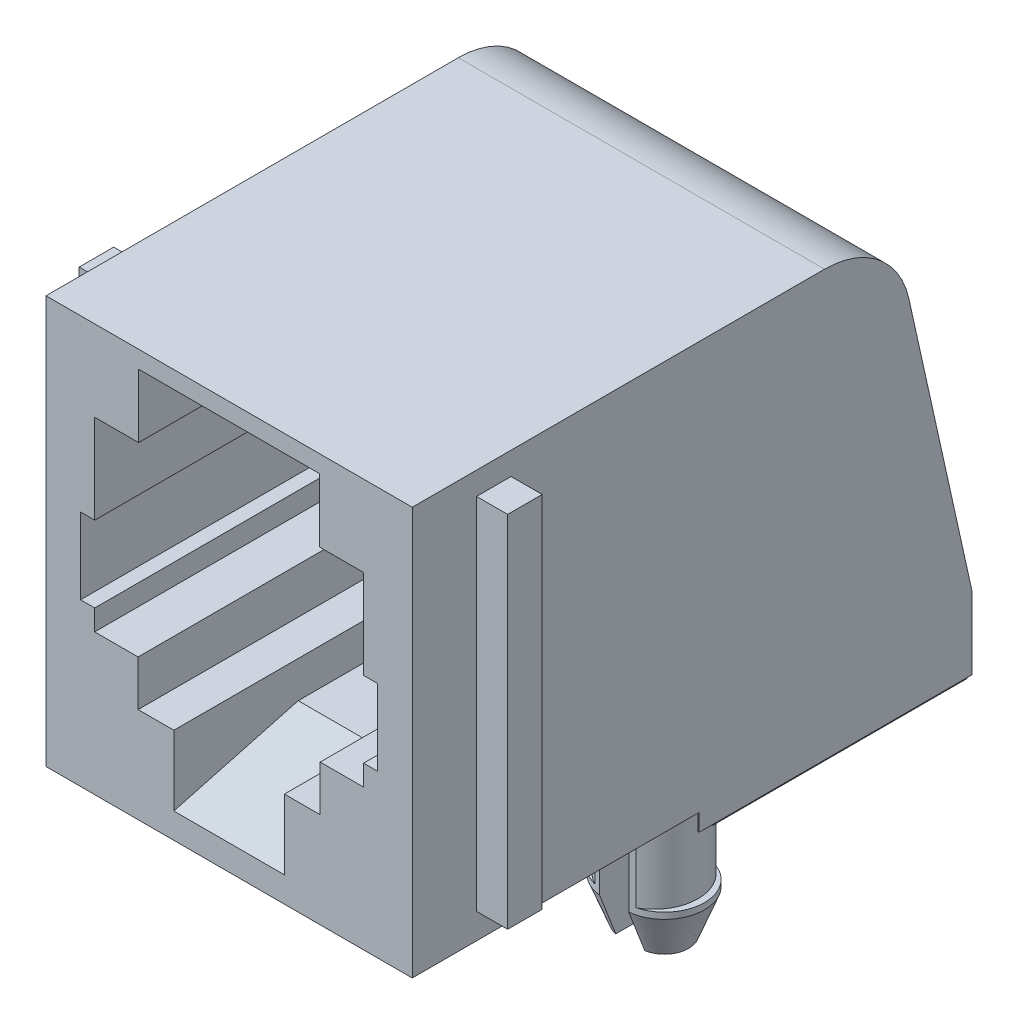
ISO-10303-21;
HEADER;
FILE_DESCRIPTION(('STEP AP214'),'2;1');
FILE_NAME('part.step','',(''),(''),'','','');
FILE_SCHEMA(('AUTOMOTIVE_DESIGN { 1 0 10303 214 1 1 1 1 }'));
ENDSEC;
DATA;
#1=APPLICATION_CONTEXT('core data for automotive mechanical design processes');
#2=APPLICATION_PROTOCOL_DEFINITION('international standard','automotive_design',2000,#1);
#3=PRODUCT_CONTEXT('',#1,'mechanical');
#4=PRODUCT('Part','Part','',(#3));
#5=PRODUCT_RELATED_PRODUCT_CATEGORY('part','',(#4));
#6=PRODUCT_DEFINITION_FORMATION('','',#4);
#7=PRODUCT_DEFINITION_CONTEXT('part definition',#1,'design');
#8=PRODUCT_DEFINITION('design','',#6,#7);
#9=PRODUCT_DEFINITION_SHAPE('','',#8);
#10=(LENGTH_UNIT() NAMED_UNIT(*) SI_UNIT(.MILLI.,.METRE.));
#11=(NAMED_UNIT(*) PLANE_ANGLE_UNIT() SI_UNIT($,.RADIAN.));
#12=(NAMED_UNIT(*) SI_UNIT($,.STERADIAN.) SOLID_ANGLE_UNIT());
#13=UNCERTAINTY_MEASURE_WITH_UNIT(LENGTH_MEASURE(1.E-05),#10,'distance_accuracy_value','');
#14=(GEOMETRIC_REPRESENTATION_CONTEXT(3) GLOBAL_UNCERTAINTY_ASSIGNED_CONTEXT((#13)) GLOBAL_UNIT_ASSIGNED_CONTEXT((#10,
#11,#12)) REPRESENTATION_CONTEXT('',''));
#15=CARTESIAN_POINT('',(0.,0.,0.));
#16=DIRECTION('',(0.,0.,1.));
#17=DIRECTION('',(1.,0.,0.));
#18=AXIS2_PLACEMENT_3D('',#15,#16,#17);
#19=CARTESIAN_POINT('',(-1.6764,-3.811,-16.891));
#20=DIRECTION('',(0.,0.,1.));
#21=DIRECTION('',(1.,0.,0.));
#22=AXIS2_PLACEMENT_3D('',#19,#20,#21);
#23=PLANE('',#22);
#24=DIRECTION('',(0.,1.,0.));
#25=VECTOR('',#24,1.);
#26=CARTESIAN_POINT('',(-1.6764,-3.811,-16.891));
#27=LINE('',#26,#25);
#28=CARTESIAN_POINT('',(-1.6764,0.380000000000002,-16.891));
#29=VERTEX_POINT('',#28);
#30=CARTESIAN_POINT('',(-1.6764,-3.811,-16.891));
#31=VERTEX_POINT('',#30);
#32=EDGE_CURVE('E1057',#29,#31,#27,.F.);
#33=ORIENTED_EDGE('',*,*,#32,.F.);
#34=DIRECTION('',(1.,0.,0.));
#35=VECTOR('',#34,1.);
#36=CARTESIAN_POINT('',(-1.6764,0.380000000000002,-16.891));
#37=LINE('',#36,#35);
#38=CARTESIAN_POINT('',(-2.1336,0.380000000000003,-16.891));
#39=VERTEX_POINT('',#38);
#40=EDGE_CURVE('E1061',#29,#39,#37,.F.);
#41=ORIENTED_EDGE('',*,*,#40,.T.);
#42=DIRECTION('',(0.,1.,0.));
#43=VECTOR('',#42,1.);
#44=CARTESIAN_POINT('',(-2.1336,-3.811,-16.891));
#45=LINE('',#44,#43);
#46=CARTESIAN_POINT('',(-2.1336,-3.811,-16.891));
#47=VERTEX_POINT('',#46);
#48=EDGE_CURVE('E1088',#47,#39,#45,.T.);
#49=ORIENTED_EDGE('',*,*,#48,.F.);
#50=DIRECTION('',(1.,0.,0.));
#51=VECTOR('',#50,1.);
#52=CARTESIAN_POINT('',(0.,-3.811,-16.891));
#53=LINE('',#52,#51);
#54=EDGE_CURVE('E1065',#31,#47,#53,.F.);
#55=ORIENTED_EDGE('',*,*,#54,.F.);
#56=EDGE_LOOP('',(#33,#41,#49,#55));
#57=FACE_BOUND('',#56,.T.);
#58=ADVANCED_FACE('F14',(#57),#23,.T.);
#59=CARTESIAN_POINT('',(0.863599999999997,-3.811,-16.891));
#60=DIRECTION('',(0.,0.,1.));
#61=DIRECTION('',(1.,0.,0.));
#62=AXIS2_PLACEMENT_3D('',#59,#60,#61);
#63=PLANE('',#62);
#64=DIRECTION('',(0.,1.,0.));
#65=VECTOR('',#64,1.);
#66=CARTESIAN_POINT('',(0.863599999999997,-3.811,-16.891));
#67=LINE('',#66,#65);
#68=CARTESIAN_POINT('',(0.863600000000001,0.380000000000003,-16.891));
#69=VERTEX_POINT('',#68);
#70=CARTESIAN_POINT('',(0.863599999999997,-3.811,-16.891));
#71=VERTEX_POINT('',#70);
#72=EDGE_CURVE('E1087',#69,#71,#67,.F.);
#73=ORIENTED_EDGE('',*,*,#72,.F.);
#74=DIRECTION('',(1.,0.,0.));
#75=VECTOR('',#74,1.);
#76=CARTESIAN_POINT('',(0.863600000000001,0.380000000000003,-16.891));
#77=LINE('',#76,#75);
#78=CARTESIAN_POINT('',(0.406399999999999,0.380000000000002,-16.891));
#79=VERTEX_POINT('',#78);
#80=EDGE_CURVE('E2414',#69,#79,#77,.F.);
#81=ORIENTED_EDGE('',*,*,#80,.T.);
#82=DIRECTION('',(0.,1.,0.));
#83=VECTOR('',#82,1.);
#84=CARTESIAN_POINT('',(0.406399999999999,-3.811,-16.891));
#85=LINE('',#84,#83);
#86=CARTESIAN_POINT('',(0.406399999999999,-3.811,-16.891));
#87=VERTEX_POINT('',#86);
#88=EDGE_CURVE('E1108',#87,#79,#85,.T.);
#89=ORIENTED_EDGE('',*,*,#88,.F.);
#90=DIRECTION('',(1.,0.,0.));
#91=VECTOR('',#90,1.);
#92=CARTESIAN_POINT('',(2.54,-3.811,-16.891));
#93=LINE('',#92,#91);
#94=EDGE_CURVE('E1098',#71,#87,#93,.F.);
#95=ORIENTED_EDGE('',*,*,#94,.F.);
#96=EDGE_LOOP('',(#73,#81,#89,#95));
#97=FACE_BOUND('',#96,.T.);
#98=ADVANCED_FACE('F1043',(#97),#63,.T.);
#99=CARTESIAN_POINT('',(-0.406400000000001,-3.811,-19.431));
#100=DIRECTION('',(0.,0.,1.));
#101=DIRECTION('',(1.,0.,0.));
#102=AXIS2_PLACEMENT_3D('',#99,#100,#101);
#103=PLANE('',#102);
#104=DIRECTION('',(0.,1.,0.));
#105=VECTOR('',#104,1.);
#106=CARTESIAN_POINT('',(-0.406400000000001,-3.811,-19.431));
#107=LINE('',#106,#105);
#108=CARTESIAN_POINT('',(-0.406400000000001,0.380000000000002,-19.431));
#109=VERTEX_POINT('',#108);
#110=CARTESIAN_POINT('',(-0.406400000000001,-3.811,-19.431));
#111=VERTEX_POINT('',#110);
#112=EDGE_CURVE('E1107',#109,#111,#107,.F.);
#113=ORIENTED_EDGE('',*,*,#112,.F.);
#114=DIRECTION('',(1.,0.,0.));
#115=VECTOR('',#114,1.);
#116=CARTESIAN_POINT('',(-0.406400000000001,0.380000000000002,-19.431));
#117=LINE('',#116,#115);
#118=CARTESIAN_POINT('',(-0.863600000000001,0.380000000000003,-19.431));
#119=VERTEX_POINT('',#118);
#120=EDGE_CURVE('E2411',#109,#119,#117,.F.);
#121=ORIENTED_EDGE('',*,*,#120,.T.);
#122=DIRECTION('',(0.,1.,0.));
#123=VECTOR('',#122,1.);
#124=CARTESIAN_POINT('',(-0.863600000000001,-3.811,-19.431));
#125=LINE('',#124,#123);
#126=CARTESIAN_POINT('',(-0.863600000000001,-3.811,-19.431));
#127=VERTEX_POINT('',#126);
#128=EDGE_CURVE('E1129',#127,#119,#125,.T.);
#129=ORIENTED_EDGE('',*,*,#128,.F.);
#130=DIRECTION('',(1.,0.,0.));
#131=VECTOR('',#130,1.);
#132=CARTESIAN_POINT('',(2.54,-3.811,-19.431));
#133=LINE('',#132,#131);
#134=EDGE_CURVE('E1119',#111,#127,#133,.F.);
#135=ORIENTED_EDGE('',*,*,#134,.F.);
#136=EDGE_LOOP('',(#113,#121,#129,#135));
#137=FACE_BOUND('',#136,.T.);
#138=ADVANCED_FACE('F1039',(#137),#103,.T.);
#139=CARTESIAN_POINT('',(2.1336,-3.811,-19.431));
#140=DIRECTION('',(0.,0.,1.));
#141=DIRECTION('',(1.,0.,0.));
#142=AXIS2_PLACEMENT_3D('',#139,#140,#141);
#143=PLANE('',#142);
#144=DIRECTION('',(0.,1.,0.));
#145=VECTOR('',#144,1.);
#146=CARTESIAN_POINT('',(2.1336,-3.811,-19.431));
#147=LINE('',#146,#145);
#148=CARTESIAN_POINT('',(2.1336,0.380000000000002,-19.431));
#149=VERTEX_POINT('',#148);
#150=CARTESIAN_POINT('',(2.1336,-3.811,-19.431));
#151=VERTEX_POINT('',#150);
#152=EDGE_CURVE('E1128',#149,#151,#147,.F.);
#153=ORIENTED_EDGE('',*,*,#152,.F.);
#154=DIRECTION('',(1.,0.,0.));
#155=VECTOR('',#154,1.);
#156=CARTESIAN_POINT('',(2.1336,0.380000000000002,-19.431));
#157=LINE('',#156,#155);
#158=CARTESIAN_POINT('',(1.6764,0.380000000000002,-19.431));
#159=VERTEX_POINT('',#158);
#160=EDGE_CURVE('E2407',#149,#159,#157,.F.);
#161=ORIENTED_EDGE('',*,*,#160,.T.);
#162=DIRECTION('',(0.,1.,0.));
#163=VECTOR('',#162,1.);
#164=CARTESIAN_POINT('',(1.6764,-3.811,-19.431));
#165=LINE('',#164,#163);
#166=CARTESIAN_POINT('',(1.6764,-3.811,-19.431));
#167=VERTEX_POINT('',#166);
#168=EDGE_CURVE('E1148',#167,#159,#165,.T.);
#169=ORIENTED_EDGE('',*,*,#168,.F.);
#170=DIRECTION('',(1.,0.,0.));
#171=VECTOR('',#170,1.);
#172=CARTESIAN_POINT('',(5.08,-3.811,-19.431));
#173=LINE('',#172,#171);
#174=EDGE_CURVE('E1140',#151,#167,#173,.F.);
#175=ORIENTED_EDGE('',*,*,#174,.F.);
#176=EDGE_LOOP('',(#153,#161,#169,#175));
#177=FACE_BOUND('',#176,.T.);
#178=ADVANCED_FACE('F1035',(#177),#143,.T.);
#179=CARTESIAN_POINT('',(-4.9403,6.1966,0.));
#180=DIRECTION('',(0.,-1.,0.));
#181=DIRECTION('',(0.,0.,-1.));
#182=AXIS2_PLACEMENT_3D('',#179,#180,#181);
#183=PLANE('',#182);
#184=DIRECTION('',(1.,0.,0.));
#185=VECTOR('',#184,1.);
#186=CARTESIAN_POINT('',(-4.9403,6.1966,-11.3284));
#187=LINE('',#186,#185);
#188=CARTESIAN_POINT('',(3.34645,6.1966,-11.3284));
#189=VERTEX_POINT('',#188);
#190=CARTESIAN_POINT('',(4.9403,6.1966,-11.3284));
#191=VERTEX_POINT('',#190);
#192=EDGE_CURVE('E2293',#189,#191,#187,.T.);
#193=ORIENTED_EDGE('',*,*,#192,.F.);
#194=DIRECTION('',(0.,0.,-1.));
#195=VECTOR('',#194,1.);
#196=CARTESIAN_POINT('',(3.34645,6.1966,0.));
#197=LINE('',#196,#195);
#198=CARTESIAN_POINT('',(3.34645,6.1966,0.));
#199=VERTEX_POINT('',#198);
#200=EDGE_CURVE('E1167',#189,#199,#197,.F.);
#201=ORIENTED_EDGE('',*,*,#200,.T.);
#202=DIRECTION('',(1.,0.,0.));
#203=VECTOR('',#202,1.);
#204=CARTESIAN_POINT('',(-4.9403,6.1966,0.));
#205=LINE('',#204,#203);
#206=CARTESIAN_POINT('',(4.9403,6.1966,0.));
#207=VERTEX_POINT('',#206);
#208=EDGE_CURVE('E2295',#207,#199,#205,.F.);
#209=ORIENTED_EDGE('',*,*,#208,.F.);
#210=DIRECTION('',(0.,0.,-1.));
#211=VECTOR('',#210,1.);
#212=CARTESIAN_POINT('',(4.9403,6.1966,0.));
#213=LINE('',#212,#211);
#214=EDGE_CURVE('E1157',#207,#191,#213,.T.);
#215=ORIENTED_EDGE('',*,*,#214,.T.);
#216=EDGE_LOOP('',(#193,#201,#209,#215));
#217=FACE_BOUND('',#216,.T.);
#218=ADVANCED_FACE('F1031',(#217),#183,.F.);
#219=CARTESIAN_POINT('',(-1.3081,8.9906,-13.97));
#220=DIRECTION('',(0.,-0.890847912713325,0.454301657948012));
#221=DIRECTION('',(0.,-0.454301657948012,-0.890847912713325));
#222=AXIS2_PLACEMENT_3D('',#219,#220,#221);
#223=PLANE('',#222);
#224=DIRECTION('',(0.,0.454301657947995,0.890847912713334));
#225=VECTOR('',#224,1.);
#226=CARTESIAN_POINT('',(-1.7399,8.9906,-13.97));
#227=LINE('',#226,#225);
#228=CARTESIAN_POINT('',(-1.7399,8.9906,-13.97));
#229=VERTEX_POINT('',#228);
#230=CARTESIAN_POINT('',(-1.7399,13.2832000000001,-5.55256703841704));
#231=VERTEX_POINT('',#230);
#232=EDGE_CURVE('E2347',#229,#231,#227,.T.);
#233=ORIENTED_EDGE('',*,*,#232,.F.);
#234=DIRECTION('',(1.,0.,0.));
#235=VECTOR('',#234,1.);
#236=CARTESIAN_POINT('',(-1.3081,8.9906,-13.97));
#237=LINE('',#236,#235);
#238=CARTESIAN_POINT('',(-1.3081,8.9906,-13.97));
#239=VERTEX_POINT('',#238);
#240=EDGE_CURVE('E2400',#229,#239,#237,.T.);
#241=ORIENTED_EDGE('',*,*,#240,.T.);
#242=DIRECTION('',(0.,0.454301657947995,0.890847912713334));
#243=VECTOR('',#242,1.);
#244=CARTESIAN_POINT('',(-1.3081,8.9906,-13.97));
#245=LINE('',#244,#243);
#246=CARTESIAN_POINT('',(-1.3081,13.2832000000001,-5.55256703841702));
#247=VERTEX_POINT('',#246);
#248=EDGE_CURVE('E1176',#239,#247,#245,.T.);
#249=ORIENTED_EDGE('',*,*,#248,.T.);
#250=DIRECTION('',(1.,0.,0.));
#251=VECTOR('',#250,1.);
#252=CARTESIAN_POINT('',(-1.3081,13.2832000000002,-5.55256703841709));
#253=LINE('',#252,#251);
#254=EDGE_CURVE('E2402',#247,#231,#253,.F.);
#255=ORIENTED_EDGE('',*,*,#254,.T.);
#256=EDGE_LOOP('',(#233,#241,#249,#255));
#257=FACE_BOUND('',#256,.T.);
#258=ADVANCED_FACE('F1027',(#257),#223,.T.);
#259=CARTESIAN_POINT('',(-0.292099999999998,8.9906,-13.97));
#260=DIRECTION('',(0.,-0.890847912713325,0.454301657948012));
#261=DIRECTION('',(0.,-0.454301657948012,-0.890847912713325));
#262=AXIS2_PLACEMENT_3D('',#259,#260,#261);
#263=PLANE('',#262);
#264=DIRECTION('',(0.,0.454301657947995,0.890847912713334));
#265=VECTOR('',#264,1.);
#266=CARTESIAN_POINT('',(-0.723899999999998,8.9906,-13.97));
#267=LINE('',#266,#265);
#268=CARTESIAN_POINT('',(-0.723899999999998,8.9906,-13.97));
#269=VERTEX_POINT('',#268);
#270=CARTESIAN_POINT('',(-0.723899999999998,13.2832000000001,-5.55256703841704));
#271=VERTEX_POINT('',#270);
#272=EDGE_CURVE('E2354',#269,#271,#267,.T.);
#273=ORIENTED_EDGE('',*,*,#272,.F.);
#274=DIRECTION('',(1.,0.,0.));
#275=VECTOR('',#274,1.);
#276=CARTESIAN_POINT('',(-0.292099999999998,8.9906,-13.97));
#277=LINE('',#276,#275);
#278=CARTESIAN_POINT('',(-0.292099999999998,8.9906,-13.97));
#279=VERTEX_POINT('',#278);
#280=EDGE_CURVE('E2395',#269,#279,#277,.T.);
#281=ORIENTED_EDGE('',*,*,#280,.T.);
#282=DIRECTION('',(0.,0.454301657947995,0.890847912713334));
#283=VECTOR('',#282,1.);
#284=CARTESIAN_POINT('',(-0.292099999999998,8.9906,-13.97));
#285=LINE('',#284,#283);
#286=CARTESIAN_POINT('',(-0.292099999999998,13.2832000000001,-5.55256703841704));
#287=VERTEX_POINT('',#286);
#288=EDGE_CURVE('E1179',#279,#287,#285,.T.);
#289=ORIENTED_EDGE('',*,*,#288,.T.);
#290=DIRECTION('',(1.,0.,0.));
#291=VECTOR('',#290,1.);
#292=CARTESIAN_POINT('',(-0.292099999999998,13.2832000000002,-5.55256703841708));
#293=LINE('',#292,#291);
#294=EDGE_CURVE('E2397',#287,#271,#293,.F.);
#295=ORIENTED_EDGE('',*,*,#294,.T.);
#296=EDGE_LOOP('',(#273,#281,#289,#295));
#297=FACE_BOUND('',#296,.T.);
#298=ADVANCED_FACE('F1023',(#297),#263,.T.);
#299=CARTESIAN_POINT('',(0.723900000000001,8.9906,-13.97));
#300=DIRECTION('',(0.,-0.890847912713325,0.454301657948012));
#301=DIRECTION('',(0.,-0.454301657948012,-0.890847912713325));
#302=AXIS2_PLACEMENT_3D('',#299,#300,#301);
#303=PLANE('',#302);
#304=DIRECTION('',(0.,0.454301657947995,0.890847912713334));
#305=VECTOR('',#304,1.);
#306=CARTESIAN_POINT('',(0.292100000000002,8.9906,-13.97));
#307=LINE('',#306,#305);
#308=CARTESIAN_POINT('',(0.292100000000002,8.9906,-13.97));
#309=VERTEX_POINT('',#308);
#310=CARTESIAN_POINT('',(0.292100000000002,13.2832000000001,-5.55256703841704));
#311=VERTEX_POINT('',#310);
#312=EDGE_CURVE('E2360',#309,#311,#307,.T.);
#313=ORIENTED_EDGE('',*,*,#312,.F.);
#314=DIRECTION('',(1.,0.,0.));
#315=VECTOR('',#314,1.);
#316=CARTESIAN_POINT('',(0.723900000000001,8.9906,-13.97));
#317=LINE('',#316,#315);
#318=CARTESIAN_POINT('',(0.723900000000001,8.9906,-13.97));
#319=VERTEX_POINT('',#318);
#320=EDGE_CURVE('E2390',#309,#319,#317,.T.);
#321=ORIENTED_EDGE('',*,*,#320,.T.);
#322=DIRECTION('',(0.,0.454301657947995,0.890847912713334));
#323=VECTOR('',#322,1.);
#324=CARTESIAN_POINT('',(0.723900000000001,8.9906,-13.97));
#325=LINE('',#324,#323);
#326=CARTESIAN_POINT('',(0.723900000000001,13.2832000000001,-5.55256703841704));
#327=VERTEX_POINT('',#326);
#328=EDGE_CURVE('E1185',#319,#327,#325,.T.);
#329=ORIENTED_EDGE('',*,*,#328,.T.);
#330=DIRECTION('',(1.,0.,0.));
#331=VECTOR('',#330,1.);
#332=CARTESIAN_POINT('',(0.723900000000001,13.2832000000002,-5.55256703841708));
#333=LINE('',#332,#331);
#334=EDGE_CURVE('E2392',#327,#311,#333,.F.);
#335=ORIENTED_EDGE('',*,*,#334,.T.);
#336=EDGE_LOOP('',(#313,#321,#329,#335));
#337=FACE_BOUND('',#336,.T.);
#338=ADVANCED_FACE('F1019',(#337),#303,.T.);
#339=CARTESIAN_POINT('',(1.7399,8.9906,-13.97));
#340=DIRECTION('',(0.,-0.890847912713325,0.454301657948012));
#341=DIRECTION('',(0.,-0.454301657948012,-0.890847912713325));
#342=AXIS2_PLACEMENT_3D('',#339,#340,#341);
#343=PLANE('',#342);
#344=DIRECTION('',(0.,0.454301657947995,0.890847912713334));
#345=VECTOR('',#344,1.);
#346=CARTESIAN_POINT('',(1.3081,8.9906,-13.97));
#347=LINE('',#346,#345);
#348=CARTESIAN_POINT('',(1.3081,8.9906,-13.97));
#349=VERTEX_POINT('',#348);
#350=CARTESIAN_POINT('',(1.3081,13.2832000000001,-5.55256703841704));
#351=VERTEX_POINT('',#350);
#352=EDGE_CURVE('E2368',#349,#351,#347,.T.);
#353=ORIENTED_EDGE('',*,*,#352,.F.);
#354=DIRECTION('',(1.,0.,0.));
#355=VECTOR('',#354,1.);
#356=CARTESIAN_POINT('',(1.7399,8.9906,-13.97));
#357=LINE('',#356,#355);
#358=CARTESIAN_POINT('',(1.7399,8.9906,-13.97));
#359=VERTEX_POINT('',#358);
#360=EDGE_CURVE('E2327',#349,#359,#357,.T.);
#361=ORIENTED_EDGE('',*,*,#360,.T.);
#362=DIRECTION('',(0.,0.454301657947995,0.890847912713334));
#363=VECTOR('',#362,1.);
#364=CARTESIAN_POINT('',(1.7399,8.9906,-13.97));
#365=LINE('',#364,#363);
#366=CARTESIAN_POINT('',(1.7399,13.2832000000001,-5.55256703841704));
#367=VERTEX_POINT('',#366);
#368=EDGE_CURVE('E1191',#359,#367,#365,.T.);
#369=ORIENTED_EDGE('',*,*,#368,.T.);
#370=DIRECTION('',(1.,0.,0.));
#371=VECTOR('',#370,1.);
#372=CARTESIAN_POINT('',(1.7399,13.2832000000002,-5.55256703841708));
#373=LINE('',#372,#371);
#374=EDGE_CURVE('E2318',#367,#351,#373,.F.);
#375=ORIENTED_EDGE('',*,*,#374,.T.);
#376=EDGE_LOOP('',(#353,#361,#369,#375));
#377=FACE_BOUND('',#376,.T.);
#378=ADVANCED_FACE('F1015',(#377),#343,.T.);
#379=CARTESIAN_POINT('',(-4.9403,6.1966,0.));
#380=DIRECTION('',(0.,-1.,0.));
#381=DIRECTION('',(0.,0.,-1.));
#382=AXIS2_PLACEMENT_3D('',#379,#380,#381);
#383=PLANE('',#382);
#384=DIRECTION('',(1.,0.,0.));
#385=VECTOR('',#384,1.);
#386=CARTESIAN_POINT('',(-4.9403,6.1966,-11.3284));
#387=LINE('',#386,#385);
#388=CARTESIAN_POINT('',(-4.9403,6.1966,-11.3284));
#389=VERTEX_POINT('',#388);
#390=CARTESIAN_POINT('',(-3.34645,6.1966,-11.3284));
#391=VERTEX_POINT('',#390);
#392=EDGE_CURVE('E2326',#389,#391,#387,.T.);
#393=ORIENTED_EDGE('',*,*,#392,.F.);
#394=DIRECTION('',(0.,0.,1.));
#395=VECTOR('',#394,1.);
#396=CARTESIAN_POINT('',(-4.9403,6.1966,0.));
#397=LINE('',#396,#395);
#398=CARTESIAN_POINT('',(-4.9403,6.1966,0.));
#399=VERTEX_POINT('',#398);
#400=EDGE_CURVE('E1164',#389,#399,#397,.T.);
#401=ORIENTED_EDGE('',*,*,#400,.T.);
#402=DIRECTION('',(1.,0.,0.));
#403=VECTOR('',#402,1.);
#404=CARTESIAN_POINT('',(-4.9403,6.1966,0.));
#405=LINE('',#404,#403);
#406=CARTESIAN_POINT('',(-3.34645,6.1966,0.));
#407=VERTEX_POINT('',#406);
#408=EDGE_CURVE('E2322',#407,#399,#405,.F.);
#409=ORIENTED_EDGE('',*,*,#408,.F.);
#410=DIRECTION('',(0.,0.,1.));
#411=VECTOR('',#410,1.);
#412=CARTESIAN_POINT('',(-3.34645,6.1966,0.));
#413=LINE('',#412,#411);
#414=EDGE_CURVE('E1200',#407,#391,#413,.F.);
#415=ORIENTED_EDGE('',*,*,#414,.T.);
#416=EDGE_LOOP('',(#393,#401,#409,#415));
#417=FACE_BOUND('',#416,.T.);
#418=ADVANCED_FACE('F1011',(#417),#383,.F.);
#419=CARTESIAN_POINT('',(-1.7399,8.508,0.));
#420=DIRECTION('',(-1.,0.,0.));
#421=DIRECTION('',(0.,0.,1.));
#422=AXIS2_PLACEMENT_3D('',#419,#420,#421);
#423=PLANE('',#422);
#424=ORIENTED_EDGE('',*,*,#232,.T.);
#425=DIRECTION('',(0.,0.,1.));
#426=VECTOR('',#425,1.);
#427=CARTESIAN_POINT('',(-1.7399,13.2832,0.));
#428=LINE('',#427,#426);
#429=CARTESIAN_POINT('',(-1.7399,13.2832,-6.33530686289));
#430=VERTEX_POINT('',#429);
#431=EDGE_CURVE('E2352',#231,#430,#428,.F.);
#432=ORIENTED_EDGE('',*,*,#431,.T.);
#433=DIRECTION('',(0.,0.454301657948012,0.890847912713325));
#434=VECTOR('',#433,1.);
#435=CARTESIAN_POINT('',(-1.7399,13.884503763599,-5.1562));
#436=LINE('',#435,#434);
#437=CARTESIAN_POINT('',(-1.7399,9.38977026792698,-13.97));
#438=VERTEX_POINT('',#437);
#439=EDGE_CURVE('E1203',#438,#430,#436,.T.);
#440=ORIENTED_EDGE('',*,*,#439,.F.);
#441=DIRECTION('',(0.,1.,0.));
#442=VECTOR('',#441,1.);
#443=CARTESIAN_POINT('',(-1.7399,8.508,-13.97));
#444=LINE('',#443,#442);
#445=EDGE_CURVE('E2344',#438,#229,#444,.F.);
#446=ORIENTED_EDGE('',*,*,#445,.T.);
#447=EDGE_LOOP('',(#424,#432,#440,#446));
#448=FACE_BOUND('',#447,.T.);
#449=ADVANCED_FACE('F1007',(#448),#423,.T.);
#450=CARTESIAN_POINT('',(-0.723899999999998,8.508,0.));
#451=DIRECTION('',(-1.,0.,0.));
#452=DIRECTION('',(0.,0.,1.));
#453=AXIS2_PLACEMENT_3D('',#450,#451,#452);
#454=PLANE('',#453);
#455=DIRECTION('',(0.,0.454301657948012,0.890847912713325));
#456=VECTOR('',#455,1.);
#457=CARTESIAN_POINT('',(-0.723899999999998,13.884503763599,-5.1562));
#458=LINE('',#457,#456);
#459=CARTESIAN_POINT('',(-0.723899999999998,9.38977026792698,-13.97));
#460=VERTEX_POINT('',#459);
#461=CARTESIAN_POINT('',(-0.723899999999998,13.2832,-6.33530686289));
#462=VERTEX_POINT('',#461);
#463=EDGE_CURVE('E1209',#460,#462,#458,.T.);
#464=ORIENTED_EDGE('',*,*,#463,.F.);
#465=DIRECTION('',(0.,1.,0.));
#466=VECTOR('',#465,1.);
#467=CARTESIAN_POINT('',(-0.723899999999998,8.508,-13.97));
#468=LINE('',#467,#466);
#469=EDGE_CURVE('E2357',#460,#269,#468,.F.);
#470=ORIENTED_EDGE('',*,*,#469,.T.);
#471=ORIENTED_EDGE('',*,*,#272,.T.);
#472=DIRECTION('',(0.,0.,1.));
#473=VECTOR('',#472,1.);
#474=CARTESIAN_POINT('',(-0.723899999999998,13.2832,0.));
#475=LINE('',#474,#473);
#476=EDGE_CURVE('E2361',#271,#462,#475,.F.);
#477=ORIENTED_EDGE('',*,*,#476,.T.);
#478=EDGE_LOOP('',(#464,#470,#471,#477));
#479=FACE_BOUND('',#478,.T.);
#480=ADVANCED_FACE('F1003',(#479),#454,.T.);
#481=CARTESIAN_POINT('',(0.292100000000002,8.508,0.));
#482=DIRECTION('',(-1.,0.,0.));
#483=DIRECTION('',(0.,0.,1.));
#484=AXIS2_PLACEMENT_3D('',#481,#482,#483);
#485=PLANE('',#484);
#486=DIRECTION('',(0.,0.454301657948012,0.890847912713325));
#487=VECTOR('',#486,1.);
#488=CARTESIAN_POINT('',(0.292100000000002,13.884503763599,-5.1562));
#489=LINE('',#488,#487);
#490=CARTESIAN_POINT('',(0.292100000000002,9.38977026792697,-13.97));
#491=VERTEX_POINT('',#490);
#492=CARTESIAN_POINT('',(0.292100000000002,13.2832,-6.33530686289));
#493=VERTEX_POINT('',#492);
#494=EDGE_CURVE('E1215',#491,#493,#489,.T.);
#495=ORIENTED_EDGE('',*,*,#494,.F.);
#496=DIRECTION('',(0.,1.,0.));
#497=VECTOR('',#496,1.);
#498=CARTESIAN_POINT('',(0.292100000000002,8.508,-13.97));
#499=LINE('',#498,#497);
#500=EDGE_CURVE('E2365',#491,#309,#499,.F.);
#501=ORIENTED_EDGE('',*,*,#500,.T.);
#502=ORIENTED_EDGE('',*,*,#312,.T.);
#503=DIRECTION('',(0.,0.,1.));
#504=VECTOR('',#503,1.);
#505=CARTESIAN_POINT('',(0.292100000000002,13.2832,0.));
#506=LINE('',#505,#504);
#507=EDGE_CURVE('E2369',#311,#493,#506,.F.);
#508=ORIENTED_EDGE('',*,*,#507,.T.);
#509=EDGE_LOOP('',(#495,#501,#502,#508));
#510=FACE_BOUND('',#509,.T.);
#511=ADVANCED_FACE('F999',(#510),#485,.T.);
#512=CARTESIAN_POINT('',(1.3081,8.508,0.));
#513=DIRECTION('',(-1.,0.,0.));
#514=DIRECTION('',(0.,0.,1.));
#515=AXIS2_PLACEMENT_3D('',#512,#513,#514);
#516=PLANE('',#515);
#517=DIRECTION('',(0.,0.454301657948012,0.890847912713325));
#518=VECTOR('',#517,1.);
#519=CARTESIAN_POINT('',(1.3081,13.884503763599,-5.1562));
#520=LINE('',#519,#518);
#521=CARTESIAN_POINT('',(1.3081,9.38977026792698,-13.97));
#522=VERTEX_POINT('',#521);
#523=CARTESIAN_POINT('',(1.3081,13.2832,-6.33530686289));
#524=VERTEX_POINT('',#523);
#525=EDGE_CURVE('E1221',#522,#524,#520,.T.);
#526=ORIENTED_EDGE('',*,*,#525,.F.);
#527=DIRECTION('',(0.,1.,0.));
#528=VECTOR('',#527,1.);
#529=CARTESIAN_POINT('',(1.3081,8.508,-13.97));
#530=LINE('',#529,#528);
#531=EDGE_CURVE('E1072',#522,#349,#530,.F.);
#532=ORIENTED_EDGE('',*,*,#531,.T.);
#533=ORIENTED_EDGE('',*,*,#352,.T.);
#534=DIRECTION('',(0.,0.,1.));
#535=VECTOR('',#534,1.);
#536=CARTESIAN_POINT('',(1.3081,13.2832,0.));
#537=LINE('',#536,#535);
#538=EDGE_CURVE('E1077',#351,#524,#537,.F.);
#539=ORIENTED_EDGE('',*,*,#538,.T.);
#540=EDGE_LOOP('',(#526,#532,#533,#539));
#541=FACE_BOUND('',#540,.T.);
#542=ADVANCED_FACE('F995',(#541),#516,.T.);
#543=CARTESIAN_POINT('',(-4.699,-3.5062,-10.541));
#544=DIRECTION('',(0.,-1.,0.));
#545=DIRECTION('',(0.,0.,-1.));
#546=AXIS2_PLACEMENT_3D('',#543,#544,#545);
#547=PLANE('',#546);
#548=DIRECTION('',(0.,0.,-1.));
#549=VECTOR('',#548,1.);
#550=CARTESIAN_POINT('',(-4.5466,-3.5062,-8.9281));
#551=LINE('',#550,#549);
#552=CARTESIAN_POINT('',(-4.5466,-3.50620000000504,-9.66516026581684));
#553=VERTEX_POINT('',#552);
#554=CARTESIAN_POINT('',(-4.5466,-3.50620000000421,-11.4168397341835));
#555=VERTEX_POINT('',#554);
#556=EDGE_CURVE('E430',#553,#555,#551,.T.);
#557=ORIENTED_EDGE('',*,*,#556,.T.);
#558=CARTESIAN_POINT('',(-4.699,-3.50620000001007,-10.541));
#559=DIRECTION('',(0.,1.,0.));
#560=DIRECTION('',(0.,0.,1.));
#561=AXIS2_PLACEMENT_3D('',#558,#559,#560);
#562=CIRCLE('',#561,0.888999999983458);
#563=EDGE_CURVE('E412',#553,#555,#562,.T.);
#564=ORIENTED_EDGE('',*,*,#563,.F.);
#565=EDGE_LOOP('',(#557,#564));
#566=FACE_BOUND('',#565,.T.);
#567=ADVANCED_FACE('F992',(#566),#547,.T.);
#568=CARTESIAN_POINT('',(-5.461,-3.5062,-10.541));
#569=DIRECTION('',(0.,-1.,0.));
#570=DIRECTION('',(0.,0.,-1.));
#571=AXIS2_PLACEMENT_3D('',#568,#569,#570);
#572=PLANE('',#571);
#573=DIRECTION('',(0.,0.,1.));
#574=VECTOR('',#573,1.);
#575=CARTESIAN_POINT('',(-5.6134,-3.5062,-8.9281));
#576=LINE('',#575,#574);
#577=CARTESIAN_POINT('',(-5.6134,-3.50620000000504,-11.416839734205));
#578=VERTEX_POINT('',#577);
#579=CARTESIAN_POINT('',(-5.6134,-3.50620000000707,-9.66516026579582));
#580=VERTEX_POINT('',#579);
#581=EDGE_CURVE('E418',#578,#580,#576,.T.);
#582=ORIENTED_EDGE('',*,*,#581,.T.);
#583=CARTESIAN_POINT('',(-5.461,-3.50620000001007,-10.541));
#584=DIRECTION('',(0.,1.,0.));
#585=DIRECTION('',(0.,0.,1.));
#586=AXIS2_PLACEMENT_3D('',#583,#584,#585);
#587=CIRCLE('',#586,0.889000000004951);
#588=EDGE_CURVE('E18',#578,#580,#587,.T.);
#589=ORIENTED_EDGE('',*,*,#588,.F.);
#590=EDGE_LOOP('',(#582,#589));
#591=FACE_BOUND('',#590,.T.);
#592=ADVANCED_FACE('F422',(#591),#572,.T.);
#593=CARTESIAN_POINT('',(5.461,-3.5062,-10.541));
#594=DIRECTION('',(0.,-1.,0.));
#595=DIRECTION('',(0.,0.,-1.));
#596=AXIS2_PLACEMENT_3D('',#593,#594,#595);
#597=PLANE('',#596);
#598=CARTESIAN_POINT('',(5.461,-3.50620000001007,-10.541));
#599=DIRECTION('',(0.,1.,0.));
#600=DIRECTION('',(0.,0.,1.));
#601=AXIS2_PLACEMENT_3D('',#598,#599,#600);
#602=CIRCLE('',#601,0.888999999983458);
#603=CARTESIAN_POINT('',(5.6134,-3.50620000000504,-9.66516026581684));
#604=VERTEX_POINT('',#603);
#605=CARTESIAN_POINT('',(5.6134,-3.50620000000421,-11.4168397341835));
#606=VERTEX_POINT('',#605);
#607=EDGE_CURVE('E1163',#604,#606,#602,.T.);
#608=ORIENTED_EDGE('',*,*,#607,.F.);
#609=DIRECTION('',(0.,0.,-1.));
#610=VECTOR('',#609,1.);
#611=CARTESIAN_POINT('',(5.6134,-3.5062,-8.9281));
#612=LINE('',#611,#610);
#613=EDGE_CURVE('E428',#604,#606,#612,.T.);
#614=ORIENTED_EDGE('',*,*,#613,.T.);
#615=EDGE_LOOP('',(#608,#614));
#616=FACE_BOUND('',#615,.T.);
#617=ADVANCED_FACE('F986',(#616),#597,.T.);
#618=CARTESIAN_POINT('',(4.699,-3.5062,-10.541));
#619=DIRECTION('',(0.,-1.,0.));
#620=DIRECTION('',(0.,0.,-1.));
#621=AXIS2_PLACEMENT_3D('',#618,#619,#620);
#622=PLANE('',#621);
#623=CARTESIAN_POINT('',(4.699,-3.50620000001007,-10.541));
#624=DIRECTION('',(0.,1.,0.));
#625=DIRECTION('',(0.,0.,1.));
#626=AXIS2_PLACEMENT_3D('',#623,#624,#625);
#627=CIRCLE('',#626,0.889000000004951);
#628=CARTESIAN_POINT('',(4.5466,-3.50620000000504,-11.416839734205));
#629=VERTEX_POINT('',#628);
#630=CARTESIAN_POINT('',(4.5466,-3.50620000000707,-9.66516026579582));
#631=VERTEX_POINT('',#630);
#632=EDGE_CURVE('E2509',#629,#631,#627,.T.);
#633=ORIENTED_EDGE('',*,*,#632,.F.);
#634=DIRECTION('',(0.,0.,1.));
#635=VECTOR('',#634,1.);
#636=CARTESIAN_POINT('',(4.5466,-3.5062,-8.9281));
#637=LINE('',#636,#635);
#638=EDGE_CURVE('E855',#629,#631,#637,.T.);
#639=ORIENTED_EDGE('',*,*,#638,.T.);
#640=EDGE_LOOP('',(#633,#639));
#641=FACE_BOUND('',#640,.T.);
#642=ADVANCED_FACE('F982',(#641),#622,.T.);
#643=CARTESIAN_POINT('',(-1.6764,-3.811,-17.2466));
#644=DIRECTION('',(1.,0.,0.));
#645=DIRECTION('',(0.,0.,-1.));
#646=AXIS2_PLACEMENT_3D('',#643,#644,#645);
#647=PLANE('',#646);
#648=DIRECTION('',(0.,1.,0.));
#649=VECTOR('',#648,1.);
#650=CARTESIAN_POINT('',(-1.6764,-3.811,-17.2466));
#651=LINE('',#650,#649);
#652=CARTESIAN_POINT('',(-1.6764,0.380000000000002,-17.2466));
#653=VERTEX_POINT('',#652);
#654=CARTESIAN_POINT('',(-1.6764,-3.811,-17.2466));
#655=VERTEX_POINT('',#654);
#656=EDGE_CURVE('E861',#653,#655,#651,.F.);
#657=ORIENTED_EDGE('',*,*,#656,.F.);
#658=DIRECTION('',(0.,0.,-1.));
#659=VECTOR('',#658,1.);
#660=CARTESIAN_POINT('',(-1.6764,0.380000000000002,-17.2466));
#661=LINE('',#660,#659);
#662=EDGE_CURVE('E1071',#653,#29,#661,.F.);
#663=ORIENTED_EDGE('',*,*,#662,.T.);
#664=ORIENTED_EDGE('',*,*,#32,.T.);
#665=DIRECTION('',(0.,0.,-1.));
#666=VECTOR('',#665,1.);
#667=CARTESIAN_POINT('',(-1.6764,-3.811,0.));
#668=LINE('',#667,#666);
#669=EDGE_CURVE('E1074',#655,#31,#668,.F.);
#670=ORIENTED_EDGE('',*,*,#669,.F.);
#671=EDGE_LOOP('',(#657,#663,#664,#670));
#672=FACE_BOUND('',#671,.T.);
#673=ADVANCED_FACE('F978',(#672),#647,.T.);
#674=CARTESIAN_POINT('',(0.,-3.811,0.));
#675=DIRECTION('',(0.,-1.,0.));
#676=DIRECTION('',(0.,0.,-1.));
#677=AXIS2_PLACEMENT_3D('',#674,#675,#676);
#678=PLANE('',#677);
#679=DIRECTION('',(0.,0.,1.));
#680=VECTOR('',#679,1.);
#681=CARTESIAN_POINT('',(-2.1336,-3.811,-16.891));
#682=LINE('',#681,#680);
#683=CARTESIAN_POINT('',(-2.1336,-3.811,-17.2466));
#684=VERTEX_POINT('',#683);
#685=EDGE_CURVE('E1082',#684,#47,#682,.T.);
#686=ORIENTED_EDGE('',*,*,#685,.F.);
#687=DIRECTION('',(-1.,0.,0.));
#688=VECTOR('',#687,1.);
#689=CARTESIAN_POINT('',(-2.1336,-3.811,-17.2466));
#690=LINE('',#689,#688);
#691=EDGE_CURVE('E1237',#655,#684,#690,.T.);
#692=ORIENTED_EDGE('',*,*,#691,.F.);
#693=ORIENTED_EDGE('',*,*,#669,.T.);
#694=ORIENTED_EDGE('',*,*,#54,.T.);
#695=EDGE_LOOP('',(#686,#692,#693,#694));
#696=FACE_BOUND('',#695,.T.);
#697=ADVANCED_FACE('F974',(#696),#678,.T.);
#698=CARTESIAN_POINT('',(-2.1336,-3.811,-16.891));
#699=DIRECTION('',(-1.,0.,0.));
#700=DIRECTION('',(0.,0.,1.));
#701=AXIS2_PLACEMENT_3D('',#698,#699,#700);
#702=PLANE('',#701);
#703=ORIENTED_EDGE('',*,*,#48,.T.);
#704=DIRECTION('',(0.,0.,1.));
#705=VECTOR('',#704,1.);
#706=CARTESIAN_POINT('',(-2.1336,0.380000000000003,-16.891));
#707=LINE('',#706,#705);
#708=CARTESIAN_POINT('',(-2.1336,0.380000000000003,-17.2466));
#709=VERTEX_POINT('',#708);
#710=EDGE_CURVE('E1084',#39,#709,#707,.F.);
#711=ORIENTED_EDGE('',*,*,#710,.T.);
#712=DIRECTION('',(0.,1.,0.));
#713=VECTOR('',#712,1.);
#714=CARTESIAN_POINT('',(-2.1336,-3.811,-17.2466));
#715=LINE('',#714,#713);
#716=EDGE_CURVE('E1233',#684,#709,#715,.T.);
#717=ORIENTED_EDGE('',*,*,#716,.F.);
#718=ORIENTED_EDGE('',*,*,#685,.T.);
#719=EDGE_LOOP('',(#703,#711,#717,#718));
#720=FACE_BOUND('',#719,.T.);
#721=ADVANCED_FACE('F970',(#720),#702,.T.);
#722=CARTESIAN_POINT('',(0.863599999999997,-3.811,-17.2466));
#723=DIRECTION('',(1.,0.,0.));
#724=DIRECTION('',(0.,0.,-1.));
#725=AXIS2_PLACEMENT_3D('',#722,#723,#724);
#726=PLANE('',#725);
#727=DIRECTION('',(0.,1.,0.));
#728=VECTOR('',#727,1.);
#729=CARTESIAN_POINT('',(0.863599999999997,-3.811,-17.2466));
#730=LINE('',#729,#728);
#731=CARTESIAN_POINT('',(0.863600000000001,0.380000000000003,-17.2466));
#732=VERTEX_POINT('',#731);
#733=CARTESIAN_POINT('',(0.863599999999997,-3.811,-17.2466));
#734=VERTEX_POINT('',#733);
#735=EDGE_CURVE('E1236',#732,#734,#730,.F.);
#736=ORIENTED_EDGE('',*,*,#735,.F.);
#737=DIRECTION('',(0.,0.,-1.));
#738=VECTOR('',#737,1.);
#739=CARTESIAN_POINT('',(0.863600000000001,0.380000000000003,-17.2466));
#740=LINE('',#739,#738);
#741=EDGE_CURVE('E1092',#732,#69,#740,.F.);
#742=ORIENTED_EDGE('',*,*,#741,.T.);
#743=ORIENTED_EDGE('',*,*,#72,.T.);
#744=DIRECTION('',(0.,0.,-1.));
#745=VECTOR('',#744,1.);
#746=CARTESIAN_POINT('',(0.863600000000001,-3.811,0.));
#747=LINE('',#746,#745);
#748=EDGE_CURVE('E1095',#734,#71,#747,.F.);
#749=ORIENTED_EDGE('',*,*,#748,.F.);
#750=EDGE_LOOP('',(#736,#742,#743,#749));
#751=FACE_BOUND('',#750,.T.);
#752=ADVANCED_FACE('F966',(#751),#726,.T.);
#753=CARTESIAN_POINT('',(2.54,-3.811,0.));
#754=DIRECTION('',(0.,-1.,0.));
#755=DIRECTION('',(0.,0.,-1.));
#756=AXIS2_PLACEMENT_3D('',#753,#754,#755);
#757=PLANE('',#756);
#758=DIRECTION('',(0.,0.,1.));
#759=VECTOR('',#758,1.);
#760=CARTESIAN_POINT('',(0.406399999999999,-3.811,-16.891));
#761=LINE('',#760,#759);
#762=CARTESIAN_POINT('',(0.406399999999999,-3.811,-17.2466));
#763=VERTEX_POINT('',#762);
#764=EDGE_CURVE('E1101',#763,#87,#761,.T.);
#765=ORIENTED_EDGE('',*,*,#764,.F.);
#766=DIRECTION('',(-1.,0.,0.));
#767=VECTOR('',#766,1.);
#768=CARTESIAN_POINT('',(0.406399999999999,-3.811,-17.2466));
#769=LINE('',#768,#767);
#770=EDGE_CURVE('E1246',#734,#763,#769,.T.);
#771=ORIENTED_EDGE('',*,*,#770,.F.);
#772=ORIENTED_EDGE('',*,*,#748,.T.);
#773=ORIENTED_EDGE('',*,*,#94,.T.);
#774=EDGE_LOOP('',(#765,#771,#772,#773));
#775=FACE_BOUND('',#774,.T.);
#776=ADVANCED_FACE('F962',(#775),#757,.T.);
#777=CARTESIAN_POINT('',(0.406399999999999,-3.811,-16.891));
#778=DIRECTION('',(-1.,0.,0.));
#779=DIRECTION('',(0.,0.,1.));
#780=AXIS2_PLACEMENT_3D('',#777,#778,#779);
#781=PLANE('',#780);
#782=ORIENTED_EDGE('',*,*,#88,.T.);
#783=DIRECTION('',(0.,0.,1.));
#784=VECTOR('',#783,1.);
#785=CARTESIAN_POINT('',(0.406399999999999,0.380000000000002,-16.891));
#786=LINE('',#785,#784);
#787=CARTESIAN_POINT('',(0.406399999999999,0.380000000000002,-17.2466));
#788=VERTEX_POINT('',#787);
#789=EDGE_CURVE('E1104',#79,#788,#786,.F.);
#790=ORIENTED_EDGE('',*,*,#789,.T.);
#791=DIRECTION('',(0.,1.,0.));
#792=VECTOR('',#791,1.);
#793=CARTESIAN_POINT('',(0.406399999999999,-3.811,-17.2466));
#794=LINE('',#793,#792);
#795=EDGE_CURVE('E1242',#763,#788,#794,.T.);
#796=ORIENTED_EDGE('',*,*,#795,.F.);
#797=ORIENTED_EDGE('',*,*,#764,.T.);
#798=EDGE_LOOP('',(#782,#790,#796,#797));
#799=FACE_BOUND('',#798,.T.);
#800=ADVANCED_FACE('F958',(#799),#781,.T.);
#801=CARTESIAN_POINT('',(-0.406400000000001,-3.811,-19.7866));
#802=DIRECTION('',(1.,0.,0.));
#803=DIRECTION('',(0.,0.,-1.));
#804=AXIS2_PLACEMENT_3D('',#801,#802,#803);
#805=PLANE('',#804);
#806=DIRECTION('',(0.,1.,0.));
#807=VECTOR('',#806,1.);
#808=CARTESIAN_POINT('',(-0.406400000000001,-3.811,-19.7866));
#809=LINE('',#808,#807);
#810=CARTESIAN_POINT('',(-0.406400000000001,0.380000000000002,-19.7866));
#811=VERTEX_POINT('',#810);
#812=CARTESIAN_POINT('',(-0.406400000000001,-3.811,-19.7866));
#813=VERTEX_POINT('',#812);
#814=EDGE_CURVE('E1245',#811,#813,#809,.F.);
#815=ORIENTED_EDGE('',*,*,#814,.F.);
#816=DIRECTION('',(0.,0.,-1.));
#817=VECTOR('',#816,1.);
#818=CARTESIAN_POINT('',(-0.406400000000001,0.380000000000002,-19.7866));
#819=LINE('',#818,#817);
#820=EDGE_CURVE('E1113',#811,#109,#819,.F.);
#821=ORIENTED_EDGE('',*,*,#820,.T.);
#822=ORIENTED_EDGE('',*,*,#112,.T.);
#823=DIRECTION('',(0.,0.,-1.));
#824=VECTOR('',#823,1.);
#825=CARTESIAN_POINT('',(-0.406399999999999,-3.811,0.));
#826=LINE('',#825,#824);
#827=EDGE_CURVE('E1116',#813,#111,#826,.F.);
#828=ORIENTED_EDGE('',*,*,#827,.F.);
#829=EDGE_LOOP('',(#815,#821,#822,#828));
#830=FACE_BOUND('',#829,.T.);
#831=ADVANCED_FACE('F954',(#830),#805,.T.);
#832=CARTESIAN_POINT('',(2.54,-3.811,0.));
#833=DIRECTION('',(0.,-1.,0.));
#834=DIRECTION('',(0.,0.,-1.));
#835=AXIS2_PLACEMENT_3D('',#832,#833,#834);
#836=PLANE('',#835);
#837=DIRECTION('',(0.,0.,1.));
#838=VECTOR('',#837,1.);
#839=CARTESIAN_POINT('',(-0.863600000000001,-3.811,-19.431));
#840=LINE('',#839,#838);
#841=CARTESIAN_POINT('',(-0.863600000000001,-3.811,-19.7866));
#842=VERTEX_POINT('',#841);
#843=EDGE_CURVE('E1122',#842,#127,#840,.T.);
#844=ORIENTED_EDGE('',*,*,#843,.F.);
#845=DIRECTION('',(-1.,0.,0.));
#846=VECTOR('',#845,1.);
#847=CARTESIAN_POINT('',(-0.863600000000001,-3.811,-19.7866));
#848=LINE('',#847,#846);
#849=EDGE_CURVE('E1255',#813,#842,#848,.T.);
#850=ORIENTED_EDGE('',*,*,#849,.F.);
#851=ORIENTED_EDGE('',*,*,#827,.T.);
#852=ORIENTED_EDGE('',*,*,#134,.T.);
#853=EDGE_LOOP('',(#844,#850,#851,#852));
#854=FACE_BOUND('',#853,.T.);
#855=ADVANCED_FACE('F950',(#854),#836,.T.);
#856=CARTESIAN_POINT('',(-0.863600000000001,-3.811,-19.431));
#857=DIRECTION('',(-1.,0.,0.));
#858=DIRECTION('',(0.,0.,1.));
#859=AXIS2_PLACEMENT_3D('',#856,#857,#858);
#860=PLANE('',#859);
#861=ORIENTED_EDGE('',*,*,#128,.T.);
#862=DIRECTION('',(0.,0.,1.));
#863=VECTOR('',#862,1.);
#864=CARTESIAN_POINT('',(-0.863600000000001,0.380000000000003,-19.431));
#865=LINE('',#864,#863);
#866=CARTESIAN_POINT('',(-0.863600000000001,0.380000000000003,-19.7866));
#867=VERTEX_POINT('',#866);
#868=EDGE_CURVE('E1125',#119,#867,#865,.F.);
#869=ORIENTED_EDGE('',*,*,#868,.T.);
#870=DIRECTION('',(0.,1.,0.));
#871=VECTOR('',#870,1.);
#872=CARTESIAN_POINT('',(-0.863600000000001,-3.811,-19.7866));
#873=LINE('',#872,#871);
#874=EDGE_CURVE('E1251',#842,#867,#873,.T.);
#875=ORIENTED_EDGE('',*,*,#874,.F.);
#876=ORIENTED_EDGE('',*,*,#843,.T.);
#877=EDGE_LOOP('',(#861,#869,#875,#876));
#878=FACE_BOUND('',#877,.T.);
#879=ADVANCED_FACE('F946',(#878),#860,.T.);
#880=CARTESIAN_POINT('',(2.1336,-3.811,-19.7866));
#881=DIRECTION('',(1.,0.,0.));
#882=DIRECTION('',(0.,0.,-1.));
#883=AXIS2_PLACEMENT_3D('',#880,#881,#882);
#884=PLANE('',#883);
#885=DIRECTION('',(0.,1.,0.));
#886=VECTOR('',#885,1.);
#887=CARTESIAN_POINT('',(2.1336,-3.811,-19.7866));
#888=LINE('',#887,#886);
#889=CARTESIAN_POINT('',(2.1336,0.380000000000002,-19.7866));
#890=VERTEX_POINT('',#889);
#891=CARTESIAN_POINT('',(2.1336,-3.811,-19.7866));
#892=VERTEX_POINT('',#891);
#893=EDGE_CURVE('E1254',#890,#892,#888,.F.);
#894=ORIENTED_EDGE('',*,*,#893,.F.);
#895=DIRECTION('',(0.,0.,-1.));
#896=VECTOR('',#895,1.);
#897=CARTESIAN_POINT('',(2.1336,0.380000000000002,-19.7866));
#898=LINE('',#897,#896);
#899=EDGE_CURVE('E1134',#890,#149,#898,.F.);
#900=ORIENTED_EDGE('',*,*,#899,.T.);
#901=ORIENTED_EDGE('',*,*,#152,.T.);
#902=DIRECTION('',(0.,0.,-1.));
#903=VECTOR('',#902,1.);
#904=CARTESIAN_POINT('',(2.1336,-3.811,0.));
#905=LINE('',#904,#903);
#906=EDGE_CURVE('E1137',#892,#151,#905,.F.);
#907=ORIENTED_EDGE('',*,*,#906,.F.);
#908=EDGE_LOOP('',(#894,#900,#901,#907));
#909=FACE_BOUND('',#908,.T.);
#910=ADVANCED_FACE('F942',(#909),#884,.T.);
#911=CARTESIAN_POINT('',(5.08,-3.811,0.));
#912=DIRECTION('',(0.,-1.,0.));
#913=DIRECTION('',(0.,0.,-1.));
#914=AXIS2_PLACEMENT_3D('',#911,#912,#913);
#915=PLANE('',#914);
#916=DIRECTION('',(0.,0.,1.));
#917=VECTOR('',#916,1.);
#918=CARTESIAN_POINT('',(1.6764,-3.811,-19.431));
#919=LINE('',#918,#917);
#920=CARTESIAN_POINT('',(1.6764,-3.811,-19.7866));
#921=VERTEX_POINT('',#920);
#922=EDGE_CURVE('E1143',#921,#167,#919,.T.);
#923=ORIENTED_EDGE('',*,*,#922,.F.);
#924=DIRECTION('',(-1.,0.,0.));
#925=VECTOR('',#924,1.);
#926=CARTESIAN_POINT('',(1.6764,-3.811,-19.7866));
#927=LINE('',#926,#925);
#928=EDGE_CURVE('E1263',#892,#921,#927,.T.);
#929=ORIENTED_EDGE('',*,*,#928,.F.);
#930=ORIENTED_EDGE('',*,*,#906,.T.);
#931=ORIENTED_EDGE('',*,*,#174,.T.);
#932=EDGE_LOOP('',(#923,#929,#930,#931));
#933=FACE_BOUND('',#932,.T.);
#934=ADVANCED_FACE('F938',(#933),#915,.T.);
#935=CARTESIAN_POINT('',(1.6764,-3.811,-19.431));
#936=DIRECTION('',(-1.,0.,0.));
#937=DIRECTION('',(0.,0.,1.));
#938=AXIS2_PLACEMENT_3D('',#935,#936,#937);
#939=PLANE('',#938);
#940=ORIENTED_EDGE('',*,*,#168,.T.);
#941=DIRECTION('',(0.,0.,1.));
#942=VECTOR('',#941,1.);
#943=CARTESIAN_POINT('',(1.6764,0.380000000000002,-19.431));
#944=LINE('',#943,#942);
#945=CARTESIAN_POINT('',(1.6764,0.380000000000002,-19.7866));
#946=VERTEX_POINT('',#945);
#947=EDGE_CURVE('E413',#159,#946,#944,.F.);
#948=ORIENTED_EDGE('',*,*,#947,.T.);
#949=DIRECTION('',(0.,1.,0.));
#950=VECTOR('',#949,1.);
#951=CARTESIAN_POINT('',(1.6764,-3.811,-19.7866));
#952=LINE('',#951,#950);
#953=EDGE_CURVE('E1260',#921,#946,#952,.T.);
#954=ORIENTED_EDGE('',*,*,#953,.F.);
#955=ORIENTED_EDGE('',*,*,#922,.T.);
#956=EDGE_LOOP('',(#940,#948,#954,#955));
#957=FACE_BOUND('',#956,.T.);
#958=ADVANCED_FACE('F934',(#957),#939,.T.);
#959=CARTESIAN_POINT('',(-5.461,-1.98430696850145,-10.541));
#960=DIRECTION('',(0.,1.,0.));
#961=DIRECTION('',(0.,0.,1.));
#962=AXIS2_PLACEMENT_3D('',#959,#960,#961);
#963=CONICAL_SURFACE('',#962,1.47319999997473,0.366519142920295);
#964=CARTESIAN_POINT('',(-5.6134,-1.98430696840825,-12.0062960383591));
#965=CARTESIAN_POINT('',(-5.6134,-2.11118999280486,-11.9573260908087));
#966=CARTESIAN_POINT('',(-5.6134,-2.23806514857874,-11.9083357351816));
#967=CARTESIAN_POINT('',(-5.6134,-2.49179083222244,-11.8102915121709));
#968=CARTESIAN_POINT('',(-5.6134,-2.61864136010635,-11.7612376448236));
#969=CARTESIAN_POINT('',(-5.6134,-2.87230909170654,-11.663043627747));
#970=CARTESIAN_POINT('',(-5.6134,-2.99912629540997,-11.6139034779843));
#971=CARTESIAN_POINT('',(-5.6134,-3.25270777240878,-11.5154866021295));
#972=CARTESIAN_POINT('',(-5.6134,-3.37947204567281,-11.4662098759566));
#973=CARTESIAN_POINT('',(-5.6134,-3.5062000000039,-11.4168397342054));
#974=B_SPLINE_CURVE_WITH_KNOTS('',3,(#964,#965,#966,#967,#968,#969,#970,#971,#972,#973),
.UNSPECIFIED.,.F.,.F.,(4,2,2,2,4),(0.,0.408014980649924,0.816029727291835,1.22404463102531,
1.63205977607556),.UNSPECIFIED.);
#975=CARTESIAN_POINT('',(-5.61339999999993,-1.98430696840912,-12.0062960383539));
#976=VERTEX_POINT('',#975);
#977=EDGE_CURVE('E411',#976,#578,#974,.T.);
#978=ORIENTED_EDGE('',*,*,#977,.T.);
#979=ORIENTED_EDGE('',*,*,#588,.T.);
#980=CARTESIAN_POINT('',(-5.6134,-3.50620000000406,-9.66516026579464));
#981=CARTESIAN_POINT('',(-5.6134,-3.30291812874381,-9.58599020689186));
#982=CARTESIAN_POINT('',(-5.6134,-3.09955548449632,-9.50702823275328));
#983=CARTESIAN_POINT('',(-5.6134,-2.692721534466,-9.34938506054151));
#984=CARTESIAN_POINT('',(-5.6134,-2.48925022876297,-9.27070386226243));
#985=CARTESIAN_POINT('',(-5.6134,-2.1852753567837,-9.15328319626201));
#986=CARTESIAN_POINT('',(-5.6134,-2.08479299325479,-9.11448880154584));
#987=CARTESIAN_POINT('',(-5.6134,-1.98430696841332,-9.07570396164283));
#988=B_SPLINE_CURVE_WITH_KNOTS('',3,(#980,#981,#982,#983,#984,#985,#986,#987),.UNSPECIFIED.,.F.,
.F.,(4,2,2,4),(0.,0.654463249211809,1.30892601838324,1.63205970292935),.UNSPECIFIED.);
#989=CARTESIAN_POINT('',(-5.61339999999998,-1.98430696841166,-9.07570396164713));
#990=VERTEX_POINT('',#989);
#991=EDGE_CURVE('E409',#580,#990,#988,.T.);
#992=ORIENTED_EDGE('',*,*,#991,.T.);
#993=CARTESIAN_POINT('',(-5.461,-1.98430696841,-10.541));
#994=DIRECTION('',(0.,-1.,0.));
#995=DIRECTION('',(0.,0.,-1.));
#996=AXIS2_PLACEMENT_3D('',#993,#994,#995);
#997=CIRCLE('',#996,1.4732);
#998=EDGE_CURVE('E853',#976,#990,#997,.F.);
#999=ORIENTED_EDGE('',*,*,#998,.F.);
#1000=EDGE_LOOP('',(#978,#979,#992,#999));
#1001=FACE_BOUND('',#1000,.T.);
#1002=ADVANCED_FACE('F407',(#1001),#963,.T.);
#1003=CARTESIAN_POINT('',(-4.699,-1.98430696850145,-10.541));
#1004=DIRECTION('',(0.,1.,0.));
#1005=DIRECTION('',(0.,0.,1.));
#1006=AXIS2_PLACEMENT_3D('',#1003,#1004,#1005);
#1007=CONICAL_SURFACE('',#1006,1.47319999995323,0.366519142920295);
#1008=CARTESIAN_POINT('',(-4.5466,-3.50619999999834,-11.4168397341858));
#1009=CARTESIAN_POINT('',(-4.5466,-3.30291812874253,-11.4960097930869));
#1010=CARTESIAN_POINT('',(-4.5466,-3.09955548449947,-11.5749717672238));
#1011=CARTESIAN_POINT('',(-4.5466,-2.692721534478,-11.7326149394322));
#1012=CARTESIAN_POINT('',(-4.5466,-2.4892502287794,-11.8112961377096));
#1013=CARTESIAN_POINT('',(-4.5466,-2.18527535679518,-11.9287168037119));
#1014=CARTESIAN_POINT('',(-4.5466,-2.0847929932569,-11.9675111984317));
#1015=CARTESIAN_POINT('',(-4.5466,-1.98430696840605,-12.0062960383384));
#1016=B_SPLINE_CURVE_WITH_KNOTS('',3,(#1008,#1009,#1010,#1011,#1012,#1013,#1014,#1015),
.UNSPECIFIED.,.F.,.F.,(4,2,2,4),(0.,0.654463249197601,1.30892601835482,1.63205970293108),.UNSPECIFIED.);
#1017=CARTESIAN_POINT('',(-4.54660000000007,-1.98430696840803,-12.0062960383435));
#1018=VERTEX_POINT('',#1017);
#1019=EDGE_CURVE('E424',#555,#1018,#1016,.T.);
#1020=ORIENTED_EDGE('',*,*,#1019,.T.);
#1021=CARTESIAN_POINT('',(-4.699,-1.98430696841,-10.541));
#1022=DIRECTION('',(0.,-1.,0.));
#1023=DIRECTION('',(0.,0.,-1.));
#1024=AXIS2_PLACEMENT_3D('',#1021,#1022,#1023);
#1025=CIRCLE('',#1024,1.4732);
#1026=CARTESIAN_POINT('',(-4.54660000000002,-1.98430696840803,-9.07570396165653));
#1027=VERTEX_POINT('',#1026);
#1028=EDGE_CURVE('E831',#1027,#1018,#1025,.F.);
#1029=ORIENTED_EDGE('',*,*,#1028,.F.);
#1030=CARTESIAN_POINT('',(-4.5466,-1.98430696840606,-9.07570396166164));
#1031=CARTESIAN_POINT('',(-4.5466,-2.1111899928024,-9.12467390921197));
#1032=CARTESIAN_POINT('',(-4.5466,-2.23806514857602,-9.17366426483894));
#1033=CARTESIAN_POINT('',(-4.5466,-2.49179083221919,-9.27170848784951));
#1034=CARTESIAN_POINT('',(-4.5466,-2.61864136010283,-9.32076235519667));
#1035=CARTESIAN_POINT('',(-4.5466,-2.87230909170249,-9.41895637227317));
#1036=CARTESIAN_POINT('',(-4.5466,-2.99912629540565,-9.46809652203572));
#1037=CARTESIAN_POINT('',(-4.5466,-3.25270777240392,-9.56651339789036));
#1038=CARTESIAN_POINT('',(-4.5466,-3.37947204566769,-9.6157901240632));
#1039=CARTESIAN_POINT('',(-4.5466,-3.5061999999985,-9.66516026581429));
#1040=B_SPLINE_CURVE_WITH_KNOTS('',3,(#1030,#1031,#1032,#1033,#1034,#1035,#1036,#1037,#1038,
#1039),.UNSPECIFIED.,.F.,.F.,(4,2,2,2,4),(0.,0.408014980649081,0.816029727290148,
1.22404463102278,1.63205977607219),.UNSPECIFIED.);
#1041=EDGE_CURVE('E433',#1027,#553,#1040,.T.);
#1042=ORIENTED_EDGE('',*,*,#1041,.T.);
#1043=ORIENTED_EDGE('',*,*,#563,.T.);
#1044=EDGE_LOOP('',(#1020,#1029,#1042,#1043));
#1045=FACE_BOUND('',#1044,.T.);
#1046=ADVANCED_FACE('F892',(#1045),#1007,.T.);
#1047=CARTESIAN_POINT('',(4.699,-1.98430696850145,-10.541));
#1048=DIRECTION('',(0.,1.,0.));
#1049=DIRECTION('',(0.,0.,1.));
#1050=AXIS2_PLACEMENT_3D('',#1047,#1048,#1049);
#1051=CONICAL_SURFACE('',#1050,1.47319999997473,0.366519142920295);
#1052=ORIENTED_EDGE('',*,*,#632,.T.);
#1053=CARTESIAN_POINT('',(4.5466,-3.50620000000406,-9.66516026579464));
#1054=CARTESIAN_POINT('',(4.5466,-3.30291812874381,-9.58599020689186));
#1055=CARTESIAN_POINT('',(4.5466,-3.09955548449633,-9.50702823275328));
#1056=CARTESIAN_POINT('',(4.5466,-2.692721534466,-9.34938506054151));
#1057=CARTESIAN_POINT('',(4.5466,-2.48925022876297,-9.27070386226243));
#1058=CARTESIAN_POINT('',(4.5466,-2.1852753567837,-9.15328319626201));
#1059=CARTESIAN_POINT('',(4.5466,-2.08479299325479,-9.11448880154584));
#1060=CARTESIAN_POINT('',(4.5466,-1.98430696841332,-9.07570396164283));
#1061=B_SPLINE_CURVE_WITH_KNOTS('',3,(#1053,#1054,#1055,#1056,#1057,#1058,#1059,#1060),
.UNSPECIFIED.,.F.,.F.,(4,2,2,4),(0.,0.654463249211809,1.30892601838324,1.63205970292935),.UNSPECIFIED.);
#1062=CARTESIAN_POINT('',(4.54660000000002,-1.98430696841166,-9.07570396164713));
#1063=VERTEX_POINT('',#1062);
#1064=EDGE_CURVE('E857',#631,#1063,#1061,.T.);
#1065=ORIENTED_EDGE('',*,*,#1064,.T.);
#1066=CARTESIAN_POINT('',(4.699,-1.98430696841,-10.541));
#1067=DIRECTION('',(0.,-1.,0.));
#1068=DIRECTION('',(0.,0.,-1.));
#1069=AXIS2_PLACEMENT_3D('',#1066,#1067,#1068);
#1070=CIRCLE('',#1069,1.4732);
#1071=CARTESIAN_POINT('',(4.54660000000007,-1.98430696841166,-12.0062960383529));
#1072=VERTEX_POINT('',#1071);
#1073=EDGE_CURVE('E805',#1072,#1063,#1070,.F.);
#1074=ORIENTED_EDGE('',*,*,#1073,.F.);
#1075=CARTESIAN_POINT('',(4.5466,-1.98430696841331,-12.0062960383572));
#1076=CARTESIAN_POINT('',(4.5466,-2.1111899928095,-11.9573260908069));
#1077=CARTESIAN_POINT('',(4.5466,-2.23806514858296,-11.90833573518));
#1078=CARTESIAN_POINT('',(4.5466,-2.49179083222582,-11.8102915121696));
#1079=CARTESIAN_POINT('',(4.5466,-2.61864136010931,-11.7612376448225));
#1080=CARTESIAN_POINT('',(4.5466,-2.87230909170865,-11.6630436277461));
#1081=CARTESIAN_POINT('',(4.5466,-2.99912629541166,-11.6139034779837));
#1082=CARTESIAN_POINT('',(4.5466,-3.25270777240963,-11.5154866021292));
#1083=CARTESIAN_POINT('',(4.5466,-3.37947204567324,-11.4662098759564));
#1084=CARTESIAN_POINT('',(4.5466,-3.5062000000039,-11.4168397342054));
#1085=B_SPLINE_CURVE_WITH_KNOTS('',3,(#1075,#1076,#1077,#1078,#1079,#1080,#1081,#1082,#1083,
#1084),.UNSPECIFIED.,.F.,.F.,(4,2,2,2,4),(0.,0.408014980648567,0.816029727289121,
1.22404463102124,1.63205977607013),.UNSPECIFIED.);
#1086=EDGE_CURVE('E858',#1072,#629,#1085,.T.);
#1087=ORIENTED_EDGE('',*,*,#1086,.T.);
#1088=EDGE_LOOP('',(#1052,#1065,#1074,#1087));
#1089=FACE_BOUND('',#1088,.T.);
#1090=ADVANCED_FACE('F887',(#1089),#1051,.T.);
#1091=CARTESIAN_POINT('',(5.461,-1.98430696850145,-10.541));
#1092=DIRECTION('',(0.,1.,0.));
#1093=DIRECTION('',(0.,0.,1.));
#1094=AXIS2_PLACEMENT_3D('',#1091,#1092,#1093);
#1095=CONICAL_SURFACE('',#1094,1.47319999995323,0.366519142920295);
#1096=ORIENTED_EDGE('',*,*,#607,.T.);
#1097=CARTESIAN_POINT('',(5.6134,-3.50619999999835,-11.4168397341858));
#1098=CARTESIAN_POINT('',(5.6134,-3.30291812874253,-11.4960097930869));
#1099=CARTESIAN_POINT('',(5.6134,-3.09955548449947,-11.5749717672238));
#1100=CARTESIAN_POINT('',(5.6134,-2.692721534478,-11.7326149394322));
#1101=CARTESIAN_POINT('',(5.6134,-2.4892502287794,-11.8112961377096));
#1102=CARTESIAN_POINT('',(5.6134,-2.18527535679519,-11.9287168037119));
#1103=CARTESIAN_POINT('',(5.6134,-2.0847929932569,-11.9675111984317));
#1104=CARTESIAN_POINT('',(5.6134,-1.98430696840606,-12.0062960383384));
#1105=B_SPLINE_CURVE_WITH_KNOTS('',3,(#1097,#1098,#1099,#1100,#1101,#1102,#1103,#1104),
.UNSPECIFIED.,.F.,.F.,(4,2,2,4),(0.,0.6544632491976,1.30892601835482,1.63205970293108),.UNSPECIFIED.);
#1106=CARTESIAN_POINT('',(5.61339999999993,-1.98430696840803,-12.0062960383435));
#1107=VERTEX_POINT('',#1106);
#1108=EDGE_CURVE('E864',#606,#1107,#1105,.T.);
#1109=ORIENTED_EDGE('',*,*,#1108,.T.);
#1110=CARTESIAN_POINT('',(5.461,-1.98430696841,-10.541));
#1111=DIRECTION('',(0.,-1.,0.));
#1112=DIRECTION('',(0.,0.,-1.));
#1113=AXIS2_PLACEMENT_3D('',#1110,#1111,#1112);
#1114=CIRCLE('',#1113,1.4732);
#1115=CARTESIAN_POINT('',(5.61339999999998,-1.98430696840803,-9.07570396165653));
#1116=VERTEX_POINT('',#1115);
#1117=EDGE_CURVE('E814',#1116,#1107,#1114,.F.);
#1118=ORIENTED_EDGE('',*,*,#1117,.F.);
#1119=CARTESIAN_POINT('',(5.6134,-1.98430696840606,-9.07570396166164));
#1120=CARTESIAN_POINT('',(5.6134,-2.1111899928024,-9.12467390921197));
#1121=CARTESIAN_POINT('',(5.6134,-2.23806514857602,-9.17366426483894));
#1122=CARTESIAN_POINT('',(5.6134,-2.49179083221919,-9.27170848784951));
#1123=CARTESIAN_POINT('',(5.6134,-2.61864136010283,-9.32076235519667));
#1124=CARTESIAN_POINT('',(5.6134,-2.87230909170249,-9.41895637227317));
#1125=CARTESIAN_POINT('',(5.6134,-2.99912629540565,-9.46809652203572));
#1126=CARTESIAN_POINT('',(5.6134,-3.25270777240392,-9.56651339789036));
#1127=CARTESIAN_POINT('',(5.6134,-3.37947204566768,-9.6157901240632));
#1128=CARTESIAN_POINT('',(5.6134,-3.50619999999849,-9.66516026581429));
#1129=B_SPLINE_CURVE_WITH_KNOTS('',3,(#1119,#1120,#1121,#1122,#1123,#1124,#1125,#1126,#1127,
#1128),.UNSPECIFIED.,.F.,.F.,(4,2,2,2,4),(0.,0.40801498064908,0.816029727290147,
1.22404463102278,1.63205977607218),.UNSPECIFIED.);
#1130=EDGE_CURVE('E420',#1116,#604,#1129,.T.);
#1131=ORIENTED_EDGE('',*,*,#1130,.T.);
#1132=EDGE_LOOP('',(#1096,#1109,#1118,#1131));
#1133=FACE_BOUND('',#1132,.T.);
#1134=ADVANCED_FACE('F891',(#1133),#1095,.T.);
#1135=CARTESIAN_POINT('',(4.9403,6.1966,0.));
#1136=DIRECTION('',(1.,0.,0.));
#1137=DIRECTION('',(0.,0.,-1.));
#1138=AXIS2_PLACEMENT_3D('',#1135,#1136,#1137);
#1139=PLANE('',#1138);
#1140=DIRECTION('',(0.,1.,0.));
#1141=VECTOR('',#1140,1.);
#1142=CARTESIAN_POINT('',(4.9403,6.1966,-11.3284));
#1143=LINE('',#1142,#1141);
#1144=CARTESIAN_POINT('',(4.9403,6.9586,-11.3284));
#1145=VERTEX_POINT('',#1144);
#1146=EDGE_CURVE('E1153',#191,#1145,#1143,.T.);
#1147=ORIENTED_EDGE('',*,*,#1146,.F.);
#1148=ORIENTED_EDGE('',*,*,#214,.F.);
#1149=DIRECTION('',(0.,1.,0.));
#1150=VECTOR('',#1149,1.);
#1151=CARTESIAN_POINT('',(4.9403,6.1966,0.));
#1152=LINE('',#1151,#1150);
#1153=CARTESIAN_POINT('',(4.9403,6.9586,0.));
#1154=VERTEX_POINT('',#1153);
#1155=EDGE_CURVE('E1160',#1154,#207,#1152,.F.);
#1156=ORIENTED_EDGE('',*,*,#1155,.F.);
#1157=DIRECTION('',(0.,0.,-1.));
#1158=VECTOR('',#1157,1.);
#1159=CARTESIAN_POINT('',(4.9403,6.9586,0.));
#1160=LINE('',#1159,#1158);
#1161=EDGE_CURVE('E1289',#1154,#1145,#1160,.T.);
#1162=ORIENTED_EDGE('',*,*,#1161,.T.);
#1163=EDGE_LOOP('',(#1147,#1148,#1156,#1162));
#1164=FACE_BOUND('',#1163,.T.);
#1165=ADVANCED_FACE('F899',(#1164),#1139,.F.);
#1166=CARTESIAN_POINT('',(-4.9403,6.95860000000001,0.));
#1167=DIRECTION('',(-1.,0.,0.));
#1168=DIRECTION('',(0.,0.,1.));
#1169=AXIS2_PLACEMENT_3D('',#1166,#1167,#1168);
#1170=PLANE('',#1169);
#1171=DIRECTION('',(0.,1.,0.));
#1172=VECTOR('',#1171,1.);
#1173=CARTESIAN_POINT('',(-4.9403,8.508,-11.3284));
#1174=LINE('',#1173,#1172);
#1175=CARTESIAN_POINT('',(-4.9403,6.95860000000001,-11.3284));
#1176=VERTEX_POINT('',#1175);
#1177=EDGE_CURVE('E1319',#1176,#389,#1174,.F.);
#1178=ORIENTED_EDGE('',*,*,#1177,.F.);
#1179=DIRECTION('',(0.,0.,-1.));
#1180=VECTOR('',#1179,1.);
#1181=CARTESIAN_POINT('',(-4.9403,6.95860000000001,0.));
#1182=LINE('',#1181,#1180);
#1183=CARTESIAN_POINT('',(-4.9403,6.9586,0.));
#1184=VERTEX_POINT('',#1183);
#1185=EDGE_CURVE('E1331',#1176,#1184,#1182,.F.);
#1186=ORIENTED_EDGE('',*,*,#1185,.T.);
#1187=DIRECTION('',(0.,1.,0.));
#1188=VECTOR('',#1187,1.);
#1189=CARTESIAN_POINT('',(-4.9403,6.95860000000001,0.));
#1190=LINE('',#1189,#1188);
#1191=EDGE_CURVE('E1156',#399,#1184,#1190,.T.);
#1192=ORIENTED_EDGE('',*,*,#1191,.F.);
#1193=ORIENTED_EDGE('',*,*,#400,.F.);
#1194=EDGE_LOOP('',(#1178,#1186,#1192,#1193));
#1195=FACE_BOUND('',#1194,.T.);
#1196=ADVANCED_FACE('F2611',(#1195),#1170,.F.);
#1197=CARTESIAN_POINT('',(3.34645,4.5202,0.));
#1198=DIRECTION('',(1.,0.,0.));
#1199=DIRECTION('',(0.,0.,-1.));
#1200=AXIS2_PLACEMENT_3D('',#1197,#1198,#1199);
#1201=PLANE('',#1200);
#1202=DIRECTION('',(0.,1.,0.));
#1203=VECTOR('',#1202,1.);
#1204=CARTESIAN_POINT('',(3.34645,8.508,-13.97));
#1205=LINE('',#1204,#1203);
#1206=CARTESIAN_POINT('',(3.34645,4.5202,-13.97));
#1207=VERTEX_POINT('',#1206);
#1208=CARTESIAN_POINT('',(3.34645,8.3556,-13.97));
#1209=VERTEX_POINT('',#1208);
#1210=EDGE_CURVE('E1380',#1207,#1209,#1205,.T.);
#1211=ORIENTED_EDGE('',*,*,#1210,.F.);
#1212=DIRECTION('',(0.,0.,-1.));
#1213=VECTOR('',#1212,1.);
#1214=CARTESIAN_POINT('',(3.34645,4.5202,0.));
#1215=LINE('',#1214,#1213);
#1216=CARTESIAN_POINT('',(3.34645,4.5202,0.));
#1217=VERTEX_POINT('',#1216);
#1218=EDGE_CURVE('E1310',#1207,#1217,#1215,.F.);
#1219=ORIENTED_EDGE('',*,*,#1218,.T.);
#1220=DIRECTION('',(0.,1.,0.));
#1221=VECTOR('',#1220,1.);
#1222=CARTESIAN_POINT('',(3.34645,4.5202,0.));
#1223=LINE('',#1222,#1221);
#1224=EDGE_CURVE('E1170',#199,#1217,#1223,.F.);
#1225=ORIENTED_EDGE('',*,*,#1224,.F.);
#1226=ORIENTED_EDGE('',*,*,#200,.F.);
#1227=DIRECTION('',(0.,1.,0.));
#1228=VECTOR('',#1227,1.);
#1229=CARTESIAN_POINT('',(3.34645,8.508,-11.3284));
#1230=LINE('',#1229,#1228);
#1231=CARTESIAN_POINT('',(3.34645,8.3556,-11.3284));
#1232=VERTEX_POINT('',#1231);
#1233=EDGE_CURVE('E1295',#1232,#189,#1230,.F.);
#1234=ORIENTED_EDGE('',*,*,#1233,.F.);
#1235=DIRECTION('',(0.,0.,-1.));
#1236=VECTOR('',#1235,1.);
#1237=CARTESIAN_POINT('',(3.34645,8.3556,0.));
#1238=LINE('',#1237,#1236);
#1239=EDGE_CURVE('E1279',#1232,#1209,#1238,.T.);
#1240=ORIENTED_EDGE('',*,*,#1239,.T.);
#1241=EDGE_LOOP('',(#1211,#1219,#1225,#1226,#1234,#1240));
#1242=FACE_BOUND('',#1241,.T.);
#1243=ADVANCED_FACE('F2608',(#1242),#1201,.F.);
#1244=CARTESIAN_POINT('',(-1.3081,8.508,0.));
#1245=DIRECTION('',(-1.,0.,0.));
#1246=DIRECTION('',(0.,0.,1.));
#1247=AXIS2_PLACEMENT_3D('',#1244,#1245,#1246);
#1248=PLANE('',#1247);
#1249=DIRECTION('',(0.,1.,0.));
#1250=VECTOR('',#1249,1.);
#1251=CARTESIAN_POINT('',(-1.3081,8.508,-13.97));
#1252=LINE('',#1251,#1250);
#1253=CARTESIAN_POINT('',(-1.3081,9.38977026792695,-13.97));
#1254=VERTEX_POINT('',#1253);
#1255=EDGE_CURVE('E1365',#1254,#239,#1252,.F.);
#1256=ORIENTED_EDGE('',*,*,#1255,.F.);
#1257=DIRECTION('',(0.,0.454301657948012,0.890847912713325));
#1258=VECTOR('',#1257,1.);
#1259=CARTESIAN_POINT('',(-1.3081,13.884503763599,-5.1562));
#1260=LINE('',#1259,#1258);
#1261=CARTESIAN_POINT('',(-1.3081,13.2832,-6.33530686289));
#1262=VERTEX_POINT('',#1261);
#1263=EDGE_CURVE('E1206',#1262,#1254,#1260,.F.);
#1264=ORIENTED_EDGE('',*,*,#1263,.F.);
#1265=DIRECTION('',(0.,0.,1.));
#1266=VECTOR('',#1265,1.);
#1267=CARTESIAN_POINT('',(-1.3081,13.2832,0.));
#1268=LINE('',#1267,#1266);
#1269=EDGE_CURVE('E1173',#247,#1262,#1268,.F.);
#1270=ORIENTED_EDGE('',*,*,#1269,.F.);
#1271=ORIENTED_EDGE('',*,*,#248,.F.);
#1272=EDGE_LOOP('',(#1256,#1264,#1270,#1271));
#1273=FACE_BOUND('',#1272,.T.);
#1274=ADVANCED_FACE('F2604',(#1273),#1248,.F.);
#1275=CARTESIAN_POINT('',(-0.292099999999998,8.508,0.));
#1276=DIRECTION('',(-1.,0.,0.));
#1277=DIRECTION('',(0.,0.,1.));
#1278=AXIS2_PLACEMENT_3D('',#1275,#1276,#1277);
#1279=PLANE('',#1278);
#1280=DIRECTION('',(0.,0.,1.));
#1281=VECTOR('',#1280,1.);
#1282=CARTESIAN_POINT('',(-0.292099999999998,13.2832,0.));
#1283=LINE('',#1282,#1281);
#1284=CARTESIAN_POINT('',(-0.292099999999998,13.2832,-6.33530686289));
#1285=VERTEX_POINT('',#1284);
#1286=EDGE_CURVE('E1182',#287,#1285,#1283,.F.);
#1287=ORIENTED_EDGE('',*,*,#1286,.F.);
#1288=ORIENTED_EDGE('',*,*,#288,.F.);
#1289=DIRECTION('',(0.,1.,0.));
#1290=VECTOR('',#1289,1.);
#1291=CARTESIAN_POINT('',(-0.292099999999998,8.508,-13.97));
#1292=LINE('',#1291,#1290);
#1293=CARTESIAN_POINT('',(-0.292099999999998,9.38977026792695,-13.97));
#1294=VERTEX_POINT('',#1293);
#1295=EDGE_CURVE('E1359',#1294,#279,#1292,.F.);
#1296=ORIENTED_EDGE('',*,*,#1295,.F.);
#1297=DIRECTION('',(0.,0.454301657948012,0.890847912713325));
#1298=VECTOR('',#1297,1.);
#1299=CARTESIAN_POINT('',(-0.292099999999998,13.884503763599,-5.1562));
#1300=LINE('',#1299,#1298);
#1301=EDGE_CURVE('E1212',#1285,#1294,#1300,.F.);
#1302=ORIENTED_EDGE('',*,*,#1301,.F.);
#1303=EDGE_LOOP('',(#1287,#1288,#1296,#1302));
#1304=FACE_BOUND('',#1303,.T.);
#1305=ADVANCED_FACE('F2600',(#1304),#1279,.F.);
#1306=CARTESIAN_POINT('',(0.723900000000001,8.508,0.));
#1307=DIRECTION('',(-1.,0.,0.));
#1308=DIRECTION('',(0.,0.,1.));
#1309=AXIS2_PLACEMENT_3D('',#1306,#1307,#1308);
#1310=PLANE('',#1309);
#1311=DIRECTION('',(0.,0.,1.));
#1312=VECTOR('',#1311,1.);
#1313=CARTESIAN_POINT('',(0.723900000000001,13.2832,0.));
#1314=LINE('',#1313,#1312);
#1315=CARTESIAN_POINT('',(0.723900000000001,13.2832,-6.33530686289));
#1316=VERTEX_POINT('',#1315);
#1317=EDGE_CURVE('E1188',#327,#1316,#1314,.F.);
#1318=ORIENTED_EDGE('',*,*,#1317,.F.);
#1319=ORIENTED_EDGE('',*,*,#328,.F.);
#1320=DIRECTION('',(0.,1.,0.));
#1321=VECTOR('',#1320,1.);
#1322=CARTESIAN_POINT('',(0.723900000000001,8.508,-13.97));
#1323=LINE('',#1322,#1321);
#1324=CARTESIAN_POINT('',(0.723900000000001,9.38977026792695,-13.97));
#1325=VERTEX_POINT('',#1324);
#1326=EDGE_CURVE('E1353',#1325,#319,#1323,.F.);
#1327=ORIENTED_EDGE('',*,*,#1326,.F.);
#1328=DIRECTION('',(0.,0.454301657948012,0.890847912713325));
#1329=VECTOR('',#1328,1.);
#1330=CARTESIAN_POINT('',(0.723900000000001,13.884503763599,-5.1562));
#1331=LINE('',#1330,#1329);
#1332=EDGE_CURVE('E1218',#1316,#1325,#1331,.F.);
#1333=ORIENTED_EDGE('',*,*,#1332,.F.);
#1334=EDGE_LOOP('',(#1318,#1319,#1327,#1333));
#1335=FACE_BOUND('',#1334,.T.);
#1336=ADVANCED_FACE('F2597',(#1335),#1310,.F.);
#1337=CARTESIAN_POINT('',(1.7399,8.508,0.));
#1338=DIRECTION('',(-1.,0.,0.));
#1339=DIRECTION('',(0.,0.,1.));
#1340=AXIS2_PLACEMENT_3D('',#1337,#1338,#1339);
#1341=PLANE('',#1340);
#1342=DIRECTION('',(0.,0.,1.));
#1343=VECTOR('',#1342,1.);
#1344=CARTESIAN_POINT('',(1.7399,13.2832,0.));
#1345=LINE('',#1344,#1343);
#1346=CARTESIAN_POINT('',(1.7399,13.2832,-6.33530686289));
#1347=VERTEX_POINT('',#1346);
#1348=EDGE_CURVE('E1194',#367,#1347,#1345,.F.);
#1349=ORIENTED_EDGE('',*,*,#1348,.F.);
#1350=ORIENTED_EDGE('',*,*,#368,.F.);
#1351=DIRECTION('',(0.,1.,0.));
#1352=VECTOR('',#1351,1.);
#1353=CARTESIAN_POINT('',(1.7399,8.508,-13.97));
#1354=LINE('',#1353,#1352);
#1355=CARTESIAN_POINT('',(1.7399,9.38977026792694,-13.97));
#1356=VERTEX_POINT('',#1355);
#1357=EDGE_CURVE('E1346',#1356,#359,#1354,.F.);
#1358=ORIENTED_EDGE('',*,*,#1357,.F.);
#1359=DIRECTION('',(0.,0.454301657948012,0.890847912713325));
#1360=VECTOR('',#1359,1.);
#1361=CARTESIAN_POINT('',(1.7399,13.884503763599,-5.1562));
#1362=LINE('',#1361,#1360);
#1363=EDGE_CURVE('E1224',#1347,#1356,#1362,.F.);
#1364=ORIENTED_EDGE('',*,*,#1363,.F.);
#1365=EDGE_LOOP('',(#1349,#1350,#1358,#1364));
#1366=FACE_BOUND('',#1365,.T.);
#1367=ADVANCED_FACE('F2389',(#1366),#1341,.F.);
#1368=CARTESIAN_POINT('',(-3.34645,8.3556,0.));
#1369=DIRECTION('',(-1.,0.,0.));
#1370=DIRECTION('',(0.,0.,1.));
#1371=AXIS2_PLACEMENT_3D('',#1368,#1369,#1370);
#1372=PLANE('',#1371);
#1373=DIRECTION('',(0.,1.,0.));
#1374=VECTOR('',#1373,1.);
#1375=CARTESIAN_POINT('',(-3.34645,8.3556,0.));
#1376=LINE('',#1375,#1374);
#1377=CARTESIAN_POINT('',(-3.34645,4.5202,0.));
#1378=VERTEX_POINT('',#1377);
#1379=EDGE_CURVE('E1197',#1378,#407,#1376,.T.);
#1380=ORIENTED_EDGE('',*,*,#1379,.F.);
#1381=DIRECTION('',(0.,0.,-1.));
#1382=VECTOR('',#1381,1.);
#1383=CARTESIAN_POINT('',(-3.34645,4.5202,0.));
#1384=LINE('',#1383,#1382);
#1385=CARTESIAN_POINT('',(-3.34645,4.5202,-13.97));
#1386=VERTEX_POINT('',#1385);
#1387=EDGE_CURVE('E1316',#1378,#1386,#1384,.T.);
#1388=ORIENTED_EDGE('',*,*,#1387,.T.);
#1389=DIRECTION('',(0.,1.,0.));
#1390=VECTOR('',#1389,1.);
#1391=CARTESIAN_POINT('',(-3.34645,8.508,-13.97));
#1392=LINE('',#1391,#1390);
#1393=CARTESIAN_POINT('',(-3.34645,8.3556,-13.97));
#1394=VERTEX_POINT('',#1393);
#1395=EDGE_CURVE('E1343',#1394,#1386,#1392,.F.);
#1396=ORIENTED_EDGE('',*,*,#1395,.F.);
#1397=DIRECTION('',(0.,0.,-1.));
#1398=VECTOR('',#1397,1.);
#1399=CARTESIAN_POINT('',(-3.34645,8.3556,0.));
#1400=LINE('',#1399,#1398);
#1401=CARTESIAN_POINT('',(-3.34645,8.3556,-11.3284));
#1402=VERTEX_POINT('',#1401);
#1403=EDGE_CURVE('E1394',#1394,#1402,#1400,.F.);
#1404=ORIENTED_EDGE('',*,*,#1403,.T.);
#1405=DIRECTION('',(0.,1.,0.));
#1406=VECTOR('',#1405,1.);
#1407=CARTESIAN_POINT('',(-3.34645,8.508,-11.3284));
#1408=LINE('',#1407,#1406);
#1409=EDGE_CURVE('E1326',#391,#1402,#1408,.T.);
#1410=ORIENTED_EDGE('',*,*,#1409,.F.);
#1411=ORIENTED_EDGE('',*,*,#414,.F.);
#1412=EDGE_LOOP('',(#1380,#1388,#1396,#1404,#1410,#1411));
#1413=FACE_BOUND('',#1412,.T.);
#1414=ADVANCED_FACE('F2330',(#1413),#1372,.F.);
#1415=CARTESIAN_POINT('',(-1.3081,13.884503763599,-5.1562));
#1416=DIRECTION('',(0.,0.890847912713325,-0.454301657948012));
#1417=DIRECTION('',(0.,0.454301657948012,0.890847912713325));
#1418=AXIS2_PLACEMENT_3D('',#1415,#1416,#1417);
#1419=PLANE('',#1418);
#1420=ORIENTED_EDGE('',*,*,#1263,.T.);
#1421=DIRECTION('',(1.,0.,0.));
#1422=VECTOR('',#1421,1.);
#1423=CARTESIAN_POINT('',(6.731,9.389770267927,-13.97));
#1424=LINE('',#1423,#1422);
#1425=EDGE_CURVE('E1368',#438,#1254,#1424,.T.);
#1426=ORIENTED_EDGE('',*,*,#1425,.F.);
#1427=ORIENTED_EDGE('',*,*,#439,.T.);
#1428=DIRECTION('',(1.,0.,0.));
#1429=VECTOR('',#1428,1.);
#1430=CARTESIAN_POINT('',(3.3274,13.2832,-6.33530686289));
#1431=LINE('',#1430,#1429);
#1432=EDGE_CURVE('E1413',#430,#1262,#1431,.T.);
#1433=ORIENTED_EDGE('',*,*,#1432,.T.);
#1434=EDGE_LOOP('',(#1420,#1426,#1427,#1433));
#1435=FACE_BOUND('',#1434,.T.);
#1436=ADVANCED_FACE('F2588',(#1435),#1419,.T.);
#1437=CARTESIAN_POINT('',(-0.292099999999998,13.884503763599,-5.1562));
#1438=DIRECTION('',(0.,0.890847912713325,-0.454301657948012));
#1439=DIRECTION('',(0.,0.454301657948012,0.890847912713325));
#1440=AXIS2_PLACEMENT_3D('',#1437,#1438,#1439);
#1441=PLANE('',#1440);
#1442=ORIENTED_EDGE('',*,*,#1301,.T.);
#1443=DIRECTION('',(1.,0.,0.));
#1444=VECTOR('',#1443,1.);
#1445=CARTESIAN_POINT('',(6.731,9.389770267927,-13.97));
#1446=LINE('',#1445,#1444);
#1447=EDGE_CURVE('E1362',#460,#1294,#1446,.T.);
#1448=ORIENTED_EDGE('',*,*,#1447,.F.);
#1449=ORIENTED_EDGE('',*,*,#463,.T.);
#1450=DIRECTION('',(1.,0.,0.));
#1451=VECTOR('',#1450,1.);
#1452=CARTESIAN_POINT('',(3.3274,13.2832,-6.33530686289));
#1453=LINE('',#1452,#1451);
#1454=EDGE_CURVE('E1410',#462,#1285,#1453,.T.);
#1455=ORIENTED_EDGE('',*,*,#1454,.T.);
#1456=EDGE_LOOP('',(#1442,#1448,#1449,#1455));
#1457=FACE_BOUND('',#1456,.T.);
#1458=ADVANCED_FACE('F2584',(#1457),#1441,.T.);
#1459=CARTESIAN_POINT('',(0.723900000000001,13.884503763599,-5.1562));
#1460=DIRECTION('',(0.,0.890847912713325,-0.454301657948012));
#1461=DIRECTION('',(0.,0.454301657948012,0.890847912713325));
#1462=AXIS2_PLACEMENT_3D('',#1459,#1460,#1461);
#1463=PLANE('',#1462);
#1464=ORIENTED_EDGE('',*,*,#1332,.T.);
#1465=DIRECTION('',(1.,0.,0.));
#1466=VECTOR('',#1465,1.);
#1467=CARTESIAN_POINT('',(6.731,9.389770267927,-13.97));
#1468=LINE('',#1467,#1466);
#1469=EDGE_CURVE('E1356',#491,#1325,#1468,.T.);
#1470=ORIENTED_EDGE('',*,*,#1469,.F.);
#1471=ORIENTED_EDGE('',*,*,#494,.T.);
#1472=DIRECTION('',(1.,0.,0.));
#1473=VECTOR('',#1472,1.);
#1474=CARTESIAN_POINT('',(3.3274,13.2832,-6.33530686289));
#1475=LINE('',#1474,#1473);
#1476=EDGE_CURVE('E1407',#493,#1316,#1475,.T.);
#1477=ORIENTED_EDGE('',*,*,#1476,.T.);
#1478=EDGE_LOOP('',(#1464,#1470,#1471,#1477));
#1479=FACE_BOUND('',#1478,.T.);
#1480=ADVANCED_FACE('F2581',(#1479),#1463,.T.);
#1481=CARTESIAN_POINT('',(1.7399,13.884503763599,-5.1562));
#1482=DIRECTION('',(0.,0.890847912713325,-0.454301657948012));
#1483=DIRECTION('',(0.,0.454301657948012,0.890847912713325));
#1484=AXIS2_PLACEMENT_3D('',#1481,#1482,#1483);
#1485=PLANE('',#1484);
#1486=ORIENTED_EDGE('',*,*,#1363,.T.);
#1487=DIRECTION('',(1.,0.,0.));
#1488=VECTOR('',#1487,1.);
#1489=CARTESIAN_POINT('',(6.731,9.389770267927,-13.97));
#1490=LINE('',#1489,#1488);
#1491=EDGE_CURVE('E1350',#522,#1356,#1490,.T.);
#1492=ORIENTED_EDGE('',*,*,#1491,.F.);
#1493=ORIENTED_EDGE('',*,*,#525,.T.);
#1494=DIRECTION('',(1.,0.,0.));
#1495=VECTOR('',#1494,1.);
#1496=CARTESIAN_POINT('',(3.3274,13.2832,-6.33530686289));
#1497=LINE('',#1496,#1495);
#1498=EDGE_CURVE('E1403',#524,#1347,#1497,.T.);
#1499=ORIENTED_EDGE('',*,*,#1498,.T.);
#1500=EDGE_LOOP('',(#1486,#1492,#1493,#1499));
#1501=FACE_BOUND('',#1500,.T.);
#1502=ADVANCED_FACE('F2382',(#1501),#1485,.T.);
#1503=CARTESIAN_POINT('',(-7.874,8.508,0.));
#1504=DIRECTION('',(1.,0.,0.));
#1505=DIRECTION('',(0.,0.,-1.));
#1506=AXIS2_PLACEMENT_3D('',#1503,#1504,#1505);
#1507=PLANE('',#1506);
#1508=DIRECTION('',(0.,1.,0.));
#1509=VECTOR('',#1508,1.);
#1510=CARTESIAN_POINT('',(-7.874,1.9548,-3.6322));
#1511=LINE('',#1510,#1509);
#1512=CARTESIAN_POINT('',(-7.874,1.9548,-3.6322));
#1513=VERTEX_POINT('',#1512);
#1514=CARTESIAN_POINT('',(-7.874,15.1628,-3.6322));
#1515=VERTEX_POINT('',#1514);
#1516=EDGE_CURVE('E1429',#1513,#1515,#1511,.T.);
#1517=ORIENTED_EDGE('',*,*,#1516,.F.);
#1518=DIRECTION('',(0.,0.,-1.));
#1519=VECTOR('',#1518,1.);
#1520=CARTESIAN_POINT('',(-7.874,1.9548,-2.3622));
#1521=LINE('',#1520,#1519);
#1522=CARTESIAN_POINT('',(-7.874,1.9548,-2.3622));
#1523=VERTEX_POINT('',#1522);
#1524=EDGE_CURVE('E1426',#1523,#1513,#1521,.T.);
#1525=ORIENTED_EDGE('',*,*,#1524,.F.);
#1526=DIRECTION('',(0.,1.,0.));
#1527=VECTOR('',#1526,1.);
#1528=CARTESIAN_POINT('',(-7.874,15.1628,-2.3622));
#1529=LINE('',#1528,#1527);
#1530=CARTESIAN_POINT('',(-7.874,15.1628,-2.3622));
#1531=VERTEX_POINT('',#1530);
#1532=EDGE_CURVE('E1439',#1531,#1523,#1529,.F.);
#1533=ORIENTED_EDGE('',*,*,#1532,.F.);
#1534=DIRECTION('',(0.,0.,1.));
#1535=VECTOR('',#1534,1.);
#1536=CARTESIAN_POINT('',(-7.874,15.1628,-3.6322));
#1537=LINE('',#1536,#1535);
#1538=EDGE_CURVE('E1436',#1515,#1531,#1537,.T.);
#1539=ORIENTED_EDGE('',*,*,#1538,.F.);
#1540=EDGE_LOOP('',(#1517,#1525,#1533,#1539));
#1541=FACE_BOUND('',#1540,.T.);
#1542=ADVANCED_FACE('F2571',(#1541),#1507,.F.);
#1543=CARTESIAN_POINT('',(0.,8.508,-14.097));
#1544=DIRECTION('',(0.,0.,1.));
#1545=DIRECTION('',(1.,0.,0.));
#1546=AXIS2_PLACEMENT_3D('',#1543,#1544,#1545);
#1547=PLANE('',#1546);
#1548=CARTESIAN_POINT('',(0.,0.761000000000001,-14.097));
#1549=DIRECTION('',(0.,0.,1.));
#1550=DIRECTION('',(1.,0.,0.));
#1551=AXIS2_PLACEMENT_3D('',#1548,#1549,#1550);
#1552=CIRCLE('',#1551,0.762);
#1553=CARTESIAN_POINT('',(-0.635000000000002,0.339788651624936,-14.097));
#1554=VERTEX_POINT('',#1553);
#1555=CARTESIAN_POINT('',(0.634999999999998,0.339788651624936,-14.097));
#1556=VERTEX_POINT('',#1555);
#1557=EDGE_CURVE('E785',#1554,#1556,#1552,.T.);
#1558=ORIENTED_EDGE('',*,*,#1557,.F.);
#1559=DIRECTION('',(0.,1.,0.));
#1560=VECTOR('',#1559,1.);
#1561=CARTESIAN_POINT('',(-0.634999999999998,8.508,-14.097));
#1562=LINE('',#1561,#1560);
#1563=CARTESIAN_POINT('',(-0.635000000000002,0.380000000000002,-14.097));
#1564=VERTEX_POINT('',#1563);
#1565=EDGE_CURVE('E1227',#1564,#1554,#1562,.F.);
#1566=ORIENTED_EDGE('',*,*,#1565,.F.);
#1567=DIRECTION('',(1.,0.,0.));
#1568=VECTOR('',#1567,1.);
#1569=CARTESIAN_POINT('',(6.731,0.38,-14.097));
#1570=LINE('',#1569,#1568);
#1571=CARTESIAN_POINT('',(0.635,0.380000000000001,-14.097));
#1572=VERTEX_POINT('',#1571);
#1573=EDGE_CURVE('E769',#1572,#1564,#1570,.F.);
#1574=ORIENTED_EDGE('',*,*,#1573,.F.);
#1575=DIRECTION('',(0.,1.,0.));
#1576=VECTOR('',#1575,1.);
#1577=CARTESIAN_POINT('',(0.635000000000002,8.508,-14.097));
#1578=LINE('',#1577,#1576);
#1579=EDGE_CURVE('E1230',#1556,#1572,#1578,.T.);
#1580=ORIENTED_EDGE('',*,*,#1579,.F.);
#1581=EDGE_LOOP('',(#1558,#1566,#1574,#1580));
#1582=FACE_BOUND('',#1581,.T.);
#1583=ADVANCED_FACE('F2562',(#1582),#1547,.F.);
#1584=CARTESIAN_POINT('',(-4.5466,0.380000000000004,-8.9281));
#1585=DIRECTION('',(1.,0.,0.));
#1586=DIRECTION('',(0.,0.,-1.));
#1587=AXIS2_PLACEMENT_3D('',#1584,#1585,#1586);
#1588=PLANE('',#1587);
#1589=ORIENTED_EDGE('',*,*,#1019,.F.);
#1590=ORIENTED_EDGE('',*,*,#556,.F.);
#1591=ORIENTED_EDGE('',*,*,#1041,.F.);
#1592=DIRECTION('',(0.,-1.,0.));
#1593=VECTOR('',#1592,1.);
#1594=CARTESIAN_POINT('',(-4.54660000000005,-1.66597,-9.07570396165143));
#1595=LINE('',#1594,#1593);
#1596=CARTESIAN_POINT('',(-4.54660000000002,0.380000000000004,-9.07570396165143));
#1597=VERTEX_POINT('',#1596);
#1598=EDGE_CURVE('E828',#1597,#1027,#1595,.T.);
#1599=ORIENTED_EDGE('',*,*,#1598,.F.);
#1600=DIRECTION('',(0.,0.,-1.));
#1601=VECTOR('',#1600,1.);
#1602=CARTESIAN_POINT('',(-4.5466,0.380000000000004,0.));
#1603=LINE('',#1602,#1601);
#1604=CARTESIAN_POINT('',(-4.5466,0.380000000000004,-12.0142));
#1605=VERTEX_POINT('',#1604);
#1606=EDGE_CURVE('E1480',#1605,#1597,#1603,.F.);
#1607=ORIENTED_EDGE('',*,*,#1606,.F.);
#1608=DIRECTION('',(0.,1.,0.));
#1609=VECTOR('',#1608,1.);
#1610=CARTESIAN_POINT('',(-4.5466,0.380000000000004,-12.0142));
#1611=LINE('',#1610,#1609);
#1612=CARTESIAN_POINT('',(-4.5466,-1.75359999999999,-12.0142));
#1613=VERTEX_POINT('',#1612);
#1614=EDGE_CURVE('E786',#1605,#1613,#1611,.F.);
#1615=ORIENTED_EDGE('',*,*,#1614,.T.);
#1616=DIRECTION('',(0.,0.,-1.));
#1617=VECTOR('',#1616,1.);
#1618=CARTESIAN_POINT('',(-4.5466,-1.7536,0.));
#1619=LINE('',#1618,#1617);
#1620=CARTESIAN_POINT('',(-4.54660000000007,-1.75359999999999,-12.0062960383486));
#1621=VERTEX_POINT('',#1620);
#1622=EDGE_CURVE('E835',#1621,#1613,#1619,.T.);
#1623=ORIENTED_EDGE('',*,*,#1622,.F.);
#1624=DIRECTION('',(0.,-1.,0.));
#1625=VECTOR('',#1624,1.);
#1626=CARTESIAN_POINT('',(-4.54660000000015,-1.66597,-12.0062960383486));
#1627=LINE('',#1626,#1625);
#1628=EDGE_CURVE('E799',#1018,#1621,#1627,.F.);
#1629=ORIENTED_EDGE('',*,*,#1628,.F.);
#1630=EDGE_LOOP('',(#1589,#1590,#1591,#1599,#1607,#1615,#1623,#1629));
#1631=FACE_BOUND('',#1630,.T.);
#1632=ADVANCED_FACE('F919',(#1631),#1588,.F.);
#1633=CARTESIAN_POINT('',(-5.6134,-3.5062,-8.9281));
#1634=DIRECTION('',(-1.,0.,0.));
#1635=DIRECTION('',(0.,0.,1.));
#1636=AXIS2_PLACEMENT_3D('',#1633,#1634,#1635);
#1637=PLANE('',#1636);
#1638=DIRECTION('',(0.,0.,-1.));
#1639=VECTOR('',#1638,1.);
#1640=CARTESIAN_POINT('',(-5.6134,0.380000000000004,0.));
#1641=LINE('',#1640,#1639);
#1642=CARTESIAN_POINT('',(-5.61339999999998,0.380000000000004,-9.07570396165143));
#1643=VERTEX_POINT('',#1642);
#1644=CARTESIAN_POINT('',(-5.6134,0.380000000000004,-12.0142));
#1645=VERTEX_POINT('',#1644);
#1646=EDGE_CURVE('E1477',#1643,#1645,#1641,.T.);
#1647=ORIENTED_EDGE('',*,*,#1646,.F.);
#1648=DIRECTION('',(0.,-1.,0.));
#1649=VECTOR('',#1648,1.);
#1650=CARTESIAN_POINT('',(-5.61339999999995,-1.66597,-9.07570396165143));
#1651=LINE('',#1650,#1649);
#1652=EDGE_CURVE('E419',#990,#1643,#1651,.F.);
#1653=ORIENTED_EDGE('',*,*,#1652,.F.);
#1654=ORIENTED_EDGE('',*,*,#991,.F.);
#1655=ORIENTED_EDGE('',*,*,#581,.F.);
#1656=ORIENTED_EDGE('',*,*,#977,.F.);
#1657=DIRECTION('',(0.,-1.,0.));
#1658=VECTOR('',#1657,1.);
#1659=CARTESIAN_POINT('',(-5.61339999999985,-1.66597,-12.0062960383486));
#1660=LINE('',#1659,#1658);
#1661=CARTESIAN_POINT('',(-5.61339999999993,-1.75359999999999,-12.0062960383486));
#1662=VERTEX_POINT('',#1661);
#1663=EDGE_CURVE('E850',#1662,#976,#1660,.T.);
#1664=ORIENTED_EDGE('',*,*,#1663,.F.);
#1665=DIRECTION('',(0.,0.,-1.));
#1666=VECTOR('',#1665,1.);
#1667=CARTESIAN_POINT('',(-5.6134,-1.75359999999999,0.));
#1668=LINE('',#1667,#1666);
#1669=CARTESIAN_POINT('',(-5.6134,-1.75359999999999,-12.0142));
#1670=VERTEX_POINT('',#1669);
#1671=EDGE_CURVE('E825',#1670,#1662,#1668,.F.);
#1672=ORIENTED_EDGE('',*,*,#1671,.F.);
#1673=DIRECTION('',(0.,1.,0.));
#1674=VECTOR('',#1673,1.);
#1675=CARTESIAN_POINT('',(-5.6134,0.380000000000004,-12.0142));
#1676=LINE('',#1675,#1674);
#1677=EDGE_CURVE('E800',#1670,#1645,#1676,.T.);
#1678=ORIENTED_EDGE('',*,*,#1677,.T.);
#1679=EDGE_LOOP('',(#1647,#1653,#1654,#1655,#1656,#1664,#1672,#1678));
#1680=FACE_BOUND('',#1679,.T.);
#1681=ADVANCED_FACE('F417',(#1680),#1637,.F.);
#1682=CARTESIAN_POINT('',(5.6134,0.380000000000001,-8.9281));
#1683=DIRECTION('',(1.,0.,0.));
#1684=DIRECTION('',(0.,0.,-1.));
#1685=AXIS2_PLACEMENT_3D('',#1682,#1683,#1684);
#1686=PLANE('',#1685);
#1687=ORIENTED_EDGE('',*,*,#1108,.F.);
#1688=ORIENTED_EDGE('',*,*,#613,.F.);
#1689=ORIENTED_EDGE('',*,*,#1130,.F.);
#1690=DIRECTION('',(0.,-1.,0.));
#1691=VECTOR('',#1690,1.);
#1692=CARTESIAN_POINT('',(5.61339999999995,1.015,-9.07570396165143));
#1693=LINE('',#1692,#1691);
#1694=CARTESIAN_POINT('',(5.61339999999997,0.380000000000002,-9.07570396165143));
#1695=VERTEX_POINT('',#1694);
#1696=EDGE_CURVE('E811',#1695,#1116,#1693,.T.);
#1697=ORIENTED_EDGE('',*,*,#1696,.F.);
#1698=DIRECTION('',(0.,0.,-1.));
#1699=VECTOR('',#1698,1.);
#1700=CARTESIAN_POINT('',(5.6134,0.38,0.));
#1701=LINE('',#1700,#1699);
#1702=CARTESIAN_POINT('',(5.6134,0.380000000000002,-12.0142));
#1703=VERTEX_POINT('',#1702);
#1704=EDGE_CURVE('E1466',#1703,#1695,#1701,.F.);
#1705=ORIENTED_EDGE('',*,*,#1704,.F.);
#1706=DIRECTION('',(0.,1.,0.));
#1707=VECTOR('',#1706,1.);
#1708=CARTESIAN_POINT('',(5.6134,0.380000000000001,-12.0142));
#1709=LINE('',#1708,#1707);
#1710=CARTESIAN_POINT('',(5.6134,-1.7536,-12.0142));
#1711=VERTEX_POINT('',#1710);
#1712=EDGE_CURVE('E816',#1703,#1711,#1709,.F.);
#1713=ORIENTED_EDGE('',*,*,#1712,.T.);
#1714=DIRECTION('',(0.,0.,-1.));
#1715=VECTOR('',#1714,1.);
#1716=CARTESIAN_POINT('',(5.6134,-1.7536,0.));
#1717=LINE('',#1716,#1715);
#1718=CARTESIAN_POINT('',(5.61339999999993,-1.7536,-12.0062960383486));
#1719=VERTEX_POINT('',#1718);
#1720=EDGE_CURVE('E1276',#1719,#1711,#1717,.T.);
#1721=ORIENTED_EDGE('',*,*,#1720,.F.);
#1722=DIRECTION('',(0.,-1.,0.));
#1723=VECTOR('',#1722,1.);
#1724=CARTESIAN_POINT('',(5.61339999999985,1.015,-12.0062960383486));
#1725=LINE('',#1724,#1723);
#1726=EDGE_CURVE('E818',#1107,#1719,#1725,.F.);
#1727=ORIENTED_EDGE('',*,*,#1726,.F.);
#1728=EDGE_LOOP('',(#1687,#1688,#1689,#1697,#1705,#1713,#1721,#1727));
#1729=FACE_BOUND('',#1728,.T.);
#1730=ADVANCED_FACE('F911',(#1729),#1686,.F.);
#1731=CARTESIAN_POINT('',(4.5466,-3.5062,-8.9281));
#1732=DIRECTION('',(-1.,0.,0.));
#1733=DIRECTION('',(0.,0.,1.));
#1734=AXIS2_PLACEMENT_3D('',#1731,#1732,#1733);
#1735=PLANE('',#1734);
#1736=DIRECTION('',(0.,0.,-1.));
#1737=VECTOR('',#1736,1.);
#1738=CARTESIAN_POINT('',(4.5466,0.380000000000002,0.));
#1739=LINE('',#1738,#1737);
#1740=CARTESIAN_POINT('',(4.54660000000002,0.380000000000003,-9.07570396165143));
#1741=VERTEX_POINT('',#1740);
#1742=CARTESIAN_POINT('',(4.5466,0.380000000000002,-12.0142));
#1743=VERTEX_POINT('',#1742);
#1744=EDGE_CURVE('E1463',#1741,#1743,#1739,.T.);
#1745=ORIENTED_EDGE('',*,*,#1744,.F.);
#1746=DIRECTION('',(0.,-1.,0.));
#1747=VECTOR('',#1746,1.);
#1748=CARTESIAN_POINT('',(4.54660000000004,1.015,-9.07570396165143));
#1749=LINE('',#1748,#1747);
#1750=EDGE_CURVE('E806',#1063,#1741,#1749,.F.);
#1751=ORIENTED_EDGE('',*,*,#1750,.F.);
#1752=ORIENTED_EDGE('',*,*,#1064,.F.);
#1753=ORIENTED_EDGE('',*,*,#638,.F.);
#1754=ORIENTED_EDGE('',*,*,#1086,.F.);
#1755=DIRECTION('',(0.,-1.,0.));
#1756=VECTOR('',#1755,1.);
#1757=CARTESIAN_POINT('',(4.54660000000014,1.015,-12.0062960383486));
#1758=LINE('',#1757,#1756);
#1759=CARTESIAN_POINT('',(4.54660000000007,-1.7536,-12.0062960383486));
#1760=VERTEX_POINT('',#1759);
#1761=EDGE_CURVE('E840',#1760,#1072,#1758,.T.);
#1762=ORIENTED_EDGE('',*,*,#1761,.F.);
#1763=DIRECTION('',(0.,0.,-1.));
#1764=VECTOR('',#1763,1.);
#1765=CARTESIAN_POINT('',(4.5466,-1.7536,0.));
#1766=LINE('',#1765,#1764);
#1767=CARTESIAN_POINT('',(4.5466,-1.7536,-12.0142));
#1768=VERTEX_POINT('',#1767);
#1769=EDGE_CURVE('E819',#1768,#1760,#1766,.F.);
#1770=ORIENTED_EDGE('',*,*,#1769,.F.);
#1771=DIRECTION('',(0.,1.,0.));
#1772=VECTOR('',#1771,1.);
#1773=CARTESIAN_POINT('',(4.5466,0.380000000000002,-12.0142));
#1774=LINE('',#1773,#1772);
#1775=EDGE_CURVE('E801',#1768,#1743,#1774,.T.);
#1776=ORIENTED_EDGE('',*,*,#1775,.T.);
#1777=EDGE_LOOP('',(#1745,#1751,#1752,#1753,#1754,#1762,#1770,#1776));
#1778=FACE_BOUND('',#1777,.T.);
#1779=ADVANCED_FACE('F884',(#1778),#1735,.F.);
#1780=CARTESIAN_POINT('',(-2.1336,-3.811,-17.2466));
#1781=DIRECTION('',(0.,0.,-1.));
#1782=DIRECTION('',(-1.,0.,0.));
#1783=AXIS2_PLACEMENT_3D('',#1780,#1781,#1782);
#1784=PLANE('',#1783);
#1785=ORIENTED_EDGE('',*,*,#716,.T.);
#1786=DIRECTION('',(1.,0.,0.));
#1787=VECTOR('',#1786,1.);
#1788=CARTESIAN_POINT('',(6.731,0.380000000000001,-17.2466));
#1789=LINE('',#1788,#1787);
#1790=EDGE_CURVE('E1458',#653,#709,#1789,.F.);
#1791=ORIENTED_EDGE('',*,*,#1790,.F.);
#1792=ORIENTED_EDGE('',*,*,#656,.T.);
#1793=ORIENTED_EDGE('',*,*,#691,.T.);
#1794=EDGE_LOOP('',(#1785,#1791,#1792,#1793));
#1795=FACE_BOUND('',#1794,.T.);
#1796=ADVANCED_FACE('F2023',(#1795),#1784,.T.);
#1797=CARTESIAN_POINT('',(0.406399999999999,-3.811,-17.2466));
#1798=DIRECTION('',(0.,0.,-1.));
#1799=DIRECTION('',(-1.,0.,0.));
#1800=AXIS2_PLACEMENT_3D('',#1797,#1798,#1799);
#1801=PLANE('',#1800);
#1802=ORIENTED_EDGE('',*,*,#795,.T.);
#1803=DIRECTION('',(1.,0.,0.));
#1804=VECTOR('',#1803,1.);
#1805=CARTESIAN_POINT('',(6.731,0.380000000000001,-17.2466));
#1806=LINE('',#1805,#1804);
#1807=EDGE_CURVE('E1455',#732,#788,#1806,.F.);
#1808=ORIENTED_EDGE('',*,*,#1807,.F.);
#1809=ORIENTED_EDGE('',*,*,#735,.T.);
#1810=ORIENTED_EDGE('',*,*,#770,.T.);
#1811=EDGE_LOOP('',(#1802,#1808,#1809,#1810));
#1812=FACE_BOUND('',#1811,.T.);
#1813=ADVANCED_FACE('F2430',(#1812),#1801,.T.);
#1814=CARTESIAN_POINT('',(-0.863600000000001,-3.811,-19.7866));
#1815=DIRECTION('',(0.,0.,-1.));
#1816=DIRECTION('',(-1.,0.,0.));
#1817=AXIS2_PLACEMENT_3D('',#1814,#1815,#1816);
#1818=PLANE('',#1817);
#1819=ORIENTED_EDGE('',*,*,#874,.T.);
#1820=DIRECTION('',(1.,0.,0.));
#1821=VECTOR('',#1820,1.);
#1822=CARTESIAN_POINT('',(6.731,0.380000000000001,-19.7866));
#1823=LINE('',#1822,#1821);
#1824=EDGE_CURVE('E1452',#811,#867,#1823,.F.);
#1825=ORIENTED_EDGE('',*,*,#1824,.F.);
#1826=ORIENTED_EDGE('',*,*,#814,.T.);
#1827=ORIENTED_EDGE('',*,*,#849,.T.);
#1828=EDGE_LOOP('',(#1819,#1825,#1826,#1827));
#1829=FACE_BOUND('',#1828,.T.);
#1830=ADVANCED_FACE('F2462',(#1829),#1818,.T.);
#1831=CARTESIAN_POINT('',(1.6764,-3.811,-19.7866));
#1832=DIRECTION('',(0.,0.,-1.));
#1833=DIRECTION('',(-1.,0.,0.));
#1834=AXIS2_PLACEMENT_3D('',#1831,#1832,#1833);
#1835=PLANE('',#1834);
#1836=ORIENTED_EDGE('',*,*,#953,.T.);
#1837=DIRECTION('',(1.,0.,0.));
#1838=VECTOR('',#1837,1.);
#1839=CARTESIAN_POINT('',(6.731,0.380000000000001,-19.7866));
#1840=LINE('',#1839,#1838);
#1841=EDGE_CURVE('E1449',#890,#946,#1840,.F.);
#1842=ORIENTED_EDGE('',*,*,#1841,.F.);
#1843=ORIENTED_EDGE('',*,*,#893,.T.);
#1844=ORIENTED_EDGE('',*,*,#928,.T.);
#1845=EDGE_LOOP('',(#1836,#1842,#1843,#1844));
#1846=FACE_BOUND('',#1845,.T.);
#1847=ADVANCED_FACE('F2459',(#1846),#1835,.T.);
#1848=CARTESIAN_POINT('',(6.731,-1.7536,0.));
#1849=DIRECTION('',(0.,-1.,0.));
#1850=DIRECTION('',(0.,0.,-1.));
#1851=AXIS2_PLACEMENT_3D('',#1848,#1849,#1850);
#1852=PLANE('',#1851);
#1853=DIRECTION('',(1.,0.,0.));
#1854=VECTOR('',#1853,1.);
#1855=CARTESIAN_POINT('',(-3.4671,-1.75359999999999,-12.0142));
#1856=LINE('',#1855,#1854);
#1857=CARTESIAN_POINT('',(-5.73660351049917,-1.75359999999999,-12.0142000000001));
#1858=VERTEX_POINT('',#1857);
#1859=EDGE_CURVE('E796',#1858,#1670,#1856,.T.);
#1860=ORIENTED_EDGE('',*,*,#1859,.T.);
#1861=ORIENTED_EDGE('',*,*,#1671,.T.);
#1862=CARTESIAN_POINT('',(-5.461,-1.75359999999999,-10.541));
#1863=DIRECTION('',(0.,-1.,0.));
#1864=DIRECTION('',(0.,0.,-1.));
#1865=AXIS2_PLACEMENT_3D('',#1862,#1863,#1864);
#1866=CIRCLE('',#1865,1.4732);
#1867=CARTESIAN_POINT('',(-5.83628499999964,-1.75359999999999,-11.9655979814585));
#1868=VERTEX_POINT('',#1867);
#1869=EDGE_CURVE('E854',#1868,#1662,#1866,.T.);
#1870=ORIENTED_EDGE('',*,*,#1869,.F.);
#1871=CARTESIAN_POINT('',(-5.08,-1.75359999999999,-10.541));
#1872=DIRECTION('',(0.,-1.,0.));
#1873=DIRECTION('',(0.,0.,-1.));
#1874=AXIS2_PLACEMENT_3D('',#1871,#1872,#1873);
#1875=CIRCLE('',#1874,1.6129);
#1876=EDGE_CURVE('E754',#1858,#1868,#1875,.F.);
#1877=ORIENTED_EDGE('',*,*,#1876,.F.);
#1878=EDGE_LOOP('',(#1860,#1861,#1870,#1877));
#1879=FACE_BOUND('',#1878,.T.);
#1880=ADVANCED_FACE('F2461',(#1879),#1852,.T.);
#1881=CARTESIAN_POINT('',(-5.461,-1.75359999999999,-10.541));
#1882=DIRECTION('',(0.,-1.,0.));
#1883=DIRECTION('',(0.,0.,-1.));
#1884=AXIS2_PLACEMENT_3D('',#1881,#1882,#1883);
#1885=PLANE('',#1884);
#1886=CARTESIAN_POINT('',(-5.08,-1.75359999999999,-10.541));
#1887=DIRECTION('',(0.,-1.,0.));
#1888=DIRECTION('',(0.,0.,-1.));
#1889=AXIS2_PLACEMENT_3D('',#1886,#1887,#1888);
#1890=CIRCLE('',#1889,1.6129);
#1891=CARTESIAN_POINT('',(-5.83628500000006,-1.75359999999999,-9.11640201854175));
#1892=VERTEX_POINT('',#1891);
#1893=EDGE_CURVE('E741',#1868,#1892,#1890,.F.);
#1894=ORIENTED_EDGE('',*,*,#1893,.F.);
#1895=CARTESIAN_POINT('',(-5.461,-1.75359999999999,-10.541));
#1896=DIRECTION('',(0.,-1.,0.));
#1897=DIRECTION('',(0.,0.,-1.));
#1898=AXIS2_PLACEMENT_3D('',#1895,#1896,#1897);
#1899=CIRCLE('',#1898,1.4732);
#1900=EDGE_CURVE('E1711',#1892,#1868,#1899,.T.);
#1901=ORIENTED_EDGE('',*,*,#1900,.F.);
#1902=EDGE_LOOP('',(#1894,#1901));
#1903=FACE_BOUND('',#1902,.T.);
#1904=ADVANCED_FACE('F2468',(#1903),#1885,.F.);
#1905=CARTESIAN_POINT('',(-5.461,-1.66597,-10.541));
#1906=DIRECTION('',(0.,-1.,0.));
#1907=DIRECTION('',(0.,0.,-1.));
#1908=AXIS2_PLACEMENT_3D('',#1905,#1906,#1907);
#1909=CYLINDRICAL_SURFACE('',#1908,1.4732);
#1910=ORIENTED_EDGE('',*,*,#1663,.T.);
#1911=ORIENTED_EDGE('',*,*,#998,.T.);
#1912=ORIENTED_EDGE('',*,*,#1652,.T.);
#1913=CARTESIAN_POINT('',(-5.461,0.380000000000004,-10.541));
#1914=DIRECTION('',(0.,-1.,0.));
#1915=DIRECTION('',(0.,0.,-1.));
#1916=AXIS2_PLACEMENT_3D('',#1913,#1914,#1915);
#1917=CIRCLE('',#1916,1.4732);
#1918=CARTESIAN_POINT('',(-5.461,0.380000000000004,-9.0678));
#1919=VERTEX_POINT('',#1918);
#1920=EDGE_CURVE('E1479',#1919,#1643,#1917,.T.);
#1921=ORIENTED_EDGE('',*,*,#1920,.F.);
#1922=DIRECTION('',(0.,-1.,0.));
#1923=VECTOR('',#1922,1.);
#1924=CARTESIAN_POINT('',(-5.461,-1.66597,-9.0678));
#1925=LINE('',#1924,#1923);
#1926=CARTESIAN_POINT('',(-5.461,1.015,-9.0678));
#1927=VERTEX_POINT('',#1926);
#1928=EDGE_CURVE('E824',#1919,#1927,#1925,.F.);
#1929=ORIENTED_EDGE('',*,*,#1928,.T.);
#1930=CARTESIAN_POINT('',(-5.461,1.015,-10.541));
#1931=DIRECTION('',(0.,-1.,0.));
#1932=DIRECTION('',(0.,0.,-1.));
#1933=AXIS2_PLACEMENT_3D('',#1930,#1931,#1932);
#1934=CIRCLE('',#1933,1.4732);
#1935=CARTESIAN_POINT('',(-5.83628500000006,1.015,-9.11640201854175));
#1936=VERTEX_POINT('',#1935);
#1937=EDGE_CURVE('E827',#1927,#1936,#1934,.T.);
#1938=ORIENTED_EDGE('',*,*,#1937,.T.);
#1939=DIRECTION('',(0.,-1.,0.));
#1940=VECTOR('',#1939,1.);
#1941=CARTESIAN_POINT('',(-5.83628500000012,1.015,-9.11640201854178));
#1942=LINE('',#1941,#1940);
#1943=EDGE_CURVE('E737',#1892,#1936,#1942,.F.);
#1944=ORIENTED_EDGE('',*,*,#1943,.F.);
#1945=ORIENTED_EDGE('',*,*,#1900,.T.);
#1946=ORIENTED_EDGE('',*,*,#1869,.T.);
#1947=EDGE_LOOP('',(#1910,#1911,#1912,#1921,#1929,#1938,#1944,#1945,#1946));
#1948=FACE_BOUND('',#1947,.T.);
#1949=ADVANCED_FACE('F1709',(#1948),#1909,.T.);
#1950=CARTESIAN_POINT('',(-6.223,0.380000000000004,-20.574));
#1951=DIRECTION('',(0.,0.,-1.));
#1952=DIRECTION('',(-1.,0.,0.));
#1953=AXIS2_PLACEMENT_3D('',#1950,#1951,#1952);
#1954=CYLINDRICAL_SURFACE('',#1953,0.381);
#1955=DIRECTION('',(0.,0.,-1.));
#1956=VECTOR('',#1955,1.);
#1957=CARTESIAN_POINT('',(-5.842,0.380000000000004,0.));
#1958=LINE('',#1957,#1956);
#1959=CARTESIAN_POINT('',(-5.842,0.380000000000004,-11.9625492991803));
#1960=VERTEX_POINT('',#1959);
#1961=CARTESIAN_POINT('',(-5.842,0.380000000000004,-20.574));
#1962=VERTEX_POINT('',#1961);
#1963=EDGE_CURVE('E1472',#1960,#1962,#1958,.T.);
#1964=ORIENTED_EDGE('',*,*,#1963,.F.);
#1965=CARTESIAN_POINT('',(-6.604,0.380000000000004,-11.0690818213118));
#1966=CARTESIAN_POINT('',(-6.60400893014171,0.371476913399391,-11.0690501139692));
#1967=CARTESIAN_POINT('',(-6.60371455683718,0.363006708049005,-11.0699061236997));
#1968=CARTESIAN_POINT('',(-6.60261231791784,0.346524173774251,-11.0730736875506));
#1969=CARTESIAN_POINT('',(-6.60181354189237,0.338506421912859,-11.0753594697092));
#1970=CARTESIAN_POINT('',(-6.59946179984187,0.320447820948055,-11.0820150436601));
#1971=CARTESIAN_POINT('',(-6.59774823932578,0.310594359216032,-11.0868203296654));
#1972=CARTESIAN_POINT('',(-6.59375980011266,0.291729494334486,-11.0977877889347));
#1973=CARTESIAN_POINT('',(-6.59148042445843,0.282725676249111,-11.103960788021));
#1974=CARTESIAN_POINT('',(-6.58408237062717,0.257137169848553,-11.1235565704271));
#1975=CARTESIAN_POINT('',(-6.57835598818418,0.241681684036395,-11.1381982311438));
#1976=CARTESIAN_POINT('',(-6.56574968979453,0.21288017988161,-11.168913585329));
#1977=CARTESIAN_POINT('',(-6.55886761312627,0.199538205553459,-11.1849899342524));
#1978=CARTESIAN_POINT('',(-6.54318570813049,0.17285210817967,-11.2199283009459));
#1979=CARTESIAN_POINT('',(-6.53425382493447,0.159714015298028,-11.2388881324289));
#1980=CARTESIAN_POINT('',(-6.51521444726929,0.135022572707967,-11.2772522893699));
#1981=CARTESIAN_POINT('',(-6.50510577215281,0.123470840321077,-11.296657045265));
#1982=CARTESIAN_POINT('',(-6.47302991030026,0.0908988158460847,-11.3551793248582));
#1983=CARTESIAN_POINT('',(-6.44933312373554,0.071994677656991,-11.3945586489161));
#1984=CARTESIAN_POINT('',(-6.39558407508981,0.0387646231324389,-11.4754620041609));
#1985=CARTESIAN_POINT('',(-6.36519928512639,0.0248608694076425,-11.5169389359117));
#1986=CARTESIAN_POINT('',(-6.29951859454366,0.00520314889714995,-11.5978360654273));
#1987=CARTESIAN_POINT('',(-6.26424307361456,-0.000583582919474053,-11.6372639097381));
#1988=CARTESIAN_POINT('',(-6.20535585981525,-0.00120880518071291,-11.696848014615));
#1989=CARTESIAN_POINT('',(-6.18298767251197,0.000402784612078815,-11.7182048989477));
#1990=CARTESIAN_POINT('',(-6.1374625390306,0.00801138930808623,-11.7592575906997));
#1991=CARTESIAN_POINT('',(-6.11430655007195,0.0140032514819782,-11.7789553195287));
#1992=CARTESIAN_POINT('',(-6.07223501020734,0.0295158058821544,-11.8128140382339));
#1993=CARTESIAN_POINT('',(-6.05330545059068,0.038208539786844,-11.8273338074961));
#1994=CARTESIAN_POINT('',(-6.01621313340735,0.0592918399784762,-11.8545747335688));
#1995=CARTESIAN_POINT('',(-5.99804963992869,0.0716787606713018,-11.8672976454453));
#1996=CARTESIAN_POINT('',(-5.96601193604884,0.0980749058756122,-11.8888670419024));
#1997=CARTESIAN_POINT('',(-5.95190392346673,0.111557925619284,-11.8980087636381));
#1998=CARTESIAN_POINT('',(-5.92552395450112,0.141125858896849,-11.9146005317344));
#1999=CARTESIAN_POINT('',(-5.91325142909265,0.157209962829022,-11.9220511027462));
#2000=CARTESIAN_POINT('',(-5.89112140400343,0.191744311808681,-11.9351648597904));
#2001=CARTESIAN_POINT('',(-5.88127577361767,0.210205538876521,-11.9408192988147));
#2002=CARTESIAN_POINT('',(-5.86464384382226,0.248909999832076,-11.9502098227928));
#2003=CARTESIAN_POINT('',(-5.85785542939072,0.269151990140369,-11.9539472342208));
#2004=CARTESIAN_POINT('',(-5.84923454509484,0.304580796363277,-11.9586535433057));
#2005=CARTESIAN_POINT('',(-5.84653085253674,0.319497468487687,-11.9601138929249));
#2006=CARTESIAN_POINT('',(-5.84290994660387,0.349606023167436,-11.9620615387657));
#2007=CARTESIAN_POINT('',(-5.841992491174,0.364797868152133,-11.9625489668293));
#2008=CARTESIAN_POINT('',(-5.842,0.380000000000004,-11.9625492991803));
#2009=B_SPLINE_CURVE_WITH_KNOTS('',3,(#1965,#1966,#1967,#1968,#1969,#1970,#1971,#1972,#1973,
#1974,#1975,#1976,#1977,#1978,#1979,#1980,#1981,#1982,#1983,#1984,#1985,#1986,#1987,#1988,#1989,
#1990,#1991,#1992,#1993,#1994,#1995,#1996,#1997,#1998,#1999,#2000,#2001,#2002,#2003,#2004,#2005,
#2006,#2007,#2008),.UNSPECIFIED.,.F.,.F.,(4,2,2,2,2,2,2,2,2,2,2,2,2,2,2,2,2,2,2,2,2,4),(0.,
0.0254369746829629,0.0504281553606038,0.083525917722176,0.116895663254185,0.182670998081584,
0.248570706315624,0.322664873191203,0.396834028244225,0.545351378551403,0.704450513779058,
0.862905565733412,0.955523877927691,1.0480334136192,1.12391348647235,1.19971892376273,
1.2640946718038,1.32845042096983,1.39311493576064,1.45773464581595,1.50329284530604,
1.54884487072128),.UNSPECIFIED.);
#2010=CARTESIAN_POINT('',(-6.604,0.380000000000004,-11.0690818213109));
#2011=VERTEX_POINT('',#2010);
#2012=EDGE_CURVE('E1743',#2011,#1960,#2009,.T.);
#2013=ORIENTED_EDGE('',*,*,#2012,.F.);
#2014=DIRECTION('',(0.,0.,-1.));
#2015=VECTOR('',#2014,1.);
#2016=CARTESIAN_POINT('',(-6.604,0.380000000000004,0.));
#2017=LINE('',#2016,#2015);
#2018=CARTESIAN_POINT('',(-6.604,0.380000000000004,-20.574));
#2019=VERTEX_POINT('',#2018);
#2020=EDGE_CURVE('E758',#2019,#2011,#2017,.F.);
#2021=ORIENTED_EDGE('',*,*,#2020,.F.);
#2022=CARTESIAN_POINT('',(-6.223,0.380000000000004,-20.574));
#2023=DIRECTION('',(0.,0.,-1.));
#2024=DIRECTION('',(-1.,0.,0.));
#2025=AXIS2_PLACEMENT_3D('',#2022,#2023,#2024);
#2026=CIRCLE('',#2025,0.381);
#2027=EDGE_CURVE('E822',#2019,#1962,#2026,.F.);
#2028=ORIENTED_EDGE('',*,*,#2027,.T.);
#2029=EDGE_LOOP('',(#1964,#2013,#2021,#2028));
#2030=FACE_BOUND('',#2029,.T.);
#2031=ADVANCED_FACE('F1751',(#2030),#1954,.T.);
#2032=CARTESIAN_POINT('',(-3.4671,0.380000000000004,-12.0142));
#2033=DIRECTION('',(0.,0.,1.));
#2034=DIRECTION('',(1.,0.,0.));
#2035=AXIS2_PLACEMENT_3D('',#2032,#2033,#2034);
#2036=PLANE('',#2035);
#2037=DIRECTION('',(0.,-1.,0.));
#2038=VECTOR('',#2037,1.);
#2039=CARTESIAN_POINT('',(-5.73660351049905,1.015,-12.0142000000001));
#2040=LINE('',#2039,#2038);
#2041=CARTESIAN_POINT('',(-5.73660351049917,0.380000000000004,-12.0142000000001));
#2042=VERTEX_POINT('',#2041);
#2043=EDGE_CURVE('E792',#2042,#1858,#2040,.T.);
#2044=ORIENTED_EDGE('',*,*,#2043,.F.);
#2045=DIRECTION('',(1.,0.,0.));
#2046=VECTOR('',#2045,1.);
#2047=CARTESIAN_POINT('',(6.731,0.38,-12.0142));
#2048=LINE('',#2047,#2046);
#2049=EDGE_CURVE('E1475',#1645,#2042,#2048,.F.);
#2050=ORIENTED_EDGE('',*,*,#2049,.F.);
#2051=ORIENTED_EDGE('',*,*,#1677,.F.);
#2052=ORIENTED_EDGE('',*,*,#1859,.F.);
#2053=EDGE_LOOP('',(#2044,#2050,#2051,#2052));
#2054=FACE_BOUND('',#2053,.T.);
#2055=ADVANCED_FACE('F1875',(#2054),#2036,.F.);
#2056=CARTESIAN_POINT('',(-4.699,-1.66597,-10.541));
#2057=DIRECTION('',(0.,-1.,0.));
#2058=DIRECTION('',(0.,0.,-1.));
#2059=AXIS2_PLACEMENT_3D('',#2056,#2057,#2058);
#2060=CYLINDRICAL_SURFACE('',#2059,1.4732);
#2061=ORIENTED_EDGE('',*,*,#1598,.T.);
#2062=ORIENTED_EDGE('',*,*,#1028,.T.);
#2063=ORIENTED_EDGE('',*,*,#1628,.T.);
#2064=CARTESIAN_POINT('',(-4.699,-1.75359999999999,-10.541));
#2065=DIRECTION('',(0.,-1.,0.));
#2066=DIRECTION('',(0.,0.,-1.));
#2067=AXIS2_PLACEMENT_3D('',#2064,#2065,#2066);
#2068=CIRCLE('',#2067,1.4732);
#2069=CARTESIAN_POINT('',(-4.32371500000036,-1.75359999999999,-11.9655979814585));
#2070=VERTEX_POINT('',#2069);
#2071=EDGE_CURVE('E1270',#2070,#1621,#2068,.F.);
#2072=ORIENTED_EDGE('',*,*,#2071,.F.);
#2073=CARTESIAN_POINT('',(-4.699,-1.75359999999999,-10.541));
#2074=DIRECTION('',(0.,-1.,0.));
#2075=DIRECTION('',(0.,0.,-1.));
#2076=AXIS2_PLACEMENT_3D('',#2073,#2074,#2075);
#2077=CIRCLE('',#2076,1.4732);
#2078=CARTESIAN_POINT('',(-4.32371499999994,-1.75359999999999,-9.11640201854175));
#2079=VERTEX_POINT('',#2078);
#2080=EDGE_CURVE('E849',#2070,#2079,#2077,.T.);
#2081=ORIENTED_EDGE('',*,*,#2080,.T.);
#2082=DIRECTION('',(0.,-1.,0.));
#2083=VECTOR('',#2082,1.);
#2084=CARTESIAN_POINT('',(-4.32371499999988,1.015,-9.11640201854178));
#2085=LINE('',#2084,#2083);
#2086=CARTESIAN_POINT('',(-4.32371499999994,1.015,-9.11640201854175));
#2087=VERTEX_POINT('',#2086);
#2088=EDGE_CURVE('E729',#2087,#2079,#2085,.T.);
#2089=ORIENTED_EDGE('',*,*,#2088,.F.);
#2090=CARTESIAN_POINT('',(-4.699,1.015,-10.541));
#2091=DIRECTION('',(0.,-1.,0.));
#2092=DIRECTION('',(0.,0.,-1.));
#2093=AXIS2_PLACEMENT_3D('',#2090,#2091,#2092);
#2094=CIRCLE('',#2093,1.4732);
#2095=CARTESIAN_POINT('',(-4.699,1.015,-9.0678));
#2096=VERTEX_POINT('',#2095);
#2097=EDGE_CURVE('E832',#2087,#2096,#2094,.T.);
#2098=ORIENTED_EDGE('',*,*,#2097,.T.);
#2099=DIRECTION('',(0.,1.,0.));
#2100=VECTOR('',#2099,1.);
#2101=CARTESIAN_POINT('',(-4.699,1.015,-9.0678));
#2102=LINE('',#2101,#2100);
#2103=CARTESIAN_POINT('',(-4.699,0.380000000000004,-9.0678));
#2104=VERTEX_POINT('',#2103);
#2105=EDGE_CURVE('E733',#2096,#2104,#2102,.F.);
#2106=ORIENTED_EDGE('',*,*,#2105,.T.);
#2107=CARTESIAN_POINT('',(-4.699,0.380000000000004,-10.541));
#2108=DIRECTION('',(0.,-1.,0.));
#2109=DIRECTION('',(0.,0.,-1.));
#2110=AXIS2_PLACEMENT_3D('',#2107,#2108,#2109);
#2111=CIRCLE('',#2110,1.4732);
#2112=EDGE_CURVE('E1482',#1597,#2104,#2111,.T.);
#2113=ORIENTED_EDGE('',*,*,#2112,.F.);
#2114=EDGE_LOOP('',(#2061,#2062,#2063,#2072,#2081,#2089,#2098,#2106,#2113));
#2115=FACE_BOUND('',#2114,.T.);
#2116=ADVANCED_FACE('F1861',(#2115),#2060,.T.);
#2117=CARTESIAN_POINT('',(-4.699,-1.75359999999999,-10.541));
#2118=DIRECTION('',(0.,-1.,0.));
#2119=DIRECTION('',(0.,0.,-1.));
#2120=AXIS2_PLACEMENT_3D('',#2117,#2118,#2119);
#2121=PLANE('',#2120);
#2122=ORIENTED_EDGE('',*,*,#2080,.F.);
#2123=CARTESIAN_POINT('',(-5.08,-1.75359999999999,-10.541));
#2124=DIRECTION('',(0.,-1.,0.));
#2125=DIRECTION('',(0.,0.,-1.));
#2126=AXIS2_PLACEMENT_3D('',#2123,#2124,#2125);
#2127=CIRCLE('',#2126,1.6129);
#2128=EDGE_CURVE('E731',#2079,#2070,#2127,.F.);
#2129=ORIENTED_EDGE('',*,*,#2128,.F.);
#2130=EDGE_LOOP('',(#2122,#2129));
#2131=FACE_BOUND('',#2130,.T.);
#2132=ADVANCED_FACE('F1864',(#2131),#2121,.F.);
#2133=CARTESIAN_POINT('',(6.731,-1.7536,0.));
#2134=DIRECTION('',(0.,-1.,0.));
#2135=DIRECTION('',(0.,0.,-1.));
#2136=AXIS2_PLACEMENT_3D('',#2133,#2134,#2135);
#2137=PLANE('',#2136);
#2138=ORIENTED_EDGE('',*,*,#2071,.T.);
#2139=ORIENTED_EDGE('',*,*,#1622,.T.);
#2140=DIRECTION('',(1.,0.,0.));
#2141=VECTOR('',#2140,1.);
#2142=CARTESIAN_POINT('',(-3.4671,-1.75359999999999,-12.0142));
#2143=LINE('',#2142,#2141);
#2144=CARTESIAN_POINT('',(-4.42339648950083,-1.75359999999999,-12.0142000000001));
#2145=VERTEX_POINT('',#2144);
#2146=EDGE_CURVE('E782',#1613,#2145,#2143,.T.);
#2147=ORIENTED_EDGE('',*,*,#2146,.T.);
#2148=CARTESIAN_POINT('',(-5.08,-1.75359999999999,-10.541));
#2149=DIRECTION('',(0.,-1.,0.));
#2150=DIRECTION('',(0.,0.,-1.));
#2151=AXIS2_PLACEMENT_3D('',#2148,#2149,#2150);
#2152=CIRCLE('',#2151,1.6129);
#2153=EDGE_CURVE('E789',#2070,#2145,#2152,.F.);
#2154=ORIENTED_EDGE('',*,*,#2153,.F.);
#2155=EDGE_LOOP('',(#2138,#2139,#2147,#2154));
#2156=FACE_BOUND('',#2155,.T.);
#2157=ADVANCED_FACE('F1866',(#2156),#2137,.T.);
#2158=CARTESIAN_POINT('',(-3.4671,0.380000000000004,-12.0142));
#2159=DIRECTION('',(0.,0.,1.));
#2160=DIRECTION('',(1.,0.,0.));
#2161=AXIS2_PLACEMENT_3D('',#2158,#2159,#2160);
#2162=PLANE('',#2161);
#2163=DIRECTION('',(0.,-1.,0.));
#2164=VECTOR('',#2163,1.);
#2165=CARTESIAN_POINT('',(-4.42339648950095,1.015,-12.0142000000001));
#2166=LINE('',#2165,#2164);
#2167=CARTESIAN_POINT('',(-4.42339648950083,0.380000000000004,-12.0142000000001));
#2168=VERTEX_POINT('',#2167);
#2169=EDGE_CURVE('E781',#2145,#2168,#2166,.F.);
#2170=ORIENTED_EDGE('',*,*,#2169,.F.);
#2171=ORIENTED_EDGE('',*,*,#2146,.F.);
#2172=ORIENTED_EDGE('',*,*,#1614,.F.);
#2173=DIRECTION('',(1.,0.,0.));
#2174=VECTOR('',#2173,1.);
#2175=CARTESIAN_POINT('',(6.731,0.38,-12.0142));
#2176=LINE('',#2175,#2174);
#2177=EDGE_CURVE('E772',#2168,#1605,#2176,.F.);
#2178=ORIENTED_EDGE('',*,*,#2177,.F.);
#2179=EDGE_LOOP('',(#2170,#2171,#2172,#2178));
#2180=FACE_BOUND('',#2179,.T.);
#2181=ADVANCED_FACE('F1872',(#2180),#2162,.F.);
#2182=CARTESIAN_POINT('',(0.,0.761000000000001,-3.175));
#2183=DIRECTION('',(0.,0.,1.));
#2184=DIRECTION('',(1.,0.,0.));
#2185=AXIS2_PLACEMENT_3D('',#2182,#2183,#2184);
#2186=CYLINDRICAL_SURFACE('',#2185,0.762);
#2187=DIRECTION('',(0.,0.,-1.));
#2188=VECTOR('',#2187,1.);
#2189=CARTESIAN_POINT('',(0.635000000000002,0.339788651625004,-3.175));
#2190=LINE('',#2189,#2188);
#2191=CARTESIAN_POINT('',(0.635000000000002,0.339788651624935,-3.175));
#2192=VERTEX_POINT('',#2191);
#2193=EDGE_CURVE('E697',#2192,#1556,#2190,.T.);
#2194=ORIENTED_EDGE('',*,*,#2193,.F.);
#2195=CARTESIAN_POINT('',(0.,0.761000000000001,-3.175));
#2196=DIRECTION('',(0.,0.,1.));
#2197=DIRECTION('',(1.,0.,0.));
#2198=AXIS2_PLACEMENT_3D('',#2195,#2196,#2197);
#2199=CIRCLE('',#2198,0.762);
#2200=CARTESIAN_POINT('',(-0.635,0.339788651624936,-3.175));
#2201=VERTEX_POINT('',#2200);
#2202=EDGE_CURVE('E704',#2201,#2192,#2199,.T.);
#2203=ORIENTED_EDGE('',*,*,#2202,.F.);
#2204=DIRECTION('',(0.,0.,1.));
#2205=VECTOR('',#2204,1.);
#2206=CARTESIAN_POINT('',(-0.635,0.339788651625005,-3.175));
#2207=LINE('',#2206,#2205);
#2208=EDGE_CURVE('E712',#1554,#2201,#2207,.T.);
#2209=ORIENTED_EDGE('',*,*,#2208,.F.);
#2210=ORIENTED_EDGE('',*,*,#1557,.T.);
#2211=EDGE_LOOP('',(#2194,#2203,#2209,#2210));
#2212=FACE_BOUND('',#2211,.T.);
#2213=ADVANCED_FACE('F1880',(#2212),#2186,.T.);
#2214=CARTESIAN_POINT('',(4.699,-1.7536,-10.541));
#2215=DIRECTION('',(0.,-1.,0.));
#2216=DIRECTION('',(0.,0.,-1.));
#2217=AXIS2_PLACEMENT_3D('',#2214,#2215,#2216);
#2218=PLANE('',#2217);
#2219=CARTESIAN_POINT('',(5.08,-1.7536,-10.541));
#2220=DIRECTION('',(0.,-1.,0.));
#2221=DIRECTION('',(0.,0.,-1.));
#2222=AXIS2_PLACEMENT_3D('',#2219,#2220,#2221);
#2223=CIRCLE('',#2222,1.6129);
#2224=CARTESIAN_POINT('',(4.32371500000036,-1.7536,-11.9655979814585));
#2225=VERTEX_POINT('',#2224);
#2226=CARTESIAN_POINT('',(4.32371499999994,-1.7536,-9.11640201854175));
#2227=VERTEX_POINT('',#2226);
#2228=EDGE_CURVE('E677',#2225,#2227,#2223,.F.);
#2229=ORIENTED_EDGE('',*,*,#2228,.F.);
#2230=CARTESIAN_POINT('',(4.699,-1.7536,-10.541));
#2231=DIRECTION('',(0.,-1.,0.));
#2232=DIRECTION('',(0.,0.,-1.));
#2233=AXIS2_PLACEMENT_3D('',#2230,#2231,#2232);
#2234=CIRCLE('',#2233,1.4732);
#2235=EDGE_CURVE('E843',#2227,#2225,#2234,.T.);
#2236=ORIENTED_EDGE('',*,*,#2235,.F.);
#2237=EDGE_LOOP('',(#2229,#2236));
#2238=FACE_BOUND('',#2237,.T.);
#2239=ADVANCED_FACE('F1884',(#2238),#2218,.F.);
#2240=CARTESIAN_POINT('',(4.699,1.015,-10.541));
#2241=DIRECTION('',(0.,-1.,0.));
#2242=DIRECTION('',(0.,0.,-1.));
#2243=AXIS2_PLACEMENT_3D('',#2240,#2241,#2242);
#2244=CYLINDRICAL_SURFACE('',#2243,1.4732);
#2245=ORIENTED_EDGE('',*,*,#1761,.T.);
#2246=ORIENTED_EDGE('',*,*,#1073,.T.);
#2247=ORIENTED_EDGE('',*,*,#1750,.T.);
#2248=CARTESIAN_POINT('',(4.699,0.380000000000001,-10.541));
#2249=DIRECTION('',(0.,-1.,0.));
#2250=DIRECTION('',(0.,0.,-1.));
#2251=AXIS2_PLACEMENT_3D('',#2248,#2249,#2250);
#2252=CIRCLE('',#2251,1.4732);
#2253=CARTESIAN_POINT('',(4.699,0.380000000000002,-9.0678));
#2254=VERTEX_POINT('',#2253);
#2255=EDGE_CURVE('E1465',#2254,#1741,#2252,.T.);
#2256=ORIENTED_EDGE('',*,*,#2255,.F.);
#2257=DIRECTION('',(0.,-1.,0.));
#2258=VECTOR('',#2257,1.);
#2259=CARTESIAN_POINT('',(4.699,1.015,-9.0678));
#2260=LINE('',#2259,#2258);
#2261=CARTESIAN_POINT('',(4.699,1.015,-9.0678));
#2262=VERTEX_POINT('',#2261);
#2263=EDGE_CURVE('E808',#2254,#2262,#2260,.F.);
#2264=ORIENTED_EDGE('',*,*,#2263,.T.);
#2265=CARTESIAN_POINT('',(4.699,1.015,-10.541));
#2266=DIRECTION('',(0.,-1.,0.));
#2267=DIRECTION('',(0.,0.,-1.));
#2268=AXIS2_PLACEMENT_3D('',#2265,#2266,#2267);
#2269=CIRCLE('',#2268,1.4732);
#2270=CARTESIAN_POINT('',(4.32371499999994,1.015,-9.11640201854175));
#2271=VERTEX_POINT('',#2270);
#2272=EDGE_CURVE('E810',#2262,#2271,#2269,.T.);
#2273=ORIENTED_EDGE('',*,*,#2272,.T.);
#2274=DIRECTION('',(0.,-1.,0.));
#2275=VECTOR('',#2274,1.);
#2276=CARTESIAN_POINT('',(4.32371499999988,1.015,-9.11640201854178));
#2277=LINE('',#2276,#2275);
#2278=EDGE_CURVE('E673',#2227,#2271,#2277,.F.);
#2279=ORIENTED_EDGE('',*,*,#2278,.F.);
#2280=ORIENTED_EDGE('',*,*,#2235,.T.);
#2281=CARTESIAN_POINT('',(4.699,-1.7536,-10.541));
#2282=DIRECTION('',(0.,-1.,0.));
#2283=DIRECTION('',(0.,0.,-1.));
#2284=AXIS2_PLACEMENT_3D('',#2281,#2282,#2283);
#2285=CIRCLE('',#2284,1.4732);
#2286=EDGE_CURVE('E804',#1760,#2225,#2285,.F.);
#2287=ORIENTED_EDGE('',*,*,#2286,.F.);
#2288=EDGE_LOOP('',(#2245,#2246,#2247,#2256,#2264,#2273,#2279,#2280,#2287));
#2289=FACE_BOUND('',#2288,.T.);
#2290=ADVANCED_FACE('F1888',(#2289),#2244,.T.);
#2291=CARTESIAN_POINT('',(5.842,0.380000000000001,-12.0142));
#2292=DIRECTION('',(0.,0.,1.));
#2293=DIRECTION('',(1.,0.,0.));
#2294=AXIS2_PLACEMENT_3D('',#2291,#2292,#2293);
#2295=PLANE('',#2294);
#2296=DIRECTION('',(0.,-1.,0.));
#2297=VECTOR('',#2296,1.);
#2298=CARTESIAN_POINT('',(4.42339648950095,1.015,-12.0142000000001));
#2299=LINE('',#2298,#2297);
#2300=CARTESIAN_POINT('',(4.42339648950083,0.380000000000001,-12.0142000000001));
#2301=VERTEX_POINT('',#2300);
#2302=CARTESIAN_POINT('',(4.42339648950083,-1.7536,-12.0142000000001));
#2303=VERTEX_POINT('',#2302);
#2304=EDGE_CURVE('E764',#2301,#2303,#2299,.T.);
#2305=ORIENTED_EDGE('',*,*,#2304,.F.);
#2306=DIRECTION('',(1.,0.,0.));
#2307=VECTOR('',#2306,1.);
#2308=CARTESIAN_POINT('',(6.731,0.38,-12.0142));
#2309=LINE('',#2308,#2307);
#2310=EDGE_CURVE('E1461',#1743,#2301,#2309,.F.);
#2311=ORIENTED_EDGE('',*,*,#2310,.F.);
#2312=ORIENTED_EDGE('',*,*,#1775,.F.);
#2313=DIRECTION('',(1.,0.,0.));
#2314=VECTOR('',#2313,1.);
#2315=CARTESIAN_POINT('',(6.731,-1.7536,-12.0142));
#2316=LINE('',#2315,#2314);
#2317=EDGE_CURVE('E1273',#2303,#1768,#2316,.T.);
#2318=ORIENTED_EDGE('',*,*,#2317,.F.);
#2319=EDGE_LOOP('',(#2305,#2311,#2312,#2318));
#2320=FACE_BOUND('',#2319,.T.);
#2321=ADVANCED_FACE('F1825',(#2320),#2295,.F.);
#2322=CARTESIAN_POINT('',(6.731,-1.7536,0.));
#2323=DIRECTION('',(0.,-1.,0.));
#2324=DIRECTION('',(0.,0.,-1.));
#2325=AXIS2_PLACEMENT_3D('',#2322,#2323,#2324);
#2326=PLANE('',#2325);
#2327=ORIENTED_EDGE('',*,*,#2317,.T.);
#2328=ORIENTED_EDGE('',*,*,#1769,.T.);
#2329=ORIENTED_EDGE('',*,*,#2286,.T.);
#2330=CARTESIAN_POINT('',(5.08,-1.7536,-10.541));
#2331=DIRECTION('',(0.,-1.,0.));
#2332=DIRECTION('',(0.,0.,-1.));
#2333=AXIS2_PLACEMENT_3D('',#2330,#2331,#2332);
#2334=CIRCLE('',#2333,1.6129);
#2335=EDGE_CURVE('E763',#2303,#2225,#2334,.F.);
#2336=ORIENTED_EDGE('',*,*,#2335,.F.);
#2337=EDGE_LOOP('',(#2327,#2328,#2329,#2336));
#2338=FACE_BOUND('',#2337,.T.);
#2339=ADVANCED_FACE('F1828',(#2338),#2326,.T.);
#2340=CARTESIAN_POINT('',(5.842,0.380000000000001,-12.0142));
#2341=DIRECTION('',(0.,0.,1.));
#2342=DIRECTION('',(1.,0.,0.));
#2343=AXIS2_PLACEMENT_3D('',#2340,#2341,#2342);
#2344=PLANE('',#2343);
#2345=DIRECTION('',(0.,-1.,0.));
#2346=VECTOR('',#2345,1.);
#2347=CARTESIAN_POINT('',(5.73660351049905,1.015,-12.0142000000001));
#2348=LINE('',#2347,#2346);
#2349=CARTESIAN_POINT('',(5.73660351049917,-1.7536,-12.0142000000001));
#2350=VERTEX_POINT('',#2349);
#2351=CARTESIAN_POINT('',(5.73660351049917,0.380000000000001,-12.0142000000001));
#2352=VERTEX_POINT('',#2351);
#2353=EDGE_CURVE('E671',#2350,#2352,#2348,.F.);
#2354=ORIENTED_EDGE('',*,*,#2353,.F.);
#2355=DIRECTION('',(1.,0.,0.));
#2356=VECTOR('',#2355,1.);
#2357=CARTESIAN_POINT('',(6.731,-1.7536,-12.0142));
#2358=LINE('',#2357,#2356);
#2359=EDGE_CURVE('E1281',#1711,#2350,#2358,.T.);
#2360=ORIENTED_EDGE('',*,*,#2359,.F.);
#2361=ORIENTED_EDGE('',*,*,#1712,.F.);
#2362=DIRECTION('',(1.,0.,0.));
#2363=VECTOR('',#2362,1.);
#2364=CARTESIAN_POINT('',(6.731,0.38,-12.0142));
#2365=LINE('',#2364,#2363);
#2366=EDGE_CURVE('E1469',#2352,#1703,#2365,.F.);
#2367=ORIENTED_EDGE('',*,*,#2366,.F.);
#2368=EDGE_LOOP('',(#2354,#2360,#2361,#2367));
#2369=FACE_BOUND('',#2368,.T.);
#2370=ADVANCED_FACE('F1897',(#2369),#2344,.F.);
#2371=CARTESIAN_POINT('',(5.461,1.015,-10.541));
#2372=DIRECTION('',(0.,-1.,0.));
#2373=DIRECTION('',(0.,0.,-1.));
#2374=AXIS2_PLACEMENT_3D('',#2371,#2372,#2373);
#2375=CYLINDRICAL_SURFACE('',#2374,1.4732);
#2376=ORIENTED_EDGE('',*,*,#1696,.T.);
#2377=ORIENTED_EDGE('',*,*,#1117,.T.);
#2378=ORIENTED_EDGE('',*,*,#1726,.T.);
#2379=CARTESIAN_POINT('',(5.461,-1.7536,-10.541));
#2380=DIRECTION('',(0.,-1.,0.));
#2381=DIRECTION('',(0.,0.,-1.));
#2382=AXIS2_PLACEMENT_3D('',#2379,#2380,#2381);
#2383=CIRCLE('',#2382,1.4732);
#2384=CARTESIAN_POINT('',(5.83628499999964,-1.7536,-11.9655979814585));
#2385=VERTEX_POINT('',#2384);
#2386=EDGE_CURVE('E1280',#2385,#1719,#2383,.F.);
#2387=ORIENTED_EDGE('',*,*,#2386,.F.);
#2388=CARTESIAN_POINT('',(5.461,-1.7536,-10.541));
#2389=DIRECTION('',(0.,-1.,0.));
#2390=DIRECTION('',(0.,0.,-1.));
#2391=AXIS2_PLACEMENT_3D('',#2388,#2389,#2390);
#2392=CIRCLE('',#2391,1.4732);
#2393=CARTESIAN_POINT('',(5.83628500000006,-1.7536,-9.11640201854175));
#2394=VERTEX_POINT('',#2393);
#2395=EDGE_CURVE('E839',#2385,#2394,#2392,.T.);
#2396=ORIENTED_EDGE('',*,*,#2395,.T.);
#2397=DIRECTION('',(0.,-1.,0.));
#2398=VECTOR('',#2397,1.);
#2399=CARTESIAN_POINT('',(5.83628500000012,1.015,-9.11640201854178));
#2400=LINE('',#2399,#2398);
#2401=CARTESIAN_POINT('',(5.83628500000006,1.015,-9.11640201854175));
#2402=VERTEX_POINT('',#2401);
#2403=EDGE_CURVE('E485',#2402,#2394,#2400,.T.);
#2404=ORIENTED_EDGE('',*,*,#2403,.F.);
#2405=CARTESIAN_POINT('',(5.461,1.015,-10.541));
#2406=DIRECTION('',(0.,-1.,0.));
#2407=DIRECTION('',(0.,0.,-1.));
#2408=AXIS2_PLACEMENT_3D('',#2405,#2406,#2407);
#2409=CIRCLE('',#2408,1.4732);
#2410=CARTESIAN_POINT('',(5.461,1.015,-9.0678));
#2411=VERTEX_POINT('',#2410);
#2412=EDGE_CURVE('E815',#2402,#2411,#2409,.T.);
#2413=ORIENTED_EDGE('',*,*,#2412,.T.);
#2414=DIRECTION('',(0.,1.,0.));
#2415=VECTOR('',#2414,1.);
#2416=CARTESIAN_POINT('',(5.461,1.015,-9.0678));
#2417=LINE('',#2416,#2415);
#2418=CARTESIAN_POINT('',(5.461,0.380000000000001,-9.0678));
#2419=VERTEX_POINT('',#2418);
#2420=EDGE_CURVE('E668',#2411,#2419,#2417,.F.);
#2421=ORIENTED_EDGE('',*,*,#2420,.T.);
#2422=CARTESIAN_POINT('',(5.461,0.380000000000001,-10.541));
#2423=DIRECTION('',(0.,-1.,0.));
#2424=DIRECTION('',(0.,0.,-1.));
#2425=AXIS2_PLACEMENT_3D('',#2422,#2423,#2424);
#2426=CIRCLE('',#2425,1.4732);
#2427=EDGE_CURVE('E1468',#1695,#2419,#2426,.T.);
#2428=ORIENTED_EDGE('',*,*,#2427,.F.);
#2429=EDGE_LOOP('',(#2376,#2377,#2378,#2387,#2396,#2404,#2413,#2421,#2428));
#2430=FACE_BOUND('',#2429,.T.);
#2431=ADVANCED_FACE('F1900',(#2430),#2375,.T.);
#2432=CARTESIAN_POINT('',(5.461,-1.7536,-10.541));
#2433=DIRECTION('',(0.,-1.,0.));
#2434=DIRECTION('',(0.,0.,-1.));
#2435=AXIS2_PLACEMENT_3D('',#2432,#2433,#2434);
#2436=PLANE('',#2435);
#2437=CARTESIAN_POINT('',(5.08,-1.7536,-10.541));
#2438=DIRECTION('',(0.,-1.,0.));
#2439=DIRECTION('',(0.,0.,-1.));
#2440=AXIS2_PLACEMENT_3D('',#2437,#2438,#2439);
#2441=CIRCLE('',#2440,1.6129);
#2442=EDGE_CURVE('E482',#2394,#2385,#2441,.F.);
#2443=ORIENTED_EDGE('',*,*,#2442,.F.);
#2444=ORIENTED_EDGE('',*,*,#2395,.F.);
#2445=EDGE_LOOP('',(#2443,#2444));
#2446=FACE_BOUND('',#2445,.T.);
#2447=ADVANCED_FACE('F1904',(#2446),#2436,.F.);
#2448=CARTESIAN_POINT('',(6.731,-1.7536,0.));
#2449=DIRECTION('',(0.,-1.,0.));
#2450=DIRECTION('',(0.,0.,-1.));
#2451=AXIS2_PLACEMENT_3D('',#2448,#2449,#2450);
#2452=PLANE('',#2451);
#2453=ORIENTED_EDGE('',*,*,#2386,.T.);
#2454=ORIENTED_EDGE('',*,*,#1720,.T.);
#2455=ORIENTED_EDGE('',*,*,#2359,.T.);
#2456=CARTESIAN_POINT('',(5.08,-1.7536,-10.541));
#2457=DIRECTION('',(0.,-1.,0.));
#2458=DIRECTION('',(0.,0.,-1.));
#2459=AXIS2_PLACEMENT_3D('',#2456,#2457,#2458);
#2460=CIRCLE('',#2459,1.6129);
#2461=EDGE_CURVE('E478',#2385,#2350,#2460,.F.);
#2462=ORIENTED_EDGE('',*,*,#2461,.F.);
#2463=EDGE_LOOP('',(#2453,#2454,#2455,#2462));
#2464=FACE_BOUND('',#2463,.T.);
#2465=ADVANCED_FACE('F1908',(#2464),#2452,.T.);
#2466=CARTESIAN_POINT('',(3.34645,8.3556,0.));
#2467=DIRECTION('',(0.,-1.,0.));
#2468=DIRECTION('',(0.,0.,-1.));
#2469=AXIS2_PLACEMENT_3D('',#2466,#2467,#2468);
#2470=PLANE('',#2469);
#2471=DIRECTION('',(1.,0.,0.));
#2472=VECTOR('',#2471,1.);
#2473=CARTESIAN_POINT('',(6.731,8.3556,-13.97));
#2474=LINE('',#2473,#2472);
#2475=CARTESIAN_POINT('',(4.9403,8.3556,-13.97));
#2476=VERTEX_POINT('',#2475);
#2477=EDGE_CURVE('E1377',#1209,#2476,#2474,.T.);
#2478=ORIENTED_EDGE('',*,*,#2477,.F.);
#2479=ORIENTED_EDGE('',*,*,#1239,.F.);
#2480=DIRECTION('',(1.,0.,0.));
#2481=VECTOR('',#2480,1.);
#2482=CARTESIAN_POINT('',(0.,8.3556,-11.3284));
#2483=LINE('',#2482,#2481);
#2484=CARTESIAN_POINT('',(4.9403,8.3556,-11.3284));
#2485=VERTEX_POINT('',#2484);
#2486=EDGE_CURVE('E1299',#2485,#1232,#2483,.F.);
#2487=ORIENTED_EDGE('',*,*,#2486,.F.);
#2488=DIRECTION('',(0.,0.,-1.));
#2489=VECTOR('',#2488,1.);
#2490=CARTESIAN_POINT('',(4.9403,8.3556,0.));
#2491=LINE('',#2490,#2489);
#2492=EDGE_CURVE('E1516',#2485,#2476,#2491,.T.);
#2493=ORIENTED_EDGE('',*,*,#2492,.T.);
#2494=EDGE_LOOP('',(#2478,#2479,#2487,#2493));
#2495=FACE_BOUND('',#2494,.T.);
#2496=ADVANCED_FACE('F1912',(#2495),#2470,.F.);
#2497=CARTESIAN_POINT('',(4.9403,13.0292,0.));
#2498=DIRECTION('',(0.,1.,0.));
#2499=DIRECTION('',(0.,0.,1.));
#2500=AXIS2_PLACEMENT_3D('',#2497,#2498,#2499);
#2501=PLANE('',#2500);
#2502=DIRECTION('',(1.,0.,0.));
#2503=VECTOR('',#2502,1.);
#2504=CARTESIAN_POINT('',(6.731,13.0292,-13.97));
#2505=LINE('',#2504,#2503);
#2506=CARTESIAN_POINT('',(4.9403,13.0292,-13.97));
#2507=VERTEX_POINT('',#2506);
#2508=CARTESIAN_POINT('',(3.3274,13.0292,-13.97));
#2509=VERTEX_POINT('',#2508);
#2510=EDGE_CURVE('E1374',#2507,#2509,#2505,.F.);
#2511=ORIENTED_EDGE('',*,*,#2510,.F.);
#2512=DIRECTION('',(0.,0.,-1.));
#2513=VECTOR('',#2512,1.);
#2514=CARTESIAN_POINT('',(4.9403,13.0292,0.));
#2515=LINE('',#2514,#2513);
#2516=CARTESIAN_POINT('',(4.9403,13.0292,0.));
#2517=VERTEX_POINT('',#2516);
#2518=EDGE_CURVE('E1510',#2507,#2517,#2515,.F.);
#2519=ORIENTED_EDGE('',*,*,#2518,.T.);
#2520=DIRECTION('',(1.,0.,0.));
#2521=VECTOR('',#2520,1.);
#2522=CARTESIAN_POINT('',(4.9403,13.0292,0.));
#2523=LINE('',#2522,#2521);
#2524=CARTESIAN_POINT('',(3.3274,13.0292,0.));
#2525=VERTEX_POINT('',#2524);
#2526=EDGE_CURVE('E1285',#2525,#2517,#2523,.T.);
#2527=ORIENTED_EDGE('',*,*,#2526,.F.);
#2528=DIRECTION('',(0.,0.,-1.));
#2529=VECTOR('',#2528,1.);
#2530=CARTESIAN_POINT('',(3.3274,13.0292,0.));
#2531=LINE('',#2530,#2529);
#2532=EDGE_CURVE('E1495',#2525,#2509,#2531,.T.);
#2533=ORIENTED_EDGE('',*,*,#2532,.T.);
#2534=EDGE_LOOP('',(#2511,#2519,#2527,#2533));
#2535=FACE_BOUND('',#2534,.T.);
#2536=ADVANCED_FACE('F1916',(#2535),#2501,.F.);
#2537=CARTESIAN_POINT('',(4.9403,6.9586,0.));
#2538=DIRECTION('',(0.,-1.,0.));
#2539=DIRECTION('',(0.,0.,-1.));
#2540=AXIS2_PLACEMENT_3D('',#2537,#2538,#2539);
#2541=PLANE('',#2540);
#2542=DIRECTION('',(1.,0.,0.));
#2543=VECTOR('',#2542,1.);
#2544=CARTESIAN_POINT('',(0.,6.9586,-11.3284));
#2545=LINE('',#2544,#2543);
#2546=CARTESIAN_POINT('',(5.461,6.9586,-11.3284));
#2547=VERTEX_POINT('',#2546);
#2548=EDGE_CURVE('E1292',#1145,#2547,#2545,.T.);
#2549=ORIENTED_EDGE('',*,*,#2548,.F.);
#2550=ORIENTED_EDGE('',*,*,#1161,.F.);
#2551=DIRECTION('',(1.,0.,0.));
#2552=VECTOR('',#2551,1.);
#2553=CARTESIAN_POINT('',(4.9403,6.9586,0.));
#2554=LINE('',#2553,#2552);
#2555=CARTESIAN_POINT('',(5.461,6.9586,0.));
#2556=VERTEX_POINT('',#2555);
#2557=EDGE_CURVE('E1288',#2556,#1154,#2554,.F.);
#2558=ORIENTED_EDGE('',*,*,#2557,.F.);
#2559=DIRECTION('',(0.,0.,-1.));
#2560=VECTOR('',#2559,1.);
#2561=CARTESIAN_POINT('',(5.461,6.9586,0.));
#2562=LINE('',#2561,#2560);
#2563=EDGE_CURVE('E1509',#2556,#2547,#2562,.T.);
#2564=ORIENTED_EDGE('',*,*,#2563,.T.);
#2565=EDGE_LOOP('',(#2549,#2550,#2558,#2564));
#2566=FACE_BOUND('',#2565,.T.);
#2567=ADVANCED_FACE('F1920',(#2566),#2541,.F.);
#2568=CARTESIAN_POINT('',(0.,8.508,-11.3284));
#2569=DIRECTION('',(0.,0.,1.));
#2570=DIRECTION('',(1.,0.,0.));
#2571=AXIS2_PLACEMENT_3D('',#2568,#2569,#2570);
#2572=PLANE('',#2571);
#2573=ORIENTED_EDGE('',*,*,#2486,.T.);
#2574=ORIENTED_EDGE('',*,*,#1233,.T.);
#2575=ORIENTED_EDGE('',*,*,#192,.T.);
#2576=ORIENTED_EDGE('',*,*,#1146,.T.);
#2577=ORIENTED_EDGE('',*,*,#2548,.T.);
#2578=DIRECTION('',(0.,1.,0.));
#2579=VECTOR('',#2578,1.);
#2580=CARTESIAN_POINT('',(5.461,6.9586,-11.3284));
#2581=LINE('',#2580,#2579);
#2582=CARTESIAN_POINT('',(5.461,9.7526,-11.3284));
#2583=VERTEX_POINT('',#2582);
#2584=EDGE_CURVE('E1525',#2547,#2583,#2581,.T.);
#2585=ORIENTED_EDGE('',*,*,#2584,.T.);
#2586=DIRECTION('',(1.,0.,0.));
#2587=VECTOR('',#2586,1.);
#2588=CARTESIAN_POINT('',(5.461,9.7526,-11.3284));
#2589=LINE('',#2588,#2587);
#2590=CARTESIAN_POINT('',(4.9403,9.7526,-11.3284));
#2591=VERTEX_POINT('',#2590);
#2592=EDGE_CURVE('E1304',#2583,#2591,#2589,.F.);
#2593=ORIENTED_EDGE('',*,*,#2592,.T.);
#2594=DIRECTION('',(0.,1.,0.));
#2595=VECTOR('',#2594,1.);
#2596=CARTESIAN_POINT('',(4.9403,8.3556,-11.3284));
#2597=LINE('',#2596,#2595);
#2598=EDGE_CURVE('E1494',#2591,#2485,#2597,.F.);
#2599=ORIENTED_EDGE('',*,*,#2598,.T.);
#2600=EDGE_LOOP('',(#2573,#2574,#2575,#2576,#2577,#2585,#2593,#2599));
#2601=FACE_BOUND('',#2600,.T.);
#2602=ADVANCED_FACE('F1924',(#2601),#2572,.T.);
#2603=CARTESIAN_POINT('',(5.461,9.7526,0.));
#2604=DIRECTION('',(0.,1.,0.));
#2605=DIRECTION('',(0.,0.,1.));
#2606=AXIS2_PLACEMENT_3D('',#2603,#2604,#2605);
#2607=PLANE('',#2606);
#2608=ORIENTED_EDGE('',*,*,#2592,.F.);
#2609=DIRECTION('',(0.,0.,-1.));
#2610=VECTOR('',#2609,1.);
#2611=CARTESIAN_POINT('',(5.461,9.7526,0.));
#2612=LINE('',#2611,#2610);
#2613=CARTESIAN_POINT('',(5.461,9.7526,0.));
#2614=VERTEX_POINT('',#2613);
#2615=EDGE_CURVE('E1521',#2583,#2614,#2612,.F.);
#2616=ORIENTED_EDGE('',*,*,#2615,.T.);
#2617=DIRECTION('',(1.,0.,0.));
#2618=VECTOR('',#2617,1.);
#2619=CARTESIAN_POINT('',(5.461,9.7526,0.));
#2620=LINE('',#2619,#2618);
#2621=CARTESIAN_POINT('',(4.9403,9.7526,0.));
#2622=VERTEX_POINT('',#2621);
#2623=EDGE_CURVE('E1298',#2622,#2614,#2620,.T.);
#2624=ORIENTED_EDGE('',*,*,#2623,.F.);
#2625=DIRECTION('',(0.,0.,-1.));
#2626=VECTOR('',#2625,1.);
#2627=CARTESIAN_POINT('',(4.9403,9.7526,0.));
#2628=LINE('',#2627,#2626);
#2629=EDGE_CURVE('E1506',#2622,#2591,#2628,.T.);
#2630=ORIENTED_EDGE('',*,*,#2629,.T.);
#2631=EDGE_LOOP('',(#2608,#2616,#2624,#2630));
#2632=FACE_BOUND('',#2631,.T.);
#2633=ADVANCED_FACE('F1928',(#2632),#2607,.F.);
#2634=CARTESIAN_POINT('',(2.032,4.5202,0.));
#2635=DIRECTION('',(0.,-1.,0.));
#2636=DIRECTION('',(0.,0.,-1.));
#2637=AXIS2_PLACEMENT_3D('',#2634,#2635,#2636);
#2638=PLANE('',#2637);
#2639=DIRECTION('',(1.,0.,0.));
#2640=VECTOR('',#2639,1.);
#2641=CARTESIAN_POINT('',(6.731,4.5202,-13.97));
#2642=LINE('',#2641,#2640);
#2643=CARTESIAN_POINT('',(2.032,4.5202,-13.97));
#2644=VERTEX_POINT('',#2643);
#2645=EDGE_CURVE('E1383',#2644,#1207,#2642,.T.);
#2646=ORIENTED_EDGE('',*,*,#2645,.F.);
#2647=DIRECTION('',(0.,0.,-1.));
#2648=VECTOR('',#2647,1.);
#2649=CARTESIAN_POINT('',(2.032,4.5202,0.));
#2650=LINE('',#2649,#2648);
#2651=CARTESIAN_POINT('',(2.032,4.5202,0.));
#2652=VERTEX_POINT('',#2651);
#2653=EDGE_CURVE('E1530',#2644,#2652,#2650,.F.);
#2654=ORIENTED_EDGE('',*,*,#2653,.T.);
#2655=DIRECTION('',(1.,0.,0.));
#2656=VECTOR('',#2655,1.);
#2657=CARTESIAN_POINT('',(2.032,4.5202,0.));
#2658=LINE('',#2657,#2656);
#2659=EDGE_CURVE('E1307',#1217,#2652,#2658,.F.);
#2660=ORIENTED_EDGE('',*,*,#2659,.F.);
#2661=ORIENTED_EDGE('',*,*,#1218,.F.);
#2662=EDGE_LOOP('',(#2646,#2654,#2660,#2661));
#2663=FACE_BOUND('',#2662,.T.);
#2664=ADVANCED_FACE('F1932',(#2663),#2638,.F.);
#2665=CARTESIAN_POINT('',(-2.032,3.17400000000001,0.));
#2666=DIRECTION('',(0.,-1.,0.));
#2667=DIRECTION('',(0.,0.,-1.));
#2668=AXIS2_PLACEMENT_3D('',#2665,#2666,#2667);
#2669=PLANE('',#2668);
#2670=DIRECTION('',(1.,0.,0.));
#2671=VECTOR('',#2670,1.);
#2672=CARTESIAN_POINT('',(6.731,3.174,-13.97));
#2673=LINE('',#2672,#2671);
#2674=CARTESIAN_POINT('',(-2.032,3.174,-13.97));
#2675=VERTEX_POINT('',#2674);
#2676=CARTESIAN_POINT('',(2.032,3.174,-13.97));
#2677=VERTEX_POINT('',#2676);
#2678=EDGE_CURVE('E1386',#2675,#2677,#2673,.T.);
#2679=ORIENTED_EDGE('',*,*,#2678,.F.);
#2680=DIRECTION('',(0.,0.,1.));
#2681=VECTOR('',#2680,1.);
#2682=CARTESIAN_POINT('',(-2.032,3.17400000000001,0.));
#2683=LINE('',#2682,#2681);
#2684=CARTESIAN_POINT('',(-2.032,3.17399999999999,-4.57200000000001));
#2685=VERTEX_POINT('',#2684);
#2686=EDGE_CURVE('E1542',#2675,#2685,#2683,.T.);
#2687=ORIENTED_EDGE('',*,*,#2686,.T.);
#2688=DIRECTION('',(1.,0.,0.));
#2689=VECTOR('',#2688,1.);
#2690=CARTESIAN_POINT('',(2.032,3.17399999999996,-4.57200000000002));
#2691=LINE('',#2690,#2689);
#2692=CARTESIAN_POINT('',(2.032,3.17399999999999,-4.57200000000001));
#2693=VERTEX_POINT('',#2692);
#2694=EDGE_CURVE('E1533',#2685,#2693,#2691,.T.);
#2695=ORIENTED_EDGE('',*,*,#2694,.T.);
#2696=DIRECTION('',(0.,0.,-1.));
#2697=VECTOR('',#2696,1.);
#2698=CARTESIAN_POINT('',(2.032,3.174,0.));
#2699=LINE('',#2698,#2697);
#2700=EDGE_CURVE('E1524',#2693,#2677,#2699,.T.);
#2701=ORIENTED_EDGE('',*,*,#2700,.T.);
#2702=EDGE_LOOP('',(#2679,#2687,#2695,#2701));
#2703=FACE_BOUND('',#2702,.T.);
#2704=ADVANCED_FACE('F1936',(#2703),#2669,.F.);
#2705=CARTESIAN_POINT('',(-3.34645,4.5202,0.));
#2706=DIRECTION('',(0.,-1.,0.));
#2707=DIRECTION('',(0.,0.,-1.));
#2708=AXIS2_PLACEMENT_3D('',#2705,#2706,#2707);
#2709=PLANE('',#2708);
#2710=DIRECTION('',(1.,0.,0.));
#2711=VECTOR('',#2710,1.);
#2712=CARTESIAN_POINT('',(6.731,4.5202,-13.97));
#2713=LINE('',#2712,#2711);
#2714=CARTESIAN_POINT('',(-2.032,4.5202,-13.97));
#2715=VERTEX_POINT('',#2714);
#2716=EDGE_CURVE('E1389',#1386,#2715,#2713,.T.);
#2717=ORIENTED_EDGE('',*,*,#2716,.F.);
#2718=ORIENTED_EDGE('',*,*,#1387,.F.);
#2719=DIRECTION('',(1.,0.,0.));
#2720=VECTOR('',#2719,1.);
#2721=CARTESIAN_POINT('',(-3.34645,4.5202,0.));
#2722=LINE('',#2721,#2720);
#2723=CARTESIAN_POINT('',(-2.032,4.5202,0.));
#2724=VERTEX_POINT('',#2723);
#2725=EDGE_CURVE('E1313',#2724,#1378,#2722,.F.);
#2726=ORIENTED_EDGE('',*,*,#2725,.F.);
#2727=DIRECTION('',(0.,0.,1.));
#2728=VECTOR('',#2727,1.);
#2729=CARTESIAN_POINT('',(-2.032,4.5202,0.));
#2730=LINE('',#2729,#2728);
#2731=EDGE_CURVE('E1549',#2724,#2715,#2730,.F.);
#2732=ORIENTED_EDGE('',*,*,#2731,.T.);
#2733=EDGE_LOOP('',(#2717,#2718,#2726,#2732));
#2734=FACE_BOUND('',#2733,.T.);
#2735=ADVANCED_FACE('F1940',(#2734),#2709,.F.);
#2736=CARTESIAN_POINT('',(0.,8.508,-11.3284));
#2737=DIRECTION('',(0.,0.,1.));
#2738=DIRECTION('',(1.,0.,0.));
#2739=AXIS2_PLACEMENT_3D('',#2736,#2737,#2738);
#2740=PLANE('',#2739);
#2741=DIRECTION('',(1.,0.,0.));
#2742=VECTOR('',#2741,1.);
#2743=CARTESIAN_POINT('',(-4.9403,8.3556,-11.3284));
#2744=LINE('',#2743,#2742);
#2745=CARTESIAN_POINT('',(-4.9403,8.3556,-11.3284));
#2746=VERTEX_POINT('',#2745);
#2747=EDGE_CURVE('E1349',#1402,#2746,#2744,.F.);
#2748=ORIENTED_EDGE('',*,*,#2747,.T.);
#2749=DIRECTION('',(0.,1.,0.));
#2750=VECTOR('',#2749,1.);
#2751=CARTESIAN_POINT('',(-4.9403,8.508,-11.3284));
#2752=LINE('',#2751,#2750);
#2753=CARTESIAN_POINT('',(-4.9403,9.7526,-11.3284));
#2754=VERTEX_POINT('',#2753);
#2755=EDGE_CURVE('E1322',#2746,#2754,#2752,.T.);
#2756=ORIENTED_EDGE('',*,*,#2755,.T.);
#2757=DIRECTION('',(1.,0.,0.));
#2758=VECTOR('',#2757,1.);
#2759=CARTESIAN_POINT('',(5.461,9.7526,-11.3284));
#2760=LINE('',#2759,#2758);
#2761=CARTESIAN_POINT('',(-5.461,9.7526,-11.3284));
#2762=VERTEX_POINT('',#2761);
#2763=EDGE_CURVE('E1340',#2754,#2762,#2760,.F.);
#2764=ORIENTED_EDGE('',*,*,#2763,.T.);
#2765=DIRECTION('',(0.,1.,0.));
#2766=VECTOR('',#2765,1.);
#2767=CARTESIAN_POINT('',(-5.461,9.7526,-11.3284));
#2768=LINE('',#2767,#2766);
#2769=CARTESIAN_POINT('',(-5.461,6.95860000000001,-11.3284));
#2770=VERTEX_POINT('',#2769);
#2771=EDGE_CURVE('E1561',#2762,#2770,#2768,.F.);
#2772=ORIENTED_EDGE('',*,*,#2771,.T.);
#2773=DIRECTION('',(1.,0.,0.));
#2774=VECTOR('',#2773,1.);
#2775=CARTESIAN_POINT('',(-5.461,6.95860000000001,-11.3284));
#2776=LINE('',#2775,#2774);
#2777=EDGE_CURVE('E1335',#2770,#1176,#2776,.T.);
#2778=ORIENTED_EDGE('',*,*,#2777,.T.);
#2779=ORIENTED_EDGE('',*,*,#1177,.T.);
#2780=ORIENTED_EDGE('',*,*,#392,.T.);
#2781=ORIENTED_EDGE('',*,*,#1409,.T.);
#2782=EDGE_LOOP('',(#2748,#2756,#2764,#2772,#2778,#2779,#2780,#2781));
#2783=FACE_BOUND('',#2782,.T.);
#2784=ADVANCED_FACE('F1944',(#2783),#2740,.T.);
#2785=CARTESIAN_POINT('',(-5.461,6.95860000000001,0.));
#2786=DIRECTION('',(0.,-1.,0.));
#2787=DIRECTION('',(0.,0.,-1.));
#2788=AXIS2_PLACEMENT_3D('',#2785,#2786,#2787);
#2789=PLANE('',#2788);
#2790=ORIENTED_EDGE('',*,*,#2777,.F.);
#2791=DIRECTION('',(0.,0.,1.));
#2792=VECTOR('',#2791,1.);
#2793=CARTESIAN_POINT('',(-5.461,6.95860000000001,0.));
#2794=LINE('',#2793,#2792);
#2795=CARTESIAN_POINT('',(-5.461,6.9586,0.));
#2796=VERTEX_POINT('',#2795);
#2797=EDGE_CURVE('E1557',#2770,#2796,#2794,.T.);
#2798=ORIENTED_EDGE('',*,*,#2797,.T.);
#2799=DIRECTION('',(1.,0.,0.));
#2800=VECTOR('',#2799,1.);
#2801=CARTESIAN_POINT('',(-5.461,6.95860000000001,0.));
#2802=LINE('',#2801,#2800);
#2803=EDGE_CURVE('E1325',#1184,#2796,#2802,.F.);
#2804=ORIENTED_EDGE('',*,*,#2803,.F.);
#2805=ORIENTED_EDGE('',*,*,#1185,.F.);
#2806=EDGE_LOOP('',(#2790,#2798,#2804,#2805));
#2807=FACE_BOUND('',#2806,.T.);
#2808=ADVANCED_FACE('F1948',(#2807),#2789,.F.);
#2809=CARTESIAN_POINT('',(5.461,9.7526,0.));
#2810=DIRECTION('',(0.,1.,0.));
#2811=DIRECTION('',(0.,0.,1.));
#2812=AXIS2_PLACEMENT_3D('',#2809,#2810,#2811);
#2813=PLANE('',#2812);
#2814=ORIENTED_EDGE('',*,*,#2763,.F.);
#2815=DIRECTION('',(0.,0.,1.));
#2816=VECTOR('',#2815,1.);
#2817=CARTESIAN_POINT('',(-4.9403,9.7526,0.));
#2818=LINE('',#2817,#2816);
#2819=CARTESIAN_POINT('',(-4.9403,9.7526,0.));
#2820=VERTEX_POINT('',#2819);
#2821=EDGE_CURVE('E1560',#2754,#2820,#2818,.T.);
#2822=ORIENTED_EDGE('',*,*,#2821,.T.);
#2823=DIRECTION('',(1.,0.,0.));
#2824=VECTOR('',#2823,1.);
#2825=CARTESIAN_POINT('',(5.461,9.7526,0.));
#2826=LINE('',#2825,#2824);
#2827=CARTESIAN_POINT('',(-5.461,9.7526,0.));
#2828=VERTEX_POINT('',#2827);
#2829=EDGE_CURVE('E1334',#2828,#2820,#2826,.T.);
#2830=ORIENTED_EDGE('',*,*,#2829,.F.);
#2831=DIRECTION('',(0.,0.,1.));
#2832=VECTOR('',#2831,1.);
#2833=CARTESIAN_POINT('',(-5.461,9.7526,0.));
#2834=LINE('',#2833,#2832);
#2835=EDGE_CURVE('E1548',#2828,#2762,#2834,.F.);
#2836=ORIENTED_EDGE('',*,*,#2835,.T.);
#2837=EDGE_LOOP('',(#2814,#2822,#2830,#2836));
#2838=FACE_BOUND('',#2837,.T.);
#2839=ADVANCED_FACE('F1952',(#2838),#2813,.F.);
#2840=CARTESIAN_POINT('',(6.731,8.508,-13.97));
#2841=DIRECTION('',(0.,0.,1.));
#2842=DIRECTION('',(1.,0.,0.));
#2843=AXIS2_PLACEMENT_3D('',#2840,#2841,#2842);
#2844=PLANE('',#2843);
#2845=ORIENTED_EDGE('',*,*,#1491,.T.);
#2846=ORIENTED_EDGE('',*,*,#1357,.T.);
#2847=ORIENTED_EDGE('',*,*,#360,.F.);
#2848=ORIENTED_EDGE('',*,*,#531,.F.);
#2849=EDGE_LOOP('',(#2845,#2846,#2847,#2848));
#2850=FACE_BOUND('',#2849,.T.);
#2851=ORIENTED_EDGE('',*,*,#1469,.T.);
#2852=ORIENTED_EDGE('',*,*,#1326,.T.);
#2853=ORIENTED_EDGE('',*,*,#320,.F.);
#2854=ORIENTED_EDGE('',*,*,#500,.F.);
#2855=EDGE_LOOP('',(#2851,#2852,#2853,#2854));
#2856=FACE_BOUND('',#2855,.T.);
#2857=ORIENTED_EDGE('',*,*,#1447,.T.);
#2858=ORIENTED_EDGE('',*,*,#1295,.T.);
#2859=ORIENTED_EDGE('',*,*,#280,.F.);
#2860=ORIENTED_EDGE('',*,*,#469,.F.);
#2861=EDGE_LOOP('',(#2857,#2858,#2859,#2860));
#2862=FACE_BOUND('',#2861,.T.);
#2863=ORIENTED_EDGE('',*,*,#1425,.T.);
#2864=ORIENTED_EDGE('',*,*,#1255,.T.);
#2865=ORIENTED_EDGE('',*,*,#240,.F.);
#2866=ORIENTED_EDGE('',*,*,#445,.F.);
#2867=EDGE_LOOP('',(#2863,#2864,#2865,#2866));
#2868=FACE_BOUND('',#2867,.T.);
#2869=DIRECTION('',(1.,0.,0.));
#2870=VECTOR('',#2869,1.);
#2871=CARTESIAN_POINT('',(-3.3274,13.0292,-13.97));
#2872=LINE('',#2871,#2870);
#2873=CARTESIAN_POINT('',(-3.3274,13.0292,-13.97));
#2874=VERTEX_POINT('',#2873);
#2875=CARTESIAN_POINT('',(-4.9403,13.0292,-13.97));
#2876=VERTEX_POINT('',#2875);
#2877=EDGE_CURVE('E759',#2874,#2876,#2872,.F.);
#2878=ORIENTED_EDGE('',*,*,#2877,.T.);
#2879=DIRECTION('',(0.,1.,0.));
#2880=VECTOR('',#2879,1.);
#2881=CARTESIAN_POINT('',(-4.9403,13.0292,-13.97));
#2882=LINE('',#2881,#2880);
#2883=CARTESIAN_POINT('',(-4.9403,8.3556,-13.97));
#2884=VERTEX_POINT('',#2883);
#2885=EDGE_CURVE('E1570',#2876,#2884,#2882,.F.);
#2886=ORIENTED_EDGE('',*,*,#2885,.T.);
#2887=DIRECTION('',(1.,0.,0.));
#2888=VECTOR('',#2887,1.);
#2889=CARTESIAN_POINT('',(-4.9403,8.3556,-13.97));
#2890=LINE('',#2889,#2888);
#2891=EDGE_CURVE('E1398',#2884,#1394,#2890,.T.);
#2892=ORIENTED_EDGE('',*,*,#2891,.T.);
#2893=ORIENTED_EDGE('',*,*,#1395,.T.);
#2894=ORIENTED_EDGE('',*,*,#2716,.T.);
#2895=DIRECTION('',(0.,1.,0.));
#2896=VECTOR('',#2895,1.);
#2897=CARTESIAN_POINT('',(-2.032,4.5202,-13.97));
#2898=LINE('',#2897,#2896);
#2899=EDGE_CURVE('E1545',#2715,#2675,#2898,.F.);
#2900=ORIENTED_EDGE('',*,*,#2899,.T.);
#2901=ORIENTED_EDGE('',*,*,#2678,.T.);
#2902=DIRECTION('',(0.,1.,0.));
#2903=VECTOR('',#2902,1.);
#2904=CARTESIAN_POINT('',(2.032,3.174,-13.97));
#2905=LINE('',#2904,#2903);
#2906=EDGE_CURVE('E1534',#2677,#2644,#2905,.T.);
#2907=ORIENTED_EDGE('',*,*,#2906,.T.);
#2908=ORIENTED_EDGE('',*,*,#2645,.T.);
#2909=ORIENTED_EDGE('',*,*,#1210,.T.);
#2910=ORIENTED_EDGE('',*,*,#2477,.T.);
#2911=DIRECTION('',(0.,1.,0.));
#2912=VECTOR('',#2911,1.);
#2913=CARTESIAN_POINT('',(4.9403,8.3556,-13.97));
#2914=LINE('',#2913,#2912);
#2915=EDGE_CURVE('E1513',#2476,#2507,#2914,.T.);
#2916=ORIENTED_EDGE('',*,*,#2915,.T.);
#2917=ORIENTED_EDGE('',*,*,#2510,.T.);
#2918=DIRECTION('',(0.,1.,0.));
#2919=VECTOR('',#2918,1.);
#2920=CARTESIAN_POINT('',(3.3274,13.0292,-13.97));
#2921=LINE('',#2920,#2919);
#2922=CARTESIAN_POINT('',(3.3274,13.2832,-13.97));
#2923=VERTEX_POINT('',#2922);
#2924=EDGE_CURVE('E1491',#2509,#2923,#2921,.T.);
#2925=ORIENTED_EDGE('',*,*,#2924,.T.);
#2926=DIRECTION('',(1.,0.,0.));
#2927=VECTOR('',#2926,1.);
#2928=CARTESIAN_POINT('',(3.3274,13.2832,-13.97));
#2929=LINE('',#2928,#2927);
#2930=CARTESIAN_POINT('',(-3.3274,13.2832,-13.97));
#2931=VERTEX_POINT('',#2930);
#2932=EDGE_CURVE('E1416',#2923,#2931,#2929,.F.);
#2933=ORIENTED_EDGE('',*,*,#2932,.T.);
#2934=DIRECTION('',(0.,1.,0.));
#2935=VECTOR('',#2934,1.);
#2936=CARTESIAN_POINT('',(-3.3274,8.508,-13.97));
#2937=LINE('',#2936,#2935);
#2938=EDGE_CURVE('E1371',#2931,#2874,#2937,.F.);
#2939=ORIENTED_EDGE('',*,*,#2938,.T.);
#2940=EDGE_LOOP('',(#2878,#2886,#2892,#2893,#2894,#2900,#2901,#2907,#2908,#2909,#2910,#2916,
#2917,#2925,#2933,#2939));
#2941=FACE_BOUND('',#2940,.T.);
#2942=ADVANCED_FACE('F1956',(#2850,#2856,#2862,#2868,#2941),#2844,.T.);
#2943=CARTESIAN_POINT('',(-4.9403,8.3556,0.));
#2944=DIRECTION('',(0.,-1.,0.));
#2945=DIRECTION('',(0.,0.,-1.));
#2946=AXIS2_PLACEMENT_3D('',#2943,#2944,#2945);
#2947=PLANE('',#2946);
#2948=ORIENTED_EDGE('',*,*,#2891,.F.);
#2949=DIRECTION('',(0.,0.,1.));
#2950=VECTOR('',#2949,1.);
#2951=CARTESIAN_POINT('',(-4.9403,8.3556,0.));
#2952=LINE('',#2951,#2950);
#2953=EDGE_CURVE('E1566',#2884,#2746,#2952,.T.);
#2954=ORIENTED_EDGE('',*,*,#2953,.T.);
#2955=ORIENTED_EDGE('',*,*,#2747,.F.);
#2956=ORIENTED_EDGE('',*,*,#1403,.F.);
#2957=EDGE_LOOP('',(#2948,#2954,#2955,#2956));
#2958=FACE_BOUND('',#2957,.T.);
#2959=ADVANCED_FACE('F1960',(#2958),#2947,.F.);
#2960=CARTESIAN_POINT('',(0.,8.508,-3.302));
#2961=DIRECTION('',(0.,0.,1.));
#2962=DIRECTION('',(1.,0.,0.));
#2963=AXIS2_PLACEMENT_3D('',#2960,#2961,#2962);
#2964=PLANE('',#2963);
#2965=DIRECTION('',(1.,0.,0.));
#2966=VECTOR('',#2965,1.);
#2967=CARTESIAN_POINT('',(3.3274,15.366,-3.302));
#2968=LINE('',#2967,#2966);
#2969=CARTESIAN_POINT('',(3.3274,15.366,-3.302));
#2970=VERTEX_POINT('',#2969);
#2971=CARTESIAN_POINT('',(-3.3274,15.366,-3.302));
#2972=VERTEX_POINT('',#2971);
#2973=EDGE_CURVE('E481',#2970,#2972,#2968,.F.);
#2974=ORIENTED_EDGE('',*,*,#2973,.T.);
#2975=DIRECTION('',(0.,1.,0.));
#2976=VECTOR('',#2975,1.);
#2977=CARTESIAN_POINT('',(-3.3274,13.2832,-3.302));
#2978=LINE('',#2977,#2976);
#2979=CARTESIAN_POINT('',(-3.3274,13.2832,-3.302));
#2980=VERTEX_POINT('',#2979);
#2981=EDGE_CURVE('E1583',#2972,#2980,#2978,.F.);
#2982=ORIENTED_EDGE('',*,*,#2981,.T.);
#2983=DIRECTION('',(1.,0.,0.));
#2984=VECTOR('',#2983,1.);
#2985=CARTESIAN_POINT('',(3.3274,13.2832,-3.302));
#2986=LINE('',#2985,#2984);
#2987=CARTESIAN_POINT('',(3.3274,13.2832,-3.302));
#2988=VERTEX_POINT('',#2987);
#2989=EDGE_CURVE('E1397',#2980,#2988,#2986,.T.);
#2990=ORIENTED_EDGE('',*,*,#2989,.T.);
#2991=DIRECTION('',(0.,1.,0.));
#2992=VECTOR('',#2991,1.);
#2993=CARTESIAN_POINT('',(3.3274,13.0292,-3.302));
#2994=LINE('',#2993,#2992);
#2995=EDGE_CURVE('E1501',#2988,#2970,#2994,.T.);
#2996=ORIENTED_EDGE('',*,*,#2995,.T.);
#2997=EDGE_LOOP('',(#2974,#2982,#2990,#2996));
#2998=FACE_BOUND('',#2997,.T.);
#2999=ADVANCED_FACE('F1964',(#2998),#2964,.T.);
#3000=CARTESIAN_POINT('',(3.3274,13.2832,0.));
#3001=DIRECTION('',(0.,1.,0.));
#3002=DIRECTION('',(0.,0.,1.));
#3003=AXIS2_PLACEMENT_3D('',#3000,#3001,#3002);
#3004=PLANE('',#3003);
#3005=ORIENTED_EDGE('',*,*,#538,.F.);
#3006=ORIENTED_EDGE('',*,*,#374,.F.);
#3007=ORIENTED_EDGE('',*,*,#1348,.T.);
#3008=ORIENTED_EDGE('',*,*,#1498,.F.);
#3009=EDGE_LOOP('',(#3005,#3006,#3007,#3008));
#3010=FACE_BOUND('',#3009,.T.);
#3011=ORIENTED_EDGE('',*,*,#507,.F.);
#3012=ORIENTED_EDGE('',*,*,#334,.F.);
#3013=ORIENTED_EDGE('',*,*,#1317,.T.);
#3014=ORIENTED_EDGE('',*,*,#1476,.F.);
#3015=EDGE_LOOP('',(#3011,#3012,#3013,#3014));
#3016=FACE_BOUND('',#3015,.T.);
#3017=ORIENTED_EDGE('',*,*,#476,.F.);
#3018=ORIENTED_EDGE('',*,*,#294,.F.);
#3019=ORIENTED_EDGE('',*,*,#1286,.T.);
#3020=ORIENTED_EDGE('',*,*,#1454,.F.);
#3021=EDGE_LOOP('',(#3017,#3018,#3019,#3020));
#3022=FACE_BOUND('',#3021,.T.);
#3023=ORIENTED_EDGE('',*,*,#431,.F.);
#3024=ORIENTED_EDGE('',*,*,#254,.F.);
#3025=ORIENTED_EDGE('',*,*,#1269,.T.);
#3026=ORIENTED_EDGE('',*,*,#1432,.F.);
#3027=EDGE_LOOP('',(#3023,#3024,#3025,#3026));
#3028=FACE_BOUND('',#3027,.T.);
#3029=ORIENTED_EDGE('',*,*,#2932,.F.);
#3030=DIRECTION('',(0.,0.,-1.));
#3031=VECTOR('',#3030,1.);
#3032=CARTESIAN_POINT('',(3.3274,13.2832,0.));
#3033=LINE('',#3032,#3031);
#3034=EDGE_CURVE('E1490',#2923,#2988,#3033,.F.);
#3035=ORIENTED_EDGE('',*,*,#3034,.T.);
#3036=ORIENTED_EDGE('',*,*,#2989,.F.);
#3037=DIRECTION('',(0.,0.,1.));
#3038=VECTOR('',#3037,1.);
#3039=CARTESIAN_POINT('',(-3.3274,13.2832,0.));
#3040=LINE('',#3039,#3038);
#3041=EDGE_CURVE('E1580',#2980,#2931,#3040,.F.);
#3042=ORIENTED_EDGE('',*,*,#3041,.T.);
#3043=EDGE_LOOP('',(#3029,#3035,#3036,#3042));
#3044=FACE_BOUND('',#3043,.T.);
#3045=ADVANCED_FACE('F1968',(#3010,#3016,#3022,#3028,#3044),#3004,.F.);
#3046=CARTESIAN_POINT('',(-3.3274,13.0292,0.));
#3047=DIRECTION('',(0.,1.,0.));
#3048=DIRECTION('',(0.,0.,1.));
#3049=AXIS2_PLACEMENT_3D('',#3046,#3047,#3048);
#3050=PLANE('',#3049);
#3051=ORIENTED_EDGE('',*,*,#2877,.F.);
#3052=DIRECTION('',(0.,0.,1.));
#3053=VECTOR('',#3052,1.);
#3054=CARTESIAN_POINT('',(-3.3274,13.0292,0.));
#3055=LINE('',#3054,#3053);
#3056=CARTESIAN_POINT('',(-3.3274,13.0292,0.));
#3057=VERTEX_POINT('',#3056);
#3058=EDGE_CURVE('E751',#2874,#3057,#3055,.T.);
#3059=ORIENTED_EDGE('',*,*,#3058,.T.);
#3060=DIRECTION('',(1.,0.,0.));
#3061=VECTOR('',#3060,1.);
#3062=CARTESIAN_POINT('',(-3.3274,13.0292,0.));
#3063=LINE('',#3062,#3061);
#3064=CARTESIAN_POINT('',(-4.9403,13.0292,0.));
#3065=VERTEX_POINT('',#3064);
#3066=EDGE_CURVE('E1406',#3065,#3057,#3063,.T.);
#3067=ORIENTED_EDGE('',*,*,#3066,.F.);
#3068=DIRECTION('',(0.,0.,1.));
#3069=VECTOR('',#3068,1.);
#3070=CARTESIAN_POINT('',(-4.9403,13.0292,0.));
#3071=LINE('',#3070,#3069);
#3072=EDGE_CURVE('E1573',#3065,#2876,#3071,.F.);
#3073=ORIENTED_EDGE('',*,*,#3072,.T.);
#3074=EDGE_LOOP('',(#3051,#3059,#3067,#3073));
#3075=FACE_BOUND('',#3074,.T.);
#3076=ADVANCED_FACE('F1972',(#3075),#3050,.F.);
#3077=CARTESIAN_POINT('',(6.731,0.38,0.));
#3078=DIRECTION('',(0.,-1.,0.));
#3079=DIRECTION('',(0.,0.,-1.));
#3080=AXIS2_PLACEMENT_3D('',#3077,#3078,#3079);
#3081=PLANE('',#3080);
#3082=ORIENTED_EDGE('',*,*,#2020,.T.);
#3083=CARTESIAN_POINT('',(-5.08,0.380000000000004,-10.541));
#3084=DIRECTION('',(0.,-1.,0.));
#3085=DIRECTION('',(0.,0.,-1.));
#3086=AXIS2_PLACEMENT_3D('',#3083,#3084,#3085);
#3087=CIRCLE('',#3086,1.6129);
#3088=CARTESIAN_POINT('',(-6.6929,0.380000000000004,-10.541));
#3089=VERTEX_POINT('',#3088);
#3090=EDGE_CURVE('E744',#3089,#2011,#3087,.T.);
#3091=ORIENTED_EDGE('',*,*,#3090,.F.);
#3092=DIRECTION('',(1.,0.,0.));
#3093=VECTOR('',#3092,1.);
#3094=CARTESIAN_POINT('',(6.731,0.38,-10.541));
#3095=LINE('',#3094,#3093);
#3096=CARTESIAN_POINT('',(-6.731,0.380000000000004,-10.541));
#3097=VERTEX_POINT('',#3096);
#3098=EDGE_CURVE('E752',#3097,#3089,#3095,.T.);
#3099=ORIENTED_EDGE('',*,*,#3098,.F.);
#3100=DIRECTION('',(0.,0.,1.));
#3101=VECTOR('',#3100,1.);
#3102=CARTESIAN_POINT('',(-6.731,0.380000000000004,0.));
#3103=LINE('',#3102,#3101);
#3104=CARTESIAN_POINT('',(-6.731,0.380000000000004,-20.574));
#3105=VERTEX_POINT('',#3104);
#3106=EDGE_CURVE('E748',#3105,#3097,#3103,.T.);
#3107=ORIENTED_EDGE('',*,*,#3106,.F.);
#3108=DIRECTION('',(1.,0.,0.));
#3109=VECTOR('',#3108,1.);
#3110=CARTESIAN_POINT('',(6.731,0.380000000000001,-20.574));
#3111=LINE('',#3110,#3109);
#3112=EDGE_CURVE('E756',#3105,#2019,#3111,.T.);
#3113=ORIENTED_EDGE('',*,*,#3112,.T.);
#3114=EDGE_LOOP('',(#3082,#3091,#3099,#3107,#3113));
#3115=FACE_BOUND('',#3114,.T.);
#3116=ADVANCED_FACE('F1693',(#3115),#3081,.T.);
#3117=CARTESIAN_POINT('',(-7.874,1.9548,-2.3622));
#3118=DIRECTION('',(0.,-1.,0.));
#3119=DIRECTION('',(0.,0.,-1.));
#3120=AXIS2_PLACEMENT_3D('',#3117,#3118,#3119);
#3121=PLANE('',#3120);
#3122=DIRECTION('',(0.,0.,1.));
#3123=VECTOR('',#3122,1.);
#3124=CARTESIAN_POINT('',(-6.731,1.9548,0.));
#3125=LINE('',#3124,#3123);
#3126=CARTESIAN_POINT('',(-6.731,1.9548,-2.3622));
#3127=VERTEX_POINT('',#3126);
#3128=CARTESIAN_POINT('',(-6.731,1.9548,-3.6322));
#3129=VERTEX_POINT('',#3128);
#3130=EDGE_CURVE('E747',#3127,#3129,#3125,.F.);
#3131=ORIENTED_EDGE('',*,*,#3130,.F.);
#3132=DIRECTION('',(1.,0.,0.));
#3133=VECTOR('',#3132,1.);
#3134=CARTESIAN_POINT('',(-7.874,1.9548,-2.3622));
#3135=LINE('',#3134,#3133);
#3136=EDGE_CURVE('E1444',#1523,#3127,#3135,.T.);
#3137=ORIENTED_EDGE('',*,*,#3136,.F.);
#3138=ORIENTED_EDGE('',*,*,#1524,.T.);
#3139=DIRECTION('',(-1.,0.,0.));
#3140=VECTOR('',#3139,1.);
#3141=CARTESIAN_POINT('',(-7.874,1.9548,-3.6322));
#3142=LINE('',#3141,#3140);
#3143=EDGE_CURVE('E1430',#3129,#1513,#3142,.T.);
#3144=ORIENTED_EDGE('',*,*,#3143,.F.);
#3145=EDGE_LOOP('',(#3131,#3137,#3138,#3144));
#3146=FACE_BOUND('',#3145,.T.);
#3147=ADVANCED_FACE('F1979',(#3146),#3121,.T.);
#3148=CARTESIAN_POINT('',(-7.874,1.9548,-3.6322));
#3149=DIRECTION('',(0.,0.,-1.));
#3150=DIRECTION('',(-1.,0.,0.));
#3151=AXIS2_PLACEMENT_3D('',#3148,#3149,#3150);
#3152=PLANE('',#3151);
#3153=DIRECTION('',(0.,1.,0.));
#3154=VECTOR('',#3153,1.);
#3155=CARTESIAN_POINT('',(-6.731,8.508,-3.6322));
#3156=LINE('',#3155,#3154);
#3157=CARTESIAN_POINT('',(-6.731,15.1628,-3.6322));
#3158=VERTEX_POINT('',#3157);
#3159=EDGE_CURVE('E1594',#3129,#3158,#3156,.T.);
#3160=ORIENTED_EDGE('',*,*,#3159,.F.);
#3161=ORIENTED_EDGE('',*,*,#3143,.T.);
#3162=ORIENTED_EDGE('',*,*,#1516,.T.);
#3163=DIRECTION('',(1.,0.,0.));
#3164=VECTOR('',#3163,1.);
#3165=CARTESIAN_POINT('',(-7.874,15.1628,-3.6322));
#3166=LINE('',#3165,#3164);
#3167=EDGE_CURVE('E1433',#3158,#1515,#3166,.F.);
#3168=ORIENTED_EDGE('',*,*,#3167,.F.);
#3169=EDGE_LOOP('',(#3160,#3161,#3162,#3168));
#3170=FACE_BOUND('',#3169,.T.);
#3171=ADVANCED_FACE('F1982',(#3170),#3152,.T.);
#3172=CARTESIAN_POINT('',(-7.874,15.1628,-3.6322));
#3173=DIRECTION('',(0.,1.,0.));
#3174=DIRECTION('',(0.,0.,1.));
#3175=AXIS2_PLACEMENT_3D('',#3172,#3173,#3174);
#3176=PLANE('',#3175);
#3177=ORIENTED_EDGE('',*,*,#1538,.T.);
#3178=DIRECTION('',(1.,0.,0.));
#3179=VECTOR('',#3178,1.);
#3180=CARTESIAN_POINT('',(-7.874,15.1628,-2.3622));
#3181=LINE('',#3180,#3179);
#3182=CARTESIAN_POINT('',(-6.731,15.1628,-2.3622));
#3183=VERTEX_POINT('',#3182);
#3184=EDGE_CURVE('E773',#3183,#1531,#3181,.F.);
#3185=ORIENTED_EDGE('',*,*,#3184,.F.);
#3186=DIRECTION('',(0.,0.,1.));
#3187=VECTOR('',#3186,1.);
#3188=CARTESIAN_POINT('',(-6.731,15.1628,0.));
#3189=LINE('',#3188,#3187);
#3190=EDGE_CURVE('E1591',#3158,#3183,#3189,.T.);
#3191=ORIENTED_EDGE('',*,*,#3190,.F.);
#3192=ORIENTED_EDGE('',*,*,#3167,.T.);
#3193=EDGE_LOOP('',(#3177,#3185,#3191,#3192));
#3194=FACE_BOUND('',#3193,.T.);
#3195=ADVANCED_FACE('F1986',(#3194),#3176,.T.);
#3196=CARTESIAN_POINT('',(-7.874,15.1628,-2.3622));
#3197=DIRECTION('',(0.,0.,1.));
#3198=DIRECTION('',(1.,0.,0.));
#3199=AXIS2_PLACEMENT_3D('',#3196,#3197,#3198);
#3200=PLANE('',#3199);
#3201=DIRECTION('',(0.,1.,0.));
#3202=VECTOR('',#3201,1.);
#3203=CARTESIAN_POINT('',(-6.731,8.508,-2.3622));
#3204=LINE('',#3203,#3202);
#3205=EDGE_CURVE('E1588',#3183,#3127,#3204,.F.);
#3206=ORIENTED_EDGE('',*,*,#3205,.F.);
#3207=ORIENTED_EDGE('',*,*,#3184,.T.);
#3208=ORIENTED_EDGE('',*,*,#1532,.T.);
#3209=ORIENTED_EDGE('',*,*,#3136,.T.);
#3210=EDGE_LOOP('',(#3206,#3207,#3208,#3209));
#3211=FACE_BOUND('',#3210,.T.);
#3212=ADVANCED_FACE('F1990',(#3211),#3200,.T.);
#3213=CARTESIAN_POINT('',(6.731,0.38,0.));
#3214=DIRECTION('',(0.,-1.,0.));
#3215=DIRECTION('',(0.,0.,-1.));
#3216=AXIS2_PLACEMENT_3D('',#3213,#3214,#3215);
#3217=PLANE('',#3216);
#3218=ORIENTED_EDGE('',*,*,#899,.F.);
#3219=ORIENTED_EDGE('',*,*,#1841,.T.);
#3220=ORIENTED_EDGE('',*,*,#947,.F.);
#3221=ORIENTED_EDGE('',*,*,#160,.F.);
#3222=EDGE_LOOP('',(#3218,#3219,#3220,#3221));
#3223=FACE_BOUND('',#3222,.T.);
#3224=ORIENTED_EDGE('',*,*,#820,.F.);
#3225=ORIENTED_EDGE('',*,*,#1824,.T.);
#3226=ORIENTED_EDGE('',*,*,#868,.F.);
#3227=ORIENTED_EDGE('',*,*,#120,.F.);
#3228=EDGE_LOOP('',(#3224,#3225,#3226,#3227));
#3229=FACE_BOUND('',#3228,.T.);
#3230=ORIENTED_EDGE('',*,*,#741,.F.);
#3231=ORIENTED_EDGE('',*,*,#1807,.T.);
#3232=ORIENTED_EDGE('',*,*,#789,.F.);
#3233=ORIENTED_EDGE('',*,*,#80,.F.);
#3234=EDGE_LOOP('',(#3230,#3231,#3232,#3233));
#3235=FACE_BOUND('',#3234,.T.);
#3236=ORIENTED_EDGE('',*,*,#662,.F.);
#3237=ORIENTED_EDGE('',*,*,#1790,.T.);
#3238=ORIENTED_EDGE('',*,*,#710,.F.);
#3239=ORIENTED_EDGE('',*,*,#40,.F.);
#3240=EDGE_LOOP('',(#3236,#3237,#3238,#3239));
#3241=FACE_BOUND('',#3240,.T.);
#3242=ORIENTED_EDGE('',*,*,#1744,.T.);
#3243=ORIENTED_EDGE('',*,*,#2310,.T.);
#3244=CARTESIAN_POINT('',(5.08,0.38,-10.541));
#3245=DIRECTION('',(0.,-1.,0.));
#3246=DIRECTION('',(0.,0.,-1.));
#3247=AXIS2_PLACEMENT_3D('',#3244,#3245,#3246);
#3248=CIRCLE('',#3247,1.6129);
#3249=CARTESIAN_POINT('',(3.4671,0.380000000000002,-10.541));
#3250=VERTEX_POINT('',#3249);
#3251=EDGE_CURVE('E680',#3250,#2301,#3248,.T.);
#3252=ORIENTED_EDGE('',*,*,#3251,.F.);
#3253=DIRECTION('',(1.,0.,0.));
#3254=VECTOR('',#3253,1.);
#3255=CARTESIAN_POINT('',(6.731,0.38,-10.541));
#3256=LINE('',#3255,#3254);
#3257=CARTESIAN_POINT('',(3.175,0.380000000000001,-10.541));
#3258=VERTEX_POINT('',#3257);
#3259=EDGE_CURVE('E684',#3258,#3250,#3256,.T.);
#3260=ORIENTED_EDGE('',*,*,#3259,.F.);
#3261=DIRECTION('',(0.087155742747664,0.,0.996194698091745));
#3262=VECTOR('',#3261,1.);
#3263=CARTESIAN_POINT('',(3.175,0.380000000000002,-10.541));
#3264=LINE('',#3263,#3262);
#3265=CARTESIAN_POINT('',(2.89431831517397,0.380000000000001,-13.7492063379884));
#3266=VERTEX_POINT('',#3265);
#3267=EDGE_CURVE('E685',#3266,#3258,#3264,.T.);
#3268=ORIENTED_EDGE('',*,*,#3267,.F.);
#3269=CARTESIAN_POINT('',(2.514768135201,0.380000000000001,-13.716));
#3270=DIRECTION('',(0.,-1.,0.));
#3271=DIRECTION('',(0.,0.,-1.));
#3272=AXIS2_PLACEMENT_3D('',#3269,#3270,#3271);
#3273=CIRCLE('',#3272,0.381);
#3274=CARTESIAN_POINT('',(2.514768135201,0.380000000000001,-14.097));
#3275=VERTEX_POINT('',#3274);
#3276=EDGE_CURVE('E692',#3266,#3275,#3273,.F.);
#3277=ORIENTED_EDGE('',*,*,#3276,.T.);
#3278=DIRECTION('',(1.,0.,0.));
#3279=VECTOR('',#3278,1.);
#3280=CARTESIAN_POINT('',(2.514768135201,0.380000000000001,-14.097));
#3281=LINE('',#3280,#3279);
#3282=EDGE_CURVE('E696',#1572,#3275,#3281,.T.);
#3283=ORIENTED_EDGE('',*,*,#3282,.F.);
#3284=ORIENTED_EDGE('',*,*,#1573,.T.);
#3285=DIRECTION('',(1.,0.,0.));
#3286=VECTOR('',#3285,1.);
#3287=CARTESIAN_POINT('',(2.514768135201,0.380000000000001,-14.097));
#3288=LINE('',#3287,#3286);
#3289=CARTESIAN_POINT('',(-2.514768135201,0.380000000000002,-14.097));
#3290=VERTEX_POINT('',#3289);
#3291=EDGE_CURVE('E716',#3290,#1564,#3288,.T.);
#3292=ORIENTED_EDGE('',*,*,#3291,.F.);
#3293=CARTESIAN_POINT('',(-2.514768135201,0.380000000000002,-13.716));
#3294=DIRECTION('',(0.,-1.,0.));
#3295=DIRECTION('',(0.,0.,-1.));
#3296=AXIS2_PLACEMENT_3D('',#3293,#3294,#3295);
#3297=CIRCLE('',#3296,0.381);
#3298=CARTESIAN_POINT('',(-2.89431831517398,0.380000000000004,-13.7492063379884));
#3299=VERTEX_POINT('',#3298);
#3300=EDGE_CURVE('E720',#3290,#3299,#3297,.F.);
#3301=ORIENTED_EDGE('',*,*,#3300,.T.);
#3302=DIRECTION('',(0.0871557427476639,0.,-0.996194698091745));
#3303=VECTOR('',#3302,1.);
#3304=CARTESIAN_POINT('',(-2.894318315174,0.380000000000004,-13.74920633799));
#3305=LINE('',#3304,#3303);
#3306=CARTESIAN_POINT('',(-3.17500000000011,0.380000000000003,-10.541));
#3307=VERTEX_POINT('',#3306);
#3308=EDGE_CURVE('E724',#3307,#3299,#3305,.T.);
#3309=ORIENTED_EDGE('',*,*,#3308,.F.);
#3310=DIRECTION('',(1.,0.,0.));
#3311=VECTOR('',#3310,1.);
#3312=CARTESIAN_POINT('',(6.731,0.38,-10.541));
#3313=LINE('',#3312,#3311);
#3314=CARTESIAN_POINT('',(-3.4671,0.380000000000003,-10.541));
#3315=VERTEX_POINT('',#3314);
#3316=EDGE_CURVE('E728',#3315,#3307,#3313,.T.);
#3317=ORIENTED_EDGE('',*,*,#3316,.F.);
#3318=CARTESIAN_POINT('',(-5.08,0.380000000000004,-10.541));
#3319=DIRECTION('',(0.,-1.,0.));
#3320=DIRECTION('',(0.,0.,-1.));
#3321=AXIS2_PLACEMENT_3D('',#3318,#3319,#3320);
#3322=CIRCLE('',#3321,1.6129);
#3323=EDGE_CURVE('E732',#2168,#3315,#3322,.T.);
#3324=ORIENTED_EDGE('',*,*,#3323,.F.);
#3325=ORIENTED_EDGE('',*,*,#2177,.T.);
#3326=ORIENTED_EDGE('',*,*,#1606,.T.);
#3327=ORIENTED_EDGE('',*,*,#2112,.T.);
#3328=DIRECTION('',(-1.,0.,0.));
#3329=VECTOR('',#3328,1.);
#3330=CARTESIAN_POINT('',(-5.461,0.380000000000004,-9.0678));
#3331=LINE('',#3330,#3329);
#3332=EDGE_CURVE('E736',#2104,#1919,#3331,.T.);
#3333=ORIENTED_EDGE('',*,*,#3332,.T.);
#3334=ORIENTED_EDGE('',*,*,#1920,.T.);
#3335=ORIENTED_EDGE('',*,*,#1646,.T.);
#3336=ORIENTED_EDGE('',*,*,#2049,.T.);
#3337=CARTESIAN_POINT('',(-5.08,0.380000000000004,-10.541));
#3338=DIRECTION('',(0.,-1.,0.));
#3339=DIRECTION('',(0.,0.,-1.));
#3340=AXIS2_PLACEMENT_3D('',#3337,#3338,#3339);
#3341=CIRCLE('',#3340,1.6129);
#3342=EDGE_CURVE('E795',#1960,#2042,#3341,.T.);
#3343=ORIENTED_EDGE('',*,*,#3342,.F.);
#3344=ORIENTED_EDGE('',*,*,#1963,.T.);
#3345=DIRECTION('',(-1.,0.,0.));
#3346=VECTOR('',#3345,1.);
#3347=CARTESIAN_POINT('',(6.731,0.380000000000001,-20.574));
#3348=LINE('',#3347,#3346);
#3349=CARTESIAN_POINT('',(5.842,0.380000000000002,-20.574));
#3350=VERTEX_POINT('',#3349);
#3351=EDGE_CURVE('E476',#3350,#1962,#3348,.T.);
#3352=ORIENTED_EDGE('',*,*,#3351,.F.);
#3353=DIRECTION('',(0.,0.,-1.));
#3354=VECTOR('',#3353,1.);
#3355=CARTESIAN_POINT('',(5.842,0.380000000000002,-20.574));
#3356=LINE('',#3355,#3354);
#3357=CARTESIAN_POINT('',(5.842,0.380000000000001,-11.9625492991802));
#3358=VERTEX_POINT('',#3357);
#3359=EDGE_CURVE('E755',#3358,#3350,#3356,.T.);
#3360=ORIENTED_EDGE('',*,*,#3359,.F.);
#3361=CARTESIAN_POINT('',(5.08,0.38,-10.541));
#3362=DIRECTION('',(0.,-1.,0.));
#3363=DIRECTION('',(0.,0.,-1.));
#3364=AXIS2_PLACEMENT_3D('',#3361,#3362,#3363);
#3365=CIRCLE('',#3364,1.6129);
#3366=EDGE_CURVE('E493',#2352,#3358,#3365,.T.);
#3367=ORIENTED_EDGE('',*,*,#3366,.F.);
#3368=ORIENTED_EDGE('',*,*,#2366,.T.);
#3369=ORIENTED_EDGE('',*,*,#1704,.T.);
#3370=ORIENTED_EDGE('',*,*,#2427,.T.);
#3371=DIRECTION('',(-1.,0.,0.));
#3372=VECTOR('',#3371,1.);
#3373=CARTESIAN_POINT('',(4.699,0.380000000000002,-9.0678));
#3374=LINE('',#3373,#3372);
#3375=EDGE_CURVE('E672',#2419,#2254,#3374,.T.);
#3376=ORIENTED_EDGE('',*,*,#3375,.T.);
#3377=ORIENTED_EDGE('',*,*,#2255,.T.);
#3378=EDGE_LOOP('',(#3242,#3243,#3252,#3260,#3268,#3277,#3283,#3284,#3292,#3301,#3309,#3317,
#3324,#3325,#3326,#3327,#3333,#3334,#3335,#3336,#3343,#3344,#3352,#3360,#3367,#3368,#3369,#3370,
#3376,#3377));
#3379=FACE_BOUND('',#3378,.T.);
#3380=ADVANCED_FACE('F1849',(#3223,#3229,#3235,#3241,#3379),#3217,.T.);
#3381=CARTESIAN_POINT('',(6.223,0.380000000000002,-20.574));
#3382=DIRECTION('',(0.,0.,-1.));
#3383=DIRECTION('',(-1.,0.,0.));
#3384=AXIS2_PLACEMENT_3D('',#3381,#3382,#3383);
#3385=CYLINDRICAL_SURFACE('',#3384,0.381);
#3386=CARTESIAN_POINT('',(6.223,0.380000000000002,-20.574));
#3387=DIRECTION('',(0.,0.,-1.));
#3388=DIRECTION('',(-1.,0.,0.));
#3389=AXIS2_PLACEMENT_3D('',#3386,#3387,#3388);
#3390=CIRCLE('',#3389,0.381);
#3391=CARTESIAN_POINT('',(6.604,0.380000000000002,-20.574));
#3392=VERTEX_POINT('',#3391);
#3393=EDGE_CURVE('E473',#3392,#3350,#3390,.T.);
#3394=ORIENTED_EDGE('',*,*,#3393,.F.);
#3395=DIRECTION('',(0.,0.,-1.));
#3396=VECTOR('',#3395,1.);
#3397=CARTESIAN_POINT('',(6.604,0.380000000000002,0.));
#3398=LINE('',#3397,#3396);
#3399=CARTESIAN_POINT('',(6.604,0.380000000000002,-11.0690818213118));
#3400=VERTEX_POINT('',#3399);
#3401=EDGE_CURVE('E471',#3400,#3392,#3398,.T.);
#3402=ORIENTED_EDGE('',*,*,#3401,.F.);
#3403=CARTESIAN_POINT('',(5.842,0.380000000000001,-11.9625492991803));
#3404=CARTESIAN_POINT('',(5.84197496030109,0.360681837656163,-11.9625513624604));
#3405=CARTESIAN_POINT('',(5.84346761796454,0.341376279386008,-11.9617625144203));
#3406=CARTESIAN_POINT('',(5.8492968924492,0.303383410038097,-11.9586205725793));
#3407=CARTESIAN_POINT('',(5.85362559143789,0.284694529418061,-11.9562718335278));
#3408=CARTESIAN_POINT('',(5.86493689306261,0.248416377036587,-11.9500278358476));
#3409=CARTESIAN_POINT('',(5.87191924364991,0.230827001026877,-11.9461327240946));
#3410=CARTESIAN_POINT('',(5.88820089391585,0.197189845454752,-11.9368316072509));
#3411=CARTESIAN_POINT('',(5.89750074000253,0.181142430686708,-11.9314252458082));
#3412=CARTESIAN_POINT('',(5.91828305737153,0.150521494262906,-11.9189977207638));
#3413=CARTESIAN_POINT('',(5.92981815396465,0.136000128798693,-11.9119365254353));
#3414=CARTESIAN_POINT('',(5.95439935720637,0.109175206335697,-11.8963906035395));
#3415=CARTESIAN_POINT('',(5.96744594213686,0.0968723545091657,-11.8879054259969));
#3416=CARTESIAN_POINT('',(5.99588535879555,0.0734854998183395,-11.8687504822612));
#3417=CARTESIAN_POINT('',(6.01138287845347,0.0626381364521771,-11.8579482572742));
#3418=CARTESIAN_POINT('',(6.04302596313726,0.0436797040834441,-11.834990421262));
#3419=CARTESIAN_POINT('',(6.0591719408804,0.0355704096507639,-11.8228339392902));
#3420=CARTESIAN_POINT('',(6.09915505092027,0.0187707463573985,-11.7914698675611));
#3421=CARTESIAN_POINT('',(6.12309447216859,0.0115473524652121,-11.7716021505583));
#3422=CARTESIAN_POINT('',(6.1702889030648,0.00189242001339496,-11.7299972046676));
#3423=CARTESIAN_POINT('',(6.1935426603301,-0.000530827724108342,-11.7082568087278));
#3424=CARTESIAN_POINT('',(6.24721123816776,-0.00149842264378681,-11.6549896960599));
#3425=CARTESIAN_POINT('',(6.27704520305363,0.00175047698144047,-11.6228479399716));
#3426=CARTESIAN_POINT('',(6.33351300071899,0.0142302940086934,-11.5569009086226));
#3427=CARTESIAN_POINT('',(6.36013603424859,0.0234807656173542,-11.5230905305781));
#3428=CARTESIAN_POINT('',(6.41672246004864,0.0500530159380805,-11.4451666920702));
#3429=CARTESIAN_POINT('',(6.44559851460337,0.0688928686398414,-11.4007713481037));
#3430=CARTESIAN_POINT('',(6.48447459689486,0.102365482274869,-11.3344467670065));
#3431=CARTESIAN_POINT('',(6.49668035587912,0.114372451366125,-11.3124123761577));
#3432=CARTESIAN_POINT('',(6.51962439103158,0.140259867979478,-11.2686903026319));
#3433=CARTESIAN_POINT('',(6.53036425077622,0.154138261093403,-11.2470022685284));
#3434=CARTESIAN_POINT('',(6.54632966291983,0.178168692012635,-11.212955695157));
#3435=CARTESIAN_POINT('',(6.55204831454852,0.187604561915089,-11.2003204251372));
#3436=CARTESIAN_POINT('',(6.56289696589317,0.207489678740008,-11.1755435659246));
#3437=CARTESIAN_POINT('',(6.56802573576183,0.217940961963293,-11.1634030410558));
#3438=CARTESIAN_POINT('',(6.57764258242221,0.240217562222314,-11.1398955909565));
#3439=CARTESIAN_POINT('',(6.58212337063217,0.252056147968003,-11.1285381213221));
#3440=CARTESIAN_POINT('',(6.590177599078,0.277442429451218,-11.1075106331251));
#3441=CARTESIAN_POINT('',(6.59375499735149,0.290982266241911,-11.0978333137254));
#3442=CARTESIAN_POINT('',(6.5980973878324,0.312794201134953,-11.0858352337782));
#3443=CARTESIAN_POINT('',(6.5993697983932,0.320268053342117,-11.082268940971));
#3444=CARTESIAN_POINT('',(6.60149498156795,0.335697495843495,-11.0762657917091));
#3445=CARTESIAN_POINT('',(6.60234947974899,0.343650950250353,-11.0738242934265));
#3446=CARTESIAN_POINT('',(6.60329591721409,0.356389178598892,-11.0711104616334));
#3447=CARTESIAN_POINT('',(6.60355779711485,0.361060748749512,-11.0703567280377));
#3448=CARTESIAN_POINT('',(6.60391080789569,0.37048637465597,-11.0693392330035));
#3449=CARTESIAN_POINT('',(6.60400108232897,0.37524072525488,-11.0690779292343));
#3450=CARTESIAN_POINT('',(6.604,0.380000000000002,-11.0690818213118));
#3451=B_SPLINE_CURVE_WITH_KNOTS('',3,(#3403,#3404,#3405,#3406,#3407,#3408,#3409,#3410,#3411,
#3412,#3413,#3414,#3415,#3416,#3417,#3418,#3419,#3420,#3421,#3422,#3423,#3424,#3425,#3426,#3427,
#3428,#3429,#3430,#3431,#3432,#3433,#3434,#3435,#3436,#3437,#3438,#3439,#3440,#3441,#3442,#3443,
#3444,#3445,#3446,#3447,#3448,#3449,#3450),.UNSPECIFIED.,.F.,.F.,(4,2,2,2,2,2,2,2,2,2,2,2,2,2,2,
2,2,2,2,2,2,2,2,4),(0.,0.057861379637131,0.115561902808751,0.173256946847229,0.230965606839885,
0.290248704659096,0.349550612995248,0.414648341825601,0.47978818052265,0.575065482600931,
0.67050720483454,0.801704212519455,0.933330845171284,1.10106813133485,1.18471505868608,
1.26827089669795,1.31856164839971,1.36895542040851,1.41987804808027,1.47057353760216,
1.49563493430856,1.52059195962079,1.53478261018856,1.54904389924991),.UNSPECIFIED.);
#3452=EDGE_CURVE('E486',#3358,#3400,#3451,.T.);
#3453=ORIENTED_EDGE('',*,*,#3452,.F.);
#3454=ORIENTED_EDGE('',*,*,#3359,.T.);
#3455=EDGE_LOOP('',(#3394,#3402,#3453,#3454));
#3456=FACE_BOUND('',#3455,.T.);
#3457=ADVANCED_FACE('F495',(#3456),#3385,.T.);
#3458=CARTESIAN_POINT('',(6.731,1.015,-10.541));
#3459=DIRECTION('',(0.,0.,1.));
#3460=DIRECTION('',(1.,0.,0.));
#3461=AXIS2_PLACEMENT_3D('',#3458,#3459,#3460);
#3462=PLANE('',#3461);
#3463=ORIENTED_EDGE('',*,*,#3098,.T.);
#3464=DIRECTION('',(0.,-1.,0.));
#3465=VECTOR('',#3464,1.);
#3466=CARTESIAN_POINT('',(-6.6929,1.015,-10.541));
#3467=LINE('',#3466,#3465);
#3468=CARTESIAN_POINT('',(-6.6929,1.015,-10.541));
#3469=VERTEX_POINT('',#3468);
#3470=EDGE_CURVE('E740',#3469,#3089,#3467,.T.);
#3471=ORIENTED_EDGE('',*,*,#3470,.F.);
#3472=DIRECTION('',(1.,0.,0.));
#3473=VECTOR('',#3472,1.);
#3474=CARTESIAN_POINT('',(6.731,1.015,-10.541));
#3475=LINE('',#3474,#3473);
#3476=CARTESIAN_POINT('',(-6.731,1.015,-10.541));
#3477=VERTEX_POINT('',#3476);
#3478=EDGE_CURVE('E467',#3477,#3469,#3475,.T.);
#3479=ORIENTED_EDGE('',*,*,#3478,.F.);
#3480=DIRECTION('',(0.,1.,0.));
#3481=VECTOR('',#3480,1.);
#3482=CARTESIAN_POINT('',(-6.731,8.508,-10.541));
#3483=LINE('',#3482,#3481);
#3484=EDGE_CURVE('E745',#3097,#3477,#3483,.T.);
#3485=ORIENTED_EDGE('',*,*,#3484,.F.);
#3486=EDGE_LOOP('',(#3463,#3471,#3479,#3485));
#3487=FACE_BOUND('',#3486,.T.);
#3488=ADVANCED_FACE('F1698',(#3487),#3462,.T.);
#3489=CARTESIAN_POINT('',(-5.08,1.015,-10.541));
#3490=DIRECTION('',(0.,-1.,0.));
#3491=DIRECTION('',(0.,0.,-1.));
#3492=AXIS2_PLACEMENT_3D('',#3489,#3490,#3491);
#3493=CYLINDRICAL_SURFACE('',#3492,1.6129);
#3494=ORIENTED_EDGE('',*,*,#3342,.T.);
#3495=ORIENTED_EDGE('',*,*,#2043,.T.);
#3496=ORIENTED_EDGE('',*,*,#1876,.T.);
#3497=ORIENTED_EDGE('',*,*,#1893,.T.);
#3498=ORIENTED_EDGE('',*,*,#1943,.T.);
#3499=CARTESIAN_POINT('',(-5.08,1.015,-10.541));
#3500=DIRECTION('',(0.,-1.,0.));
#3501=DIRECTION('',(0.,0.,-1.));
#3502=AXIS2_PLACEMENT_3D('',#3499,#3500,#3501);
#3503=CIRCLE('',#3502,1.6129);
#3504=EDGE_CURVE('E464',#3469,#1936,#3503,.F.);
#3505=ORIENTED_EDGE('',*,*,#3504,.F.);
#3506=ORIENTED_EDGE('',*,*,#3470,.T.);
#3507=ORIENTED_EDGE('',*,*,#3090,.T.);
#3508=ORIENTED_EDGE('',*,*,#2012,.T.);
#3509=EDGE_LOOP('',(#3494,#3495,#3496,#3497,#3498,#3505,#3506,#3507,#3508));
#3510=FACE_BOUND('',#3509,.T.);
#3511=ADVANCED_FACE('F1703',(#3510),#3493,.T.);
#3512=CARTESIAN_POINT('',(-5.461,1.015,-9.0678));
#3513=DIRECTION('',(0.,0.,-1.));
#3514=DIRECTION('',(-1.,0.,0.));
#3515=AXIS2_PLACEMENT_3D('',#3512,#3513,#3514);
#3516=PLANE('',#3515);
#3517=DIRECTION('',(1.,0.,0.));
#3518=VECTOR('',#3517,1.);
#3519=CARTESIAN_POINT('',(6.731,1.015,-9.0678));
#3520=LINE('',#3519,#3518);
#3521=EDGE_CURVE('E463',#1927,#2096,#3520,.T.);
#3522=ORIENTED_EDGE('',*,*,#3521,.F.);
#3523=ORIENTED_EDGE('',*,*,#1928,.F.);
#3524=ORIENTED_EDGE('',*,*,#3332,.F.);
#3525=ORIENTED_EDGE('',*,*,#2105,.F.);
#3526=EDGE_LOOP('',(#3522,#3523,#3524,#3525));
#3527=FACE_BOUND('',#3526,.T.);
#3528=ADVANCED_FACE('F1758',(#3527),#3516,.F.);
#3529=CARTESIAN_POINT('',(-5.08,1.015,-10.541));
#3530=DIRECTION('',(0.,-1.,0.));
#3531=DIRECTION('',(0.,0.,-1.));
#3532=AXIS2_PLACEMENT_3D('',#3529,#3530,#3531);
#3533=CYLINDRICAL_SURFACE('',#3532,1.6129);
#3534=ORIENTED_EDGE('',*,*,#2153,.T.);
#3535=ORIENTED_EDGE('',*,*,#2169,.T.);
#3536=ORIENTED_EDGE('',*,*,#3323,.T.);
#3537=DIRECTION('',(0.,1.,0.));
#3538=VECTOR('',#3537,1.);
#3539=CARTESIAN_POINT('',(-3.4671,1.015,-10.541));
#3540=LINE('',#3539,#3538);
#3541=CARTESIAN_POINT('',(-3.4671,1.015,-10.541));
#3542=VERTEX_POINT('',#3541);
#3543=EDGE_CURVE('E725',#3542,#3315,#3540,.F.);
#3544=ORIENTED_EDGE('',*,*,#3543,.F.);
#3545=CARTESIAN_POINT('',(-5.08,1.015,-10.541));
#3546=DIRECTION('',(0.,-1.,0.));
#3547=DIRECTION('',(0.,0.,-1.));
#3548=AXIS2_PLACEMENT_3D('',#3545,#3546,#3547);
#3549=CIRCLE('',#3548,1.6129);
#3550=EDGE_CURVE('E460',#2087,#3542,#3549,.F.);
#3551=ORIENTED_EDGE('',*,*,#3550,.F.);
#3552=ORIENTED_EDGE('',*,*,#2088,.T.);
#3553=ORIENTED_EDGE('',*,*,#2128,.T.);
#3554=EDGE_LOOP('',(#3534,#3535,#3536,#3544,#3551,#3552,#3553));
#3555=FACE_BOUND('',#3554,.T.);
#3556=ADVANCED_FACE('F1761',(#3555),#3533,.T.);
#3557=CARTESIAN_POINT('',(6.731,1.015,-10.541));
#3558=DIRECTION('',(0.,0.,1.));
#3559=DIRECTION('',(1.,0.,0.));
#3560=AXIS2_PLACEMENT_3D('',#3557,#3558,#3559);
#3561=PLANE('',#3560);
#3562=DIRECTION('',(1.,0.,0.));
#3563=VECTOR('',#3562,1.);
#3564=CARTESIAN_POINT('',(6.731,1.015,-10.541));
#3565=LINE('',#3564,#3563);
#3566=CARTESIAN_POINT('',(-3.17500000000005,1.015,-10.541));
#3567=VERTEX_POINT('',#3566);
#3568=EDGE_CURVE('E462',#3542,#3567,#3565,.T.);
#3569=ORIENTED_EDGE('',*,*,#3568,.F.);
#3570=ORIENTED_EDGE('',*,*,#3543,.T.);
#3571=ORIENTED_EDGE('',*,*,#3316,.T.);
#3572=DIRECTION('',(0.,1.,0.));
#3573=VECTOR('',#3572,1.);
#3574=CARTESIAN_POINT('',(-3.17500000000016,1.015,-10.541));
#3575=LINE('',#3574,#3573);
#3576=EDGE_CURVE('E721',#3567,#3307,#3575,.F.);
#3577=ORIENTED_EDGE('',*,*,#3576,.F.);
#3578=EDGE_LOOP('',(#3569,#3570,#3571,#3577));
#3579=FACE_BOUND('',#3578,.T.);
#3580=ADVANCED_FACE('F1765',(#3579),#3561,.T.);
#3581=CARTESIAN_POINT('',(-2.894318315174,1.015,-13.74920633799));
#3582=DIRECTION('',(0.996194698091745,0.,0.0871557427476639));
#3583=DIRECTION('',(0.0871557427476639,0.,-0.996194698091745));
#3584=AXIS2_PLACEMENT_3D('',#3581,#3582,#3583);
#3585=PLANE('',#3584);
#3586=DIRECTION('',(0.,-1.,0.));
#3587=VECTOR('',#3586,1.);
#3588=CARTESIAN_POINT('',(-2.89431831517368,1.015,-13.74920633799));
#3589=LINE('',#3588,#3587);
#3590=CARTESIAN_POINT('',(-2.89431831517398,1.015,-13.7492063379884));
#3591=VERTEX_POINT('',#3590);
#3592=EDGE_CURVE('E717',#3299,#3591,#3589,.F.);
#3593=ORIENTED_EDGE('',*,*,#3592,.T.);
#3594=DIRECTION('',(0.0871557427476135,0.,-0.996194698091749));
#3595=VECTOR('',#3594,1.);
#3596=CARTESIAN_POINT('',(-3.175,1.015,-10.541));
#3597=LINE('',#3596,#3595);
#3598=EDGE_CURVE('E459',#3567,#3591,#3597,.T.);
#3599=ORIENTED_EDGE('',*,*,#3598,.F.);
#3600=ORIENTED_EDGE('',*,*,#3576,.T.);
#3601=ORIENTED_EDGE('',*,*,#3308,.T.);
#3602=EDGE_LOOP('',(#3593,#3599,#3600,#3601));
#3603=FACE_BOUND('',#3602,.T.);
#3604=ADVANCED_FACE('F1769',(#3603),#3585,.T.);
#3605=CARTESIAN_POINT('',(-2.514768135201,1.015,-13.716));
#3606=DIRECTION('',(0.,-1.,0.));
#3607=DIRECTION('',(0.,0.,-1.));
#3608=AXIS2_PLACEMENT_3D('',#3605,#3606,#3607);
#3609=CYLINDRICAL_SURFACE('',#3608,0.381);
#3610=ORIENTED_EDGE('',*,*,#3300,.F.);
#3611=DIRECTION('',(0.,1.,0.));
#3612=VECTOR('',#3611,1.);
#3613=CARTESIAN_POINT('',(-2.514768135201,1.015,-14.097));
#3614=LINE('',#3613,#3612);
#3615=CARTESIAN_POINT('',(-2.514768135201,1.015,-14.097));
#3616=VERTEX_POINT('',#3615);
#3617=EDGE_CURVE('E713',#3616,#3290,#3614,.F.);
#3618=ORIENTED_EDGE('',*,*,#3617,.F.);
#3619=CARTESIAN_POINT('',(-2.514768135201,1.015,-13.716));
#3620=DIRECTION('',(0.,-1.,0.));
#3621=DIRECTION('',(0.,0.,-1.));
#3622=AXIS2_PLACEMENT_3D('',#3619,#3620,#3621);
#3623=CIRCLE('',#3622,0.381);
#3624=EDGE_CURVE('E456',#3591,#3616,#3623,.T.);
#3625=ORIENTED_EDGE('',*,*,#3624,.F.);
#3626=ORIENTED_EDGE('',*,*,#3592,.F.);
#3627=EDGE_LOOP('',(#3610,#3618,#3625,#3626));
#3628=FACE_BOUND('',#3627,.T.);
#3629=ADVANCED_FACE('F1773',(#3628),#3609,.F.);
#3630=CARTESIAN_POINT('',(2.514768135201,1.015,-14.097));
#3631=DIRECTION('',(0.,0.,1.));
#3632=DIRECTION('',(1.,0.,0.));
#3633=AXIS2_PLACEMENT_3D('',#3630,#3631,#3632);
#3634=PLANE('',#3633);
#3635=DIRECTION('',(0.,1.,0.));
#3636=VECTOR('',#3635,1.);
#3637=CARTESIAN_POINT('',(-0.635000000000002,1.015,-14.097));
#3638=LINE('',#3637,#3636);
#3639=CARTESIAN_POINT('',(-0.635000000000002,1.015,-14.097));
#3640=VERTEX_POINT('',#3639);
#3641=EDGE_CURVE('E708',#3640,#1564,#3638,.F.);
#3642=ORIENTED_EDGE('',*,*,#3641,.F.);
#3643=DIRECTION('',(1.,0.,0.));
#3644=VECTOR('',#3643,1.);
#3645=CARTESIAN_POINT('',(6.731,1.015,-14.097));
#3646=LINE('',#3645,#3644);
#3647=EDGE_CURVE('E458',#3616,#3640,#3646,.T.);
#3648=ORIENTED_EDGE('',*,*,#3647,.F.);
#3649=ORIENTED_EDGE('',*,*,#3617,.T.);
#3650=ORIENTED_EDGE('',*,*,#3291,.T.);
#3651=EDGE_LOOP('',(#3642,#3648,#3649,#3650));
#3652=FACE_BOUND('',#3651,.T.);
#3653=ADVANCED_FACE('F1777',(#3652),#3634,.T.);
#3654=CARTESIAN_POINT('',(-0.635,1.015,-3.175));
#3655=DIRECTION('',(-1.,0.,0.));
#3656=DIRECTION('',(0.,0.,1.));
#3657=AXIS2_PLACEMENT_3D('',#3654,#3655,#3656);
#3658=PLANE('',#3657);
#3659=DIRECTION('',(0.,0.,-1.));
#3660=VECTOR('',#3659,1.);
#3661=CARTESIAN_POINT('',(-0.635000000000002,1.015,-20.574));
#3662=LINE('',#3661,#3660);
#3663=CARTESIAN_POINT('',(-0.635,1.015,-3.175));
#3664=VERTEX_POINT('',#3663);
#3665=EDGE_CURVE('E706',#3640,#3664,#3662,.F.);
#3666=ORIENTED_EDGE('',*,*,#3665,.F.);
#3667=ORIENTED_EDGE('',*,*,#3641,.T.);
#3668=ORIENTED_EDGE('',*,*,#1565,.T.);
#3669=ORIENTED_EDGE('',*,*,#2208,.T.);
#3670=DIRECTION('',(0.,1.,0.));
#3671=VECTOR('',#3670,1.);
#3672=CARTESIAN_POINT('',(-0.635,1.015,-3.175));
#3673=LINE('',#3672,#3671);
#3674=EDGE_CURVE('E711',#3664,#2201,#3673,.F.);
#3675=ORIENTED_EDGE('',*,*,#3674,.F.);
#3676=EDGE_LOOP('',(#3666,#3667,#3668,#3669,#3675));
#3677=FACE_BOUND('',#3676,.T.);
#3678=ADVANCED_FACE('F1781',(#3677),#3658,.T.);
#3679=CARTESIAN_POINT('',(6.731,1.015,-3.175));
#3680=DIRECTION('',(0.,0.,1.));
#3681=DIRECTION('',(1.,0.,0.));
#3682=AXIS2_PLACEMENT_3D('',#3679,#3680,#3681);
#3683=PLANE('',#3682);
#3684=ORIENTED_EDGE('',*,*,#2202,.T.);
#3685=DIRECTION('',(0.,1.,0.));
#3686=VECTOR('',#3685,1.);
#3687=CARTESIAN_POINT('',(0.635000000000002,0.339788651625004,-3.175));
#3688=LINE('',#3687,#3686);
#3689=CARTESIAN_POINT('',(0.635000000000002,1.015,-3.175));
#3690=VERTEX_POINT('',#3689);
#3691=EDGE_CURVE('E701',#3690,#2192,#3688,.F.);
#3692=ORIENTED_EDGE('',*,*,#3691,.F.);
#3693=DIRECTION('',(1.,0.,0.));
#3694=VECTOR('',#3693,1.);
#3695=CARTESIAN_POINT('',(6.731,1.015,-3.175));
#3696=LINE('',#3695,#3694);
#3697=EDGE_CURVE('E700',#3664,#3690,#3696,.T.);
#3698=ORIENTED_EDGE('',*,*,#3697,.F.);
#3699=ORIENTED_EDGE('',*,*,#3674,.T.);
#3700=EDGE_LOOP('',(#3684,#3692,#3698,#3699));
#3701=FACE_BOUND('',#3700,.T.);
#3702=ADVANCED_FACE('F1785',(#3701),#3683,.T.);
#3703=CARTESIAN_POINT('',(0.635000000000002,0.339788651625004,-3.175));
#3704=DIRECTION('',(1.,0.,0.));
#3705=DIRECTION('',(0.,0.,-1.));
#3706=AXIS2_PLACEMENT_3D('',#3703,#3704,#3705);
#3707=PLANE('',#3706);
#3708=ORIENTED_EDGE('',*,*,#1579,.T.);
#3709=DIRECTION('',(0.,1.,0.));
#3710=VECTOR('',#3709,1.);
#3711=CARTESIAN_POINT('',(0.635,1.015,-14.097));
#3712=LINE('',#3711,#3710);
#3713=CARTESIAN_POINT('',(0.635,1.015,-14.097));
#3714=VERTEX_POINT('',#3713);
#3715=EDGE_CURVE('E693',#3714,#1572,#3712,.F.);
#3716=ORIENTED_EDGE('',*,*,#3715,.F.);
#3717=DIRECTION('',(0.,0.,-1.));
#3718=VECTOR('',#3717,1.);
#3719=CARTESIAN_POINT('',(0.634999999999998,1.015,-20.574));
#3720=LINE('',#3719,#3718);
#3721=EDGE_CURVE('E698',#3690,#3714,#3720,.T.);
#3722=ORIENTED_EDGE('',*,*,#3721,.F.);
#3723=ORIENTED_EDGE('',*,*,#3691,.T.);
#3724=ORIENTED_EDGE('',*,*,#2193,.T.);
#3725=EDGE_LOOP('',(#3708,#3716,#3722,#3723,#3724));
#3726=FACE_BOUND('',#3725,.T.);
#3727=ADVANCED_FACE('F1789',(#3726),#3707,.T.);
#3728=CARTESIAN_POINT('',(2.514768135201,1.015,-14.097));
#3729=DIRECTION('',(0.,0.,1.));
#3730=DIRECTION('',(1.,0.,0.));
#3731=AXIS2_PLACEMENT_3D('',#3728,#3729,#3730);
#3732=PLANE('',#3731);
#3733=DIRECTION('',(0.,-1.,0.));
#3734=VECTOR('',#3733,1.);
#3735=CARTESIAN_POINT('',(2.514768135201,1.015,-14.097));
#3736=LINE('',#3735,#3734);
#3737=CARTESIAN_POINT('',(2.514768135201,1.015,-14.097));
#3738=VERTEX_POINT('',#3737);
#3739=EDGE_CURVE('E689',#3275,#3738,#3736,.F.);
#3740=ORIENTED_EDGE('',*,*,#3739,.T.);
#3741=DIRECTION('',(1.,0.,0.));
#3742=VECTOR('',#3741,1.);
#3743=CARTESIAN_POINT('',(6.731,1.015,-14.097));
#3744=LINE('',#3743,#3742);
#3745=EDGE_CURVE('E455',#3714,#3738,#3744,.T.);
#3746=ORIENTED_EDGE('',*,*,#3745,.F.);
#3747=ORIENTED_EDGE('',*,*,#3715,.T.);
#3748=ORIENTED_EDGE('',*,*,#3282,.T.);
#3749=EDGE_LOOP('',(#3740,#3746,#3747,#3748));
#3750=FACE_BOUND('',#3749,.T.);
#3751=ADVANCED_FACE('F1793',(#3750),#3732,.T.);
#3752=CARTESIAN_POINT('',(2.514768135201,1.015,-13.716));
#3753=DIRECTION('',(0.,-1.,0.));
#3754=DIRECTION('',(0.,0.,-1.));
#3755=AXIS2_PLACEMENT_3D('',#3752,#3753,#3754);
#3756=CYLINDRICAL_SURFACE('',#3755,0.381);
#3757=ORIENTED_EDGE('',*,*,#3276,.F.);
#3758=DIRECTION('',(0.,1.,0.));
#3759=VECTOR('',#3758,1.);
#3760=CARTESIAN_POINT('',(2.89431831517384,1.015,-13.74920633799));
#3761=LINE('',#3760,#3759);
#3762=CARTESIAN_POINT('',(2.89431831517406,1.015,-13.7492063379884));
#3763=VERTEX_POINT('',#3762);
#3764=EDGE_CURVE('E686',#3763,#3266,#3761,.F.);
#3765=ORIENTED_EDGE('',*,*,#3764,.F.);
#3766=CARTESIAN_POINT('',(2.514768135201,1.015,-13.716));
#3767=DIRECTION('',(0.,-1.,0.));
#3768=DIRECTION('',(0.,0.,-1.));
#3769=AXIS2_PLACEMENT_3D('',#3766,#3767,#3768);
#3770=CIRCLE('',#3769,0.381);
#3771=EDGE_CURVE('E452',#3738,#3763,#3770,.T.);
#3772=ORIENTED_EDGE('',*,*,#3771,.F.);
#3773=ORIENTED_EDGE('',*,*,#3739,.F.);
#3774=EDGE_LOOP('',(#3757,#3765,#3772,#3773));
#3775=FACE_BOUND('',#3774,.T.);
#3776=ADVANCED_FACE('F1797',(#3775),#3756,.F.);
#3777=CARTESIAN_POINT('',(3.175,1.015,-10.541));
#3778=DIRECTION('',(-0.996194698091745,0.,0.087155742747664));
#3779=DIRECTION('',(0.087155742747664,0.,0.996194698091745));
#3780=AXIS2_PLACEMENT_3D('',#3777,#3778,#3779);
#3781=PLANE('',#3780);
#3782=DIRECTION('',(0.,1.,0.));
#3783=VECTOR('',#3782,1.);
#3784=CARTESIAN_POINT('',(3.175,1.015,-10.541));
#3785=LINE('',#3784,#3783);
#3786=CARTESIAN_POINT('',(3.175,1.015,-10.541));
#3787=VERTEX_POINT('',#3786);
#3788=EDGE_CURVE('E681',#3787,#3258,#3785,.F.);
#3789=ORIENTED_EDGE('',*,*,#3788,.F.);
#3790=DIRECTION('',(0.0871557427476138,0.,0.996194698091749));
#3791=VECTOR('',#3790,1.);
#3792=CARTESIAN_POINT('',(2.894318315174,1.015,-13.74920633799));
#3793=LINE('',#3792,#3791);
#3794=EDGE_CURVE('E454',#3763,#3787,#3793,.T.);
#3795=ORIENTED_EDGE('',*,*,#3794,.F.);
#3796=ORIENTED_EDGE('',*,*,#3764,.T.);
#3797=ORIENTED_EDGE('',*,*,#3267,.T.);
#3798=EDGE_LOOP('',(#3789,#3795,#3796,#3797));
#3799=FACE_BOUND('',#3798,.T.);
#3800=ADVANCED_FACE('F1801',(#3799),#3781,.T.);
#3801=CARTESIAN_POINT('',(6.731,1.015,-10.541));
#3802=DIRECTION('',(0.,0.,1.));
#3803=DIRECTION('',(1.,0.,0.));
#3804=AXIS2_PLACEMENT_3D('',#3801,#3802,#3803);
#3805=PLANE('',#3804);
#3806=DIRECTION('',(0.,-1.,0.));
#3807=VECTOR('',#3806,1.);
#3808=CARTESIAN_POINT('',(3.4671,1.015,-10.541));
#3809=LINE('',#3808,#3807);
#3810=CARTESIAN_POINT('',(3.4671,1.015,-10.541));
#3811=VERTEX_POINT('',#3810);
#3812=EDGE_CURVE('E676',#3811,#3250,#3809,.T.);
#3813=ORIENTED_EDGE('',*,*,#3812,.F.);
#3814=DIRECTION('',(1.,0.,0.));
#3815=VECTOR('',#3814,1.);
#3816=CARTESIAN_POINT('',(6.731,1.015,-10.541));
#3817=LINE('',#3816,#3815);
#3818=EDGE_CURVE('E451',#3787,#3811,#3817,.T.);
#3819=ORIENTED_EDGE('',*,*,#3818,.F.);
#3820=ORIENTED_EDGE('',*,*,#3788,.T.);
#3821=ORIENTED_EDGE('',*,*,#3259,.T.);
#3822=EDGE_LOOP('',(#3813,#3819,#3820,#3821));
#3823=FACE_BOUND('',#3822,.T.);
#3824=ADVANCED_FACE('F1805',(#3823),#3805,.T.);
#3825=CARTESIAN_POINT('',(5.08,1.015,-10.541));
#3826=DIRECTION('',(0.,-1.,0.));
#3827=DIRECTION('',(0.,0.,-1.));
#3828=AXIS2_PLACEMENT_3D('',#3825,#3826,#3827);
#3829=CYLINDRICAL_SURFACE('',#3828,1.6129);
#3830=ORIENTED_EDGE('',*,*,#2304,.T.);
#3831=ORIENTED_EDGE('',*,*,#2335,.T.);
#3832=ORIENTED_EDGE('',*,*,#2228,.T.);
#3833=ORIENTED_EDGE('',*,*,#2278,.T.);
#3834=CARTESIAN_POINT('',(5.08,1.015,-10.541));
#3835=DIRECTION('',(0.,-1.,0.));
#3836=DIRECTION('',(0.,0.,-1.));
#3837=AXIS2_PLACEMENT_3D('',#3834,#3835,#3836);
#3838=CIRCLE('',#3837,1.6129);
#3839=EDGE_CURVE('E448',#3811,#2271,#3838,.F.);
#3840=ORIENTED_EDGE('',*,*,#3839,.F.);
#3841=ORIENTED_EDGE('',*,*,#3812,.T.);
#3842=ORIENTED_EDGE('',*,*,#3251,.T.);
#3843=EDGE_LOOP('',(#3830,#3831,#3832,#3833,#3840,#3841,#3842));
#3844=FACE_BOUND('',#3843,.T.);
#3845=ADVANCED_FACE('F1808',(#3844),#3829,.T.);
#3846=CARTESIAN_POINT('',(4.699,1.015,-9.0678));
#3847=DIRECTION('',(0.,0.,-1.));
#3848=DIRECTION('',(-1.,0.,0.));
#3849=AXIS2_PLACEMENT_3D('',#3846,#3847,#3848);
#3850=PLANE('',#3849);
#3851=DIRECTION('',(1.,0.,0.));
#3852=VECTOR('',#3851,1.);
#3853=CARTESIAN_POINT('',(6.731,1.015,-9.0678));
#3854=LINE('',#3853,#3852);
#3855=EDGE_CURVE('E447',#2262,#2411,#3854,.T.);
#3856=ORIENTED_EDGE('',*,*,#3855,.F.);
#3857=ORIENTED_EDGE('',*,*,#2263,.F.);
#3858=ORIENTED_EDGE('',*,*,#3375,.F.);
#3859=ORIENTED_EDGE('',*,*,#2420,.F.);
#3860=EDGE_LOOP('',(#3856,#3857,#3858,#3859));
#3861=FACE_BOUND('',#3860,.T.);
#3862=ADVANCED_FACE('F505',(#3861),#3850,.F.);
#3863=CARTESIAN_POINT('',(5.08,1.015,-10.541));
#3864=DIRECTION('',(0.,-1.,0.));
#3865=DIRECTION('',(0.,0.,-1.));
#3866=AXIS2_PLACEMENT_3D('',#3863,#3864,#3865);
#3867=CYLINDRICAL_SURFACE('',#3866,1.6129);
#3868=ORIENTED_EDGE('',*,*,#2442,.T.);
#3869=ORIENTED_EDGE('',*,*,#2461,.T.);
#3870=ORIENTED_EDGE('',*,*,#2353,.T.);
#3871=ORIENTED_EDGE('',*,*,#3366,.T.);
#3872=ORIENTED_EDGE('',*,*,#3452,.T.);
#3873=CARTESIAN_POINT('',(5.08,0.38,-10.541));
#3874=DIRECTION('',(0.,-1.,0.));
#3875=DIRECTION('',(0.,0.,-1.));
#3876=AXIS2_PLACEMENT_3D('',#3873,#3874,#3875);
#3877=CIRCLE('',#3876,1.6129);
#3878=CARTESIAN_POINT('',(6.6929,0.380000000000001,-10.541));
#3879=VERTEX_POINT('',#3878);
#3880=EDGE_CURVE('E468',#3879,#3400,#3877,.F.);
#3881=ORIENTED_EDGE('',*,*,#3880,.F.);
#3882=DIRECTION('',(0.,1.,0.));
#3883=VECTOR('',#3882,1.);
#3884=CARTESIAN_POINT('',(6.6929,1.015,-10.541));
#3885=LINE('',#3884,#3883);
#3886=CARTESIAN_POINT('',(6.6929,1.015,-10.541));
#3887=VERTEX_POINT('',#3886);
#3888=EDGE_CURVE('E654',#3887,#3879,#3885,.F.);
#3889=ORIENTED_EDGE('',*,*,#3888,.F.);
#3890=CARTESIAN_POINT('',(5.08,1.015,-10.541));
#3891=DIRECTION('',(0.,-1.,0.));
#3892=DIRECTION('',(0.,0.,-1.));
#3893=AXIS2_PLACEMENT_3D('',#3890,#3891,#3892);
#3894=CIRCLE('',#3893,1.6129);
#3895=EDGE_CURVE('E443',#2402,#3887,#3894,.F.);
#3896=ORIENTED_EDGE('',*,*,#3895,.F.);
#3897=ORIENTED_EDGE('',*,*,#2403,.T.);
#3898=EDGE_LOOP('',(#3868,#3869,#3870,#3871,#3872,#3881,#3889,#3896,#3897));
#3899=FACE_BOUND('',#3898,.T.);
#3900=ADVANCED_FACE('F499',(#3899),#3867,.T.);
#3901=CARTESIAN_POINT('',(3.3274,15.366,0.));
#3902=DIRECTION('',(0.,1.,0.));
#3903=DIRECTION('',(0.,0.,1.));
#3904=AXIS2_PLACEMENT_3D('',#3901,#3902,#3903);
#3905=PLANE('',#3904);
#3906=ORIENTED_EDGE('',*,*,#2973,.F.);
#3907=DIRECTION('',(0.,0.,-1.));
#3908=VECTOR('',#3907,1.);
#3909=CARTESIAN_POINT('',(3.3274,15.366,0.));
#3910=LINE('',#3909,#3908);
#3911=CARTESIAN_POINT('',(3.3274,15.366,0.));
#3912=VERTEX_POINT('',#3911);
#3913=EDGE_CURVE('E1498',#2970,#3912,#3910,.F.);
#3914=ORIENTED_EDGE('',*,*,#3913,.T.);
#3915=DIRECTION('',(1.,0.,0.));
#3916=VECTOR('',#3915,1.);
#3917=CARTESIAN_POINT('',(6.731,15.366,0.));
#3918=LINE('',#3917,#3916);
#3919=CARTESIAN_POINT('',(-3.3274,15.366,0.));
#3920=VERTEX_POINT('',#3919);
#3921=EDGE_CURVE('E645',#3920,#3912,#3918,.T.);
#3922=ORIENTED_EDGE('',*,*,#3921,.F.);
#3923=DIRECTION('',(0.,0.,1.));
#3924=VECTOR('',#3923,1.);
#3925=CARTESIAN_POINT('',(-3.3274,15.366,0.));
#3926=LINE('',#3925,#3924);
#3927=EDGE_CURVE('E1569',#3920,#2972,#3926,.F.);
#3928=ORIENTED_EDGE('',*,*,#3927,.T.);
#3929=EDGE_LOOP('',(#3906,#3914,#3922,#3928));
#3930=FACE_BOUND('',#3929,.T.);
#3931=ADVANCED_FACE('F504',(#3930),#3905,.F.);
#3932=CARTESIAN_POINT('',(3.3274,13.0292,0.));
#3933=DIRECTION('',(1.,0.,0.));
#3934=DIRECTION('',(0.,0.,-1.));
#3935=AXIS2_PLACEMENT_3D('',#3932,#3933,#3934);
#3936=PLANE('',#3935);
#3937=ORIENTED_EDGE('',*,*,#2532,.F.);
#3938=DIRECTION('',(0.,1.,0.));
#3939=VECTOR('',#3938,1.);
#3940=CARTESIAN_POINT('',(3.3274,1.015,0.));
#3941=LINE('',#3940,#3939);
#3942=EDGE_CURVE('E1640',#3912,#2525,#3941,.F.);
#3943=ORIENTED_EDGE('',*,*,#3942,.F.);
#3944=ORIENTED_EDGE('',*,*,#3913,.F.);
#3945=ORIENTED_EDGE('',*,*,#2995,.F.);
#3946=ORIENTED_EDGE('',*,*,#3034,.F.);
#3947=ORIENTED_EDGE('',*,*,#2924,.F.);
#3948=EDGE_LOOP('',(#3937,#3943,#3944,#3945,#3946,#3947));
#3949=FACE_BOUND('',#3948,.T.);
#3950=ADVANCED_FACE('F510',(#3949),#3936,.F.);
#3951=CARTESIAN_POINT('',(4.9403,8.3556,0.));
#3952=DIRECTION('',(1.,0.,0.));
#3953=DIRECTION('',(0.,0.,-1.));
#3954=AXIS2_PLACEMENT_3D('',#3951,#3952,#3953);
#3955=PLANE('',#3954);
#3956=DIRECTION('',(0.,1.,0.));
#3957=VECTOR('',#3956,1.);
#3958=CARTESIAN_POINT('',(4.9403,1.015,0.));
#3959=LINE('',#3958,#3957);
#3960=EDGE_CURVE('E1637',#2517,#2622,#3959,.F.);
#3961=ORIENTED_EDGE('',*,*,#3960,.F.);
#3962=ORIENTED_EDGE('',*,*,#2518,.F.);
#3963=ORIENTED_EDGE('',*,*,#2915,.F.);
#3964=ORIENTED_EDGE('',*,*,#2492,.F.);
#3965=ORIENTED_EDGE('',*,*,#2598,.F.);
#3966=ORIENTED_EDGE('',*,*,#2629,.F.);
#3967=EDGE_LOOP('',(#3961,#3962,#3963,#3964,#3965,#3966));
#3968=FACE_BOUND('',#3967,.T.);
#3969=ADVANCED_FACE('F514',(#3968),#3955,.F.);
#3970=CARTESIAN_POINT('',(5.461,6.9586,0.));
#3971=DIRECTION('',(1.,0.,0.));
#3972=DIRECTION('',(0.,0.,-1.));
#3973=AXIS2_PLACEMENT_3D('',#3970,#3971,#3972);
#3974=PLANE('',#3973);
#3975=ORIENTED_EDGE('',*,*,#2584,.F.);
#3976=ORIENTED_EDGE('',*,*,#2563,.F.);
#3977=DIRECTION('',(0.,1.,0.));
#3978=VECTOR('',#3977,1.);
#3979=CARTESIAN_POINT('',(5.461,1.015,0.));
#3980=LINE('',#3979,#3978);
#3981=EDGE_CURVE('E1634',#2614,#2556,#3980,.F.);
#3982=ORIENTED_EDGE('',*,*,#3981,.F.);
#3983=ORIENTED_EDGE('',*,*,#2615,.F.);
#3984=EDGE_LOOP('',(#3975,#3976,#3982,#3983));
#3985=FACE_BOUND('',#3984,.T.);
#3986=ADVANCED_FACE('F518',(#3985),#3974,.F.);
#3987=CARTESIAN_POINT('',(2.032,3.174,0.));
#3988=DIRECTION('',(1.,0.,0.));
#3989=DIRECTION('',(0.,0.,-1.));
#3990=AXIS2_PLACEMENT_3D('',#3987,#3988,#3989);
#3991=PLANE('',#3990);
#3992=ORIENTED_EDGE('',*,*,#2906,.F.);
#3993=ORIENTED_EDGE('',*,*,#2700,.F.);
#3994=DIRECTION('',(0.,0.258819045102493,-0.965925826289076));
#3995=VECTOR('',#3994,1.);
#3996=CARTESIAN_POINT('',(2.032,1.948936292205,0.));
#3997=LINE('',#3996,#3995);
#3998=CARTESIAN_POINT('',(2.032,1.948936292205,0.));
#3999=VERTEX_POINT('',#3998);
#4000=EDGE_CURVE('E1539',#2693,#3999,#3997,.F.);
#4001=ORIENTED_EDGE('',*,*,#4000,.T.);
#4002=DIRECTION('',(0.,1.,0.));
#4003=VECTOR('',#4002,1.);
#4004=CARTESIAN_POINT('',(2.032,1.015,0.));
#4005=LINE('',#4004,#4003);
#4006=EDGE_CURVE('E1631',#2652,#3999,#4005,.F.);
#4007=ORIENTED_EDGE('',*,*,#4006,.F.);
#4008=ORIENTED_EDGE('',*,*,#2653,.F.);
#4009=EDGE_LOOP('',(#3992,#3993,#4001,#4007,#4008));
#4010=FACE_BOUND('',#4009,.T.);
#4011=ADVANCED_FACE('F522',(#4010),#3991,.F.);
#4012=CARTESIAN_POINT('',(2.032,1.948936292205,0.));
#4013=DIRECTION('',(0.,-0.965925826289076,-0.258819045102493));
#4014=DIRECTION('',(0.,0.258819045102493,-0.965925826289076));
#4015=AXIS2_PLACEMENT_3D('',#4012,#4013,#4014);
#4016=PLANE('',#4015);
#4017=ORIENTED_EDGE('',*,*,#2694,.F.);
#4018=DIRECTION('',(0.,-0.258819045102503,0.965925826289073));
#4019=VECTOR('',#4018,1.);
#4020=CARTESIAN_POINT('',(-2.032,3.17400000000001,-4.572));
#4021=LINE('',#4020,#4019);
#4022=CARTESIAN_POINT('',(-2.032,1.948936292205,0.));
#4023=VERTEX_POINT('',#4022);
#4024=EDGE_CURVE('E1552',#2685,#4023,#4021,.T.);
#4025=ORIENTED_EDGE('',*,*,#4024,.T.);
#4026=DIRECTION('',(1.,0.,0.));
#4027=VECTOR('',#4026,1.);
#4028=CARTESIAN_POINT('',(6.731,1.948936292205,0.));
#4029=LINE('',#4028,#4027);
#4030=EDGE_CURVE('E1628',#3999,#4023,#4029,.F.);
#4031=ORIENTED_EDGE('',*,*,#4030,.F.);
#4032=ORIENTED_EDGE('',*,*,#4000,.F.);
#4033=EDGE_LOOP('',(#4017,#4025,#4031,#4032));
#4034=FACE_BOUND('',#4033,.T.);
#4035=ADVANCED_FACE('F526',(#4034),#4016,.F.);
#4036=CARTESIAN_POINT('',(-2.032,4.5202,0.));
#4037=DIRECTION('',(-1.,0.,0.));
#4038=DIRECTION('',(0.,0.,1.));
#4039=AXIS2_PLACEMENT_3D('',#4036,#4037,#4038);
#4040=PLANE('',#4039);
#4041=ORIENTED_EDGE('',*,*,#2731,.F.);
#4042=DIRECTION('',(0.,1.,0.));
#4043=VECTOR('',#4042,1.);
#4044=CARTESIAN_POINT('',(-2.032,1.015,0.));
#4045=LINE('',#4044,#4043);
#4046=EDGE_CURVE('E1625',#4023,#2724,#4045,.T.);
#4047=ORIENTED_EDGE('',*,*,#4046,.F.);
#4048=ORIENTED_EDGE('',*,*,#4024,.F.);
#4049=ORIENTED_EDGE('',*,*,#2686,.F.);
#4050=ORIENTED_EDGE('',*,*,#2899,.F.);
#4051=EDGE_LOOP('',(#4041,#4047,#4048,#4049,#4050));
#4052=FACE_BOUND('',#4051,.T.);
#4053=ADVANCED_FACE('F530',(#4052),#4040,.F.);
#4054=CARTESIAN_POINT('',(-5.461,9.7526,0.));
#4055=DIRECTION('',(-1.,0.,0.));
#4056=DIRECTION('',(0.,0.,1.));
#4057=AXIS2_PLACEMENT_3D('',#4054,#4055,#4056);
#4058=PLANE('',#4057);
#4059=ORIENTED_EDGE('',*,*,#2771,.F.);
#4060=ORIENTED_EDGE('',*,*,#2835,.F.);
#4061=DIRECTION('',(0.,1.,0.));
#4062=VECTOR('',#4061,1.);
#4063=CARTESIAN_POINT('',(-5.461,1.015,0.));
#4064=LINE('',#4063,#4062);
#4065=EDGE_CURVE('E1622',#2796,#2828,#4064,.T.);
#4066=ORIENTED_EDGE('',*,*,#4065,.F.);
#4067=ORIENTED_EDGE('',*,*,#2797,.F.);
#4068=EDGE_LOOP('',(#4059,#4060,#4066,#4067));
#4069=FACE_BOUND('',#4068,.T.);
#4070=ADVANCED_FACE('F534',(#4069),#4058,.F.);
#4071=CARTESIAN_POINT('',(-4.9403,13.0292,0.));
#4072=DIRECTION('',(-1.,0.,0.));
#4073=DIRECTION('',(0.,0.,1.));
#4074=AXIS2_PLACEMENT_3D('',#4071,#4072,#4073);
#4075=PLANE('',#4074);
#4076=ORIENTED_EDGE('',*,*,#2885,.F.);
#4077=ORIENTED_EDGE('',*,*,#3072,.F.);
#4078=DIRECTION('',(0.,1.,0.));
#4079=VECTOR('',#4078,1.);
#4080=CARTESIAN_POINT('',(-4.9403,1.015,0.));
#4081=LINE('',#4080,#4079);
#4082=EDGE_CURVE('E1619',#2820,#3065,#4081,.T.);
#4083=ORIENTED_EDGE('',*,*,#4082,.F.);
#4084=ORIENTED_EDGE('',*,*,#2821,.F.);
#4085=ORIENTED_EDGE('',*,*,#2755,.F.);
#4086=ORIENTED_EDGE('',*,*,#2953,.F.);
#4087=EDGE_LOOP('',(#4076,#4077,#4083,#4084,#4085,#4086));
#4088=FACE_BOUND('',#4087,.T.);
#4089=ADVANCED_FACE('F538',(#4088),#4075,.F.);
#4090=CARTESIAN_POINT('',(-3.3274,13.2832,0.));
#4091=DIRECTION('',(-1.,0.,0.));
#4092=DIRECTION('',(0.,0.,1.));
#4093=AXIS2_PLACEMENT_3D('',#4090,#4091,#4092);
#4094=PLANE('',#4093);
#4095=ORIENTED_EDGE('',*,*,#2938,.F.);
#4096=ORIENTED_EDGE('',*,*,#3041,.F.);
#4097=ORIENTED_EDGE('',*,*,#2981,.F.);
#4098=ORIENTED_EDGE('',*,*,#3927,.F.);
#4099=DIRECTION('',(0.,1.,0.));
#4100=VECTOR('',#4099,1.);
#4101=CARTESIAN_POINT('',(-3.3274,1.015,0.));
#4102=LINE('',#4101,#4100);
#4103=EDGE_CURVE('E662',#3057,#3920,#4102,.T.);
#4104=ORIENTED_EDGE('',*,*,#4103,.F.);
#4105=ORIENTED_EDGE('',*,*,#3058,.F.);
#4106=EDGE_LOOP('',(#4095,#4096,#4097,#4098,#4104,#4105));
#4107=FACE_BOUND('',#4106,.T.);
#4108=ADVANCED_FACE('F542',(#4107),#4094,.F.);
#4109=CARTESIAN_POINT('',(-6.731,8.508,0.));
#4110=DIRECTION('',(-1.,0.,0.));
#4111=DIRECTION('',(0.,0.,1.));
#4112=AXIS2_PLACEMENT_3D('',#4109,#4110,#4111);
#4113=PLANE('',#4112);
#4114=ORIENTED_EDGE('',*,*,#3190,.T.);
#4115=ORIENTED_EDGE('',*,*,#3205,.T.);
#4116=ORIENTED_EDGE('',*,*,#3130,.T.);
#4117=ORIENTED_EDGE('',*,*,#3159,.T.);
#4118=EDGE_LOOP('',(#4114,#4115,#4116,#4117));
#4119=FACE_BOUND('',#4118,.T.);
#4120=ORIENTED_EDGE('',*,*,#3484,.T.);
#4121=DIRECTION('',(0.,0.,-1.));
#4122=VECTOR('',#4121,1.);
#4123=CARTESIAN_POINT('',(-6.731,1.015,-20.574));
#4124=LINE('',#4123,#4122);
#4125=CARTESIAN_POINT('',(-6.731,1.015,0.));
#4126=VERTEX_POINT('',#4125);
#4127=EDGE_CURVE('E664',#4126,#3477,#4124,.T.);
#4128=ORIENTED_EDGE('',*,*,#4127,.F.);
#4129=DIRECTION('',(0.,1.,0.));
#4130=VECTOR('',#4129,1.);
#4131=CARTESIAN_POINT('',(-6.731,1.015,0.));
#4132=LINE('',#4131,#4130);
#4133=CARTESIAN_POINT('',(-6.731,16.001,0.));
#4134=VERTEX_POINT('',#4133);
#4135=EDGE_CURVE('E446',#4134,#4126,#4132,.F.);
#4136=ORIENTED_EDGE('',*,*,#4135,.F.);
#4137=DIRECTION('',(0.,0.,1.));
#4138=VECTOR('',#4137,1.);
#4139=CARTESIAN_POINT('',(-6.731,16.001,0.));
#4140=LINE('',#4139,#4138);
#4141=CARTESIAN_POINT('',(-6.731,16.001,-15.15396043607));
#4142=VERTEX_POINT('',#4141);
#4143=EDGE_CURVE('E641',#4142,#4134,#4140,.T.);
#4144=ORIENTED_EDGE('',*,*,#4143,.F.);
#4145=CARTESIAN_POINT('',(-6.731,12.826,-15.15396043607));
#4146=DIRECTION('',(-1.,0.,0.));
#4147=DIRECTION('',(0.,0.,1.));
#4148=AXIS2_PLACEMENT_3D('',#4145,#4146,#4147);
#4149=CIRCLE('',#4148,3.175);
#4150=CARTESIAN_POINT('',(-6.73100000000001,13.5131957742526,-18.2537002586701));
#4151=VERTEX_POINT('',#4150);
#4152=EDGE_CURVE('E439',#4151,#4142,#4149,.F.);
#4153=ORIENTED_EDGE('',*,*,#4152,.F.);
#4154=DIRECTION('',(0.,0.976296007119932,0.216439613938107));
#4155=VECTOR('',#4154,1.);
#4156=CARTESIAN_POINT('',(-6.73100000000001,13.513195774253,-18.25370025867));
#4157=LINE('',#4156,#4155);
#4158=CARTESIAN_POINT('',(-6.73100000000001,3.04699999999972,-20.5739999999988));
#4159=VERTEX_POINT('',#4158);
#4160=EDGE_CURVE('E632',#4159,#4151,#4157,.T.);
#4161=ORIENTED_EDGE('',*,*,#4160,.F.);
#4162=DIRECTION('',(0.,1.,0.));
#4163=VECTOR('',#4162,1.);
#4164=CARTESIAN_POINT('',(-6.731,3.047,-20.574));
#4165=LINE('',#4164,#4163);
#4166=EDGE_CURVE('E477',#3105,#4159,#4165,.T.);
#4167=ORIENTED_EDGE('',*,*,#4166,.F.);
#4168=ORIENTED_EDGE('',*,*,#3106,.T.);
#4169=EDGE_LOOP('',(#4120,#4128,#4136,#4144,#4153,#4161,#4167,#4168));
#4170=FACE_BOUND('',#4169,.T.);
#4171=ADVANCED_FACE('F546',(#4119,#4170),#4113,.T.);
#4172=CARTESIAN_POINT('',(7.874,8.508,0.));
#4173=DIRECTION('',(1.,0.,0.));
#4174=DIRECTION('',(0.,0.,-1.));
#4175=AXIS2_PLACEMENT_3D('',#4172,#4173,#4174);
#4176=PLANE('',#4175);
#4177=DIRECTION('',(0.,0.,-1.));
#4178=VECTOR('',#4177,1.);
#4179=CARTESIAN_POINT('',(7.874,15.1628,0.));
#4180=LINE('',#4179,#4178);
#4181=CARTESIAN_POINT('',(7.874,15.1628,-3.6322));
#4182=VERTEX_POINT('',#4181);
#4183=CARTESIAN_POINT('',(7.874,15.1628,-2.3622));
#4184=VERTEX_POINT('',#4183);
#4185=EDGE_CURVE('E660',#4182,#4184,#4180,.F.);
#4186=ORIENTED_EDGE('',*,*,#4185,.T.);
#4187=DIRECTION('',(0.,1.,0.));
#4188=VECTOR('',#4187,1.);
#4189=CARTESIAN_POINT('',(7.874,15.1628,-2.3622));
#4190=LINE('',#4189,#4188);
#4191=CARTESIAN_POINT('',(7.874,1.9548,-2.3622));
#4192=VERTEX_POINT('',#4191);
#4193=EDGE_CURVE('E631',#4192,#4184,#4190,.T.);
#4194=ORIENTED_EDGE('',*,*,#4193,.F.);
#4195=DIRECTION('',(0.,0.,-1.));
#4196=VECTOR('',#4195,1.);
#4197=CARTESIAN_POINT('',(7.874,1.9548,-2.3622));
#4198=LINE('',#4197,#4196);
#4199=CARTESIAN_POINT('',(7.874,1.9548,-3.6322));
#4200=VERTEX_POINT('',#4199);
#4201=EDGE_CURVE('E1647',#4200,#4192,#4198,.F.);
#4202=ORIENTED_EDGE('',*,*,#4201,.F.);
#4203=DIRECTION('',(0.,1.,0.));
#4204=VECTOR('',#4203,1.);
#4205=CARTESIAN_POINT('',(7.874,1.9548,-3.6322));
#4206=LINE('',#4205,#4204);
#4207=EDGE_CURVE('E1650',#4182,#4200,#4206,.F.);
#4208=ORIENTED_EDGE('',*,*,#4207,.F.);
#4209=EDGE_LOOP('',(#4186,#4194,#4202,#4208));
#4210=FACE_BOUND('',#4209,.T.);
#4211=ADVANCED_FACE('F550',(#4210),#4176,.T.);
#4212=CARTESIAN_POINT('',(6.731,3.047,-20.574));
#4213=DIRECTION('',(0.,0.,-1.));
#4214=DIRECTION('',(-1.,0.,0.));
#4215=AXIS2_PLACEMENT_3D('',#4212,#4213,#4214);
#4216=PLANE('',#4215);
#4217=ORIENTED_EDGE('',*,*,#3393,.T.);
#4218=ORIENTED_EDGE('',*,*,#3351,.T.);
#4219=ORIENTED_EDGE('',*,*,#2027,.F.);
#4220=ORIENTED_EDGE('',*,*,#3112,.F.);
#4221=ORIENTED_EDGE('',*,*,#4166,.T.);
#4222=DIRECTION('',(1.,0.,0.));
#4223=VECTOR('',#4222,1.);
#4224=CARTESIAN_POINT('',(6.731,3.04699999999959,-20.5739999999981));
#4225=LINE('',#4224,#4223);
#4226=CARTESIAN_POINT('',(6.731,3.04699999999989,-20.5739999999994));
#4227=VERTEX_POINT('',#4226);
#4228=EDGE_CURVE('E633',#4227,#4159,#4225,.F.);
#4229=ORIENTED_EDGE('',*,*,#4228,.F.);
#4230=DIRECTION('',(0.,1.,0.));
#4231=VECTOR('',#4230,1.);
#4232=CARTESIAN_POINT('',(6.731,8.508,-20.574));
#4233=LINE('',#4232,#4231);
#4234=CARTESIAN_POINT('',(6.731,0.380000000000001,-20.574));
#4235=VERTEX_POINT('',#4234);
#4236=EDGE_CURVE('E636',#4227,#4235,#4233,.F.);
#4237=ORIENTED_EDGE('',*,*,#4236,.T.);
#4238=DIRECTION('',(1.,0.,0.));
#4239=VECTOR('',#4238,1.);
#4240=CARTESIAN_POINT('',(6.731,0.380000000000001,-20.574));
#4241=LINE('',#4240,#4239);
#4242=EDGE_CURVE('E472',#3392,#4235,#4241,.T.);
#4243=ORIENTED_EDGE('',*,*,#4242,.F.);
#4244=EDGE_LOOP('',(#4217,#4218,#4219,#4220,#4221,#4229,#4237,#4243));
#4245=FACE_BOUND('',#4244,.T.);
#4246=ADVANCED_FACE('F554',(#4245),#4216,.T.);
#4247=CARTESIAN_POINT('',(6.731,0.38,0.));
#4248=DIRECTION('',(0.,-1.,0.));
#4249=DIRECTION('',(0.,0.,-1.));
#4250=AXIS2_PLACEMENT_3D('',#4247,#4248,#4249);
#4251=PLANE('',#4250);
#4252=ORIENTED_EDGE('',*,*,#3880,.T.);
#4253=ORIENTED_EDGE('',*,*,#3401,.T.);
#4254=ORIENTED_EDGE('',*,*,#4242,.T.);
#4255=DIRECTION('',(0.,0.,1.));
#4256=VECTOR('',#4255,1.);
#4257=CARTESIAN_POINT('',(6.731,0.38,0.));
#4258=LINE('',#4257,#4256);
#4259=CARTESIAN_POINT('',(6.731,0.38,-10.541));
#4260=VERTEX_POINT('',#4259);
#4261=EDGE_CURVE('E639',#4235,#4260,#4258,.T.);
#4262=ORIENTED_EDGE('',*,*,#4261,.T.);
#4263=DIRECTION('',(1.,0.,0.));
#4264=VECTOR('',#4263,1.);
#4265=CARTESIAN_POINT('',(6.731,0.38,-10.541));
#4266=LINE('',#4265,#4264);
#4267=EDGE_CURVE('E651',#3879,#4260,#4266,.T.);
#4268=ORIENTED_EDGE('',*,*,#4267,.F.);
#4269=EDGE_LOOP('',(#4252,#4253,#4254,#4262,#4268));
#4270=FACE_BOUND('',#4269,.T.);
#4271=ADVANCED_FACE('F558',(#4270),#4251,.T.);
#4272=CARTESIAN_POINT('',(6.731,1.015,-10.541));
#4273=DIRECTION('',(0.,0.,1.));
#4274=DIRECTION('',(1.,0.,0.));
#4275=AXIS2_PLACEMENT_3D('',#4272,#4273,#4274);
#4276=PLANE('',#4275);
#4277=DIRECTION('',(0.,1.,0.));
#4278=VECTOR('',#4277,1.);
#4279=CARTESIAN_POINT('',(6.731,8.508,-10.541));
#4280=LINE('',#4279,#4278);
#4281=CARTESIAN_POINT('',(6.731,1.015,-10.541));
#4282=VERTEX_POINT('',#4281);
#4283=EDGE_CURVE('E648',#4260,#4282,#4280,.T.);
#4284=ORIENTED_EDGE('',*,*,#4283,.T.);
#4285=DIRECTION('',(1.,0.,0.));
#4286=VECTOR('',#4285,1.);
#4287=CARTESIAN_POINT('',(6.731,1.015,-10.541));
#4288=LINE('',#4287,#4286);
#4289=EDGE_CURVE('E653',#3887,#4282,#4288,.T.);
#4290=ORIENTED_EDGE('',*,*,#4289,.F.);
#4291=ORIENTED_EDGE('',*,*,#3888,.T.);
#4292=ORIENTED_EDGE('',*,*,#4267,.T.);
#4293=EDGE_LOOP('',(#4284,#4290,#4291,#4292));
#4294=FACE_BOUND('',#4293,.T.);
#4295=ADVANCED_FACE('F562',(#4294),#4276,.T.);
#4296=CARTESIAN_POINT('',(6.731,1.015,-20.574));
#4297=DIRECTION('',(0.,-1.,0.));
#4298=DIRECTION('',(0.,0.,-1.));
#4299=AXIS2_PLACEMENT_3D('',#4296,#4297,#4298);
#4300=PLANE('',#4299);
#4301=ORIENTED_EDGE('',*,*,#2412,.F.);
#4302=ORIENTED_EDGE('',*,*,#3895,.T.);
#4303=ORIENTED_EDGE('',*,*,#4289,.T.);
#4304=DIRECTION('',(0.,0.,1.));
#4305=VECTOR('',#4304,1.);
#4306=CARTESIAN_POINT('',(6.731,1.015,0.));
#4307=LINE('',#4306,#4305);
#4308=CARTESIAN_POINT('',(6.731,1.015,0.));
#4309=VERTEX_POINT('',#4308);
#4310=EDGE_CURVE('E624',#4282,#4309,#4307,.T.);
#4311=ORIENTED_EDGE('',*,*,#4310,.T.);
#4312=DIRECTION('',(1.,0.,0.));
#4313=VECTOR('',#4312,1.);
#4314=CARTESIAN_POINT('',(6.731,1.015,0.));
#4315=LINE('',#4314,#4313);
#4316=EDGE_CURVE('E643',#4126,#4309,#4315,.T.);
#4317=ORIENTED_EDGE('',*,*,#4316,.F.);
#4318=ORIENTED_EDGE('',*,*,#4127,.T.);
#4319=ORIENTED_EDGE('',*,*,#3478,.T.);
#4320=ORIENTED_EDGE('',*,*,#3504,.T.);
#4321=ORIENTED_EDGE('',*,*,#1937,.F.);
#4322=ORIENTED_EDGE('',*,*,#3521,.T.);
#4323=ORIENTED_EDGE('',*,*,#2097,.F.);
#4324=ORIENTED_EDGE('',*,*,#3550,.T.);
#4325=ORIENTED_EDGE('',*,*,#3568,.T.);
#4326=ORIENTED_EDGE('',*,*,#3598,.T.);
#4327=ORIENTED_EDGE('',*,*,#3624,.T.);
#4328=ORIENTED_EDGE('',*,*,#3647,.T.);
#4329=ORIENTED_EDGE('',*,*,#3665,.T.);
#4330=ORIENTED_EDGE('',*,*,#3697,.T.);
#4331=ORIENTED_EDGE('',*,*,#3721,.T.);
#4332=ORIENTED_EDGE('',*,*,#3745,.T.);
#4333=ORIENTED_EDGE('',*,*,#3771,.T.);
#4334=ORIENTED_EDGE('',*,*,#3794,.T.);
#4335=ORIENTED_EDGE('',*,*,#3818,.T.);
#4336=ORIENTED_EDGE('',*,*,#3839,.T.);
#4337=ORIENTED_EDGE('',*,*,#2272,.F.);
#4338=ORIENTED_EDGE('',*,*,#3855,.T.);
#4339=EDGE_LOOP('',(#4301,#4302,#4303,#4311,#4317,#4318,#4319,#4320,#4321,#4322,#4323,#4324,
#4325,#4326,#4327,#4328,#4329,#4330,#4331,#4332,#4333,#4334,#4335,#4336,#4337,#4338));
#4340=FACE_BOUND('',#4339,.T.);
#4341=ADVANCED_FACE('F566',(#4340),#4300,.T.);
#4342=CARTESIAN_POINT('',(6.731,1.015,0.));
#4343=DIRECTION('',(0.,0.,1.));
#4344=DIRECTION('',(1.,0.,0.));
#4345=AXIS2_PLACEMENT_3D('',#4342,#4343,#4344);
#4346=PLANE('',#4345);
#4347=ORIENTED_EDGE('',*,*,#3066,.T.);
#4348=ORIENTED_EDGE('',*,*,#4103,.T.);
#4349=ORIENTED_EDGE('',*,*,#3921,.T.);
#4350=ORIENTED_EDGE('',*,*,#3942,.T.);
#4351=ORIENTED_EDGE('',*,*,#2526,.T.);
#4352=ORIENTED_EDGE('',*,*,#3960,.T.);
#4353=ORIENTED_EDGE('',*,*,#2623,.T.);
#4354=ORIENTED_EDGE('',*,*,#3981,.T.);
#4355=ORIENTED_EDGE('',*,*,#2557,.T.);
#4356=ORIENTED_EDGE('',*,*,#1155,.T.);
#4357=ORIENTED_EDGE('',*,*,#208,.T.);
#4358=ORIENTED_EDGE('',*,*,#1224,.T.);
#4359=ORIENTED_EDGE('',*,*,#2659,.T.);
#4360=ORIENTED_EDGE('',*,*,#4006,.T.);
#4361=ORIENTED_EDGE('',*,*,#4030,.T.);
#4362=ORIENTED_EDGE('',*,*,#4046,.T.);
#4363=ORIENTED_EDGE('',*,*,#2725,.T.);
#4364=ORIENTED_EDGE('',*,*,#1379,.T.);
#4365=ORIENTED_EDGE('',*,*,#408,.T.);
#4366=ORIENTED_EDGE('',*,*,#1191,.T.);
#4367=ORIENTED_EDGE('',*,*,#2803,.T.);
#4368=ORIENTED_EDGE('',*,*,#4065,.T.);
#4369=ORIENTED_EDGE('',*,*,#2829,.T.);
#4370=ORIENTED_EDGE('',*,*,#4082,.T.);
#4371=EDGE_LOOP('',(#4347,#4348,#4349,#4350,#4351,#4352,#4353,#4354,#4355,#4356,#4357,#4358,
#4359,#4360,#4361,#4362,#4363,#4364,#4365,#4366,#4367,#4368,#4369,#4370));
#4372=FACE_BOUND('',#4371,.T.);
#4373=ORIENTED_EDGE('',*,*,#4316,.T.);
#4374=DIRECTION('',(0.,1.,0.));
#4375=VECTOR('',#4374,1.);
#4376=CARTESIAN_POINT('',(6.731,8.508,0.));
#4377=LINE('',#4376,#4375);
#4378=CARTESIAN_POINT('',(6.731,16.001,0.));
#4379=VERTEX_POINT('',#4378);
#4380=EDGE_CURVE('E622',#4309,#4379,#4377,.T.);
#4381=ORIENTED_EDGE('',*,*,#4380,.T.);
#4382=DIRECTION('',(1.,0.,0.));
#4383=VECTOR('',#4382,1.);
#4384=CARTESIAN_POINT('',(6.731,16.001,0.));
#4385=LINE('',#4384,#4383);
#4386=EDGE_CURVE('E442',#4134,#4379,#4385,.T.);
#4387=ORIENTED_EDGE('',*,*,#4386,.F.);
#4388=ORIENTED_EDGE('',*,*,#4135,.T.);
#4389=EDGE_LOOP('',(#4373,#4381,#4387,#4388));
#4390=FACE_BOUND('',#4389,.T.);
#4391=ADVANCED_FACE('F570',(#4372,#4390),#4346,.T.);
#4392=CARTESIAN_POINT('',(6.731,16.001,0.));
#4393=DIRECTION('',(0.,1.,0.));
#4394=DIRECTION('',(0.,0.,1.));
#4395=AXIS2_PLACEMENT_3D('',#4392,#4393,#4394);
#4396=PLANE('',#4395);
#4397=ORIENTED_EDGE('',*,*,#4386,.T.);
#4398=DIRECTION('',(0.,0.,1.));
#4399=VECTOR('',#4398,1.);
#4400=CARTESIAN_POINT('',(6.731,16.001,0.));
#4401=LINE('',#4400,#4399);
#4402=CARTESIAN_POINT('',(6.731,16.001,-15.15396043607));
#4403=VERTEX_POINT('',#4402);
#4404=EDGE_CURVE('E438',#4379,#4403,#4401,.F.);
#4405=ORIENTED_EDGE('',*,*,#4404,.T.);
#4406=DIRECTION('',(-1.,0.,0.));
#4407=VECTOR('',#4406,1.);
#4408=CARTESIAN_POINT('',(6.731,16.001,-15.15396043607));
#4409=LINE('',#4408,#4407);
#4410=EDGE_CURVE('E441',#4142,#4403,#4409,.F.);
#4411=ORIENTED_EDGE('',*,*,#4410,.F.);
#4412=ORIENTED_EDGE('',*,*,#4143,.T.);
#4413=EDGE_LOOP('',(#4397,#4405,#4411,#4412));
#4414=FACE_BOUND('',#4413,.T.);
#4415=ADVANCED_FACE('F574',(#4414),#4396,.T.);
#4416=CARTESIAN_POINT('',(6.731,12.826,-15.15396043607));
#4417=DIRECTION('',(-1.,0.,0.));
#4418=DIRECTION('',(0.,0.,1.));
#4419=AXIS2_PLACEMENT_3D('',#4416,#4417,#4418);
#4420=CYLINDRICAL_SURFACE('',#4419,3.175);
#4421=ORIENTED_EDGE('',*,*,#4410,.T.);
#4422=CARTESIAN_POINT('',(6.731,12.826,-15.15396043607));
#4423=DIRECTION('',(-1.,0.,0.));
#4424=DIRECTION('',(0.,0.,1.));
#4425=AXIS2_PLACEMENT_3D('',#4422,#4423,#4424);
#4426=CIRCLE('',#4425,3.175);
#4427=CARTESIAN_POINT('',(6.731,13.5131957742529,-18.25370025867));
#4428=VERTEX_POINT('',#4427);
#4429=EDGE_CURVE('E434',#4403,#4428,#4426,.T.);
#4430=ORIENTED_EDGE('',*,*,#4429,.T.);
#4431=DIRECTION('',(1.,0.,0.));
#4432=VECTOR('',#4431,1.);
#4433=CARTESIAN_POINT('',(6.731,13.513195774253,-18.25370025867));
#4434=LINE('',#4433,#4432);
#4435=EDGE_CURVE('E629',#4151,#4428,#4434,.T.);
#4436=ORIENTED_EDGE('',*,*,#4435,.F.);
#4437=ORIENTED_EDGE('',*,*,#4152,.T.);
#4438=EDGE_LOOP('',(#4421,#4430,#4436,#4437));
#4439=FACE_BOUND('',#4438,.T.);
#4440=ADVANCED_FACE('F578',(#4439),#4420,.T.);
#4441=CARTESIAN_POINT('',(6.731,13.513195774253,-18.25370025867));
#4442=DIRECTION('',(0.,0.216439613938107,-0.976296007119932));
#4443=DIRECTION('',(0.,0.976296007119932,0.216439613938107));
#4444=AXIS2_PLACEMENT_3D('',#4441,#4442,#4443);
#4445=PLANE('',#4444);
#4446=ORIENTED_EDGE('',*,*,#4435,.T.);
#4447=DIRECTION('',(0.,-0.976296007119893,-0.216439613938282));
#4448=VECTOR('',#4447,1.);
#4449=CARTESIAN_POINT('',(6.731,13.513195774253,-18.25370025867));
#4450=LINE('',#4449,#4448);
#4451=EDGE_CURVE('E437',#4428,#4227,#4450,.T.);
#4452=ORIENTED_EDGE('',*,*,#4451,.T.);
#4453=ORIENTED_EDGE('',*,*,#4228,.T.);
#4454=ORIENTED_EDGE('',*,*,#4160,.T.);
#4455=EDGE_LOOP('',(#4446,#4452,#4453,#4454));
#4456=FACE_BOUND('',#4455,.T.);
#4457=ADVANCED_FACE('F582',(#4456),#4445,.T.);
#4458=CARTESIAN_POINT('',(-7.874,15.1628,-2.3622));
#4459=DIRECTION('',(0.,0.,1.));
#4460=DIRECTION('',(1.,0.,0.));
#4461=AXIS2_PLACEMENT_3D('',#4458,#4459,#4460);
#4462=PLANE('',#4461);
#4463=DIRECTION('',(1.,0.,0.));
#4464=VECTOR('',#4463,1.);
#4465=CARTESIAN_POINT('',(-7.874,15.1628,-2.3622));
#4466=LINE('',#4465,#4464);
#4467=CARTESIAN_POINT('',(6.73100000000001,15.1628,-2.3622));
#4468=VERTEX_POINT('',#4467);
#4469=EDGE_CURVE('E1655',#4468,#4184,#4466,.T.);
#4470=ORIENTED_EDGE('',*,*,#4469,.F.);
#4471=DIRECTION('',(0.,1.,0.));
#4472=VECTOR('',#4471,1.);
#4473=CARTESIAN_POINT('',(6.731,8.508,-2.3622));
#4474=LINE('',#4473,#4472);
#4475=CARTESIAN_POINT('',(6.731,1.9548,-2.3622));
#4476=VERTEX_POINT('',#4475);
#4477=EDGE_CURVE('E1663',#4468,#4476,#4474,.F.);
#4478=ORIENTED_EDGE('',*,*,#4477,.T.);
#4479=DIRECTION('',(1.,0.,0.));
#4480=VECTOR('',#4479,1.);
#4481=CARTESIAN_POINT('',(-7.874,1.9548,-2.3622));
#4482=LINE('',#4481,#4480);
#4483=EDGE_CURVE('E1648',#4192,#4476,#4482,.F.);
#4484=ORIENTED_EDGE('',*,*,#4483,.F.);
#4485=ORIENTED_EDGE('',*,*,#4193,.T.);
#4486=EDGE_LOOP('',(#4470,#4478,#4484,#4485));
#4487=FACE_BOUND('',#4486,.T.);
#4488=ADVANCED_FACE('F586',(#4487),#4462,.T.);
#4489=CARTESIAN_POINT('',(-7.874,1.9548,-2.3622));
#4490=DIRECTION('',(0.,-1.,0.));
#4491=DIRECTION('',(0.,0.,-1.));
#4492=AXIS2_PLACEMENT_3D('',#4489,#4490,#4491);
#4493=PLANE('',#4492);
#4494=ORIENTED_EDGE('',*,*,#4483,.T.);
#4495=DIRECTION('',(0.,0.,1.));
#4496=VECTOR('',#4495,1.);
#4497=CARTESIAN_POINT('',(6.731,1.9548,0.));
#4498=LINE('',#4497,#4496);
#4499=CARTESIAN_POINT('',(6.731,1.9548,-3.6322));
#4500=VERTEX_POINT('',#4499);
#4501=EDGE_CURVE('E1662',#4476,#4500,#4498,.F.);
#4502=ORIENTED_EDGE('',*,*,#4501,.T.);
#4503=DIRECTION('',(-1.,0.,0.));
#4504=VECTOR('',#4503,1.);
#4505=CARTESIAN_POINT('',(-7.874,1.9548,-3.6322));
#4506=LINE('',#4505,#4504);
#4507=EDGE_CURVE('E1653',#4200,#4500,#4506,.T.);
#4508=ORIENTED_EDGE('',*,*,#4507,.F.);
#4509=ORIENTED_EDGE('',*,*,#4201,.T.);
#4510=EDGE_LOOP('',(#4494,#4502,#4508,#4509));
#4511=FACE_BOUND('',#4510,.T.);
#4512=ADVANCED_FACE('F590',(#4511),#4493,.T.);
#4513=CARTESIAN_POINT('',(-7.874,1.9548,-3.6322));
#4514=DIRECTION('',(0.,0.,-1.));
#4515=DIRECTION('',(-1.,0.,0.));
#4516=AXIS2_PLACEMENT_3D('',#4513,#4514,#4515);
#4517=PLANE('',#4516);
#4518=ORIENTED_EDGE('',*,*,#4507,.T.);
#4519=DIRECTION('',(0.,1.,0.));
#4520=VECTOR('',#4519,1.);
#4521=CARTESIAN_POINT('',(6.731,8.508,-3.6322));
#4522=LINE('',#4521,#4520);
#4523=CARTESIAN_POINT('',(6.73100000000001,15.1628,-3.6322));
#4524=VERTEX_POINT('',#4523);
#4525=EDGE_CURVE('E24',#4500,#4524,#4522,.T.);
#4526=ORIENTED_EDGE('',*,*,#4525,.T.);
#4527=DIRECTION('',(1.,0.,0.));
#4528=VECTOR('',#4527,1.);
#4529=CARTESIAN_POINT('',(-7.874,15.1628,-3.6322));
#4530=LINE('',#4529,#4528);
#4531=EDGE_CURVE('E32',#4182,#4524,#4530,.F.);
#4532=ORIENTED_EDGE('',*,*,#4531,.F.);
#4533=ORIENTED_EDGE('',*,*,#4207,.T.);
#4534=EDGE_LOOP('',(#4518,#4526,#4532,#4533));
#4535=FACE_BOUND('',#4534,.T.);
#4536=ADVANCED_FACE('F594',(#4535),#4517,.T.);
#4537=CARTESIAN_POINT('',(-7.874,15.1628,-3.6322));
#4538=DIRECTION('',(0.,1.,0.));
#4539=DIRECTION('',(0.,0.,1.));
#4540=AXIS2_PLACEMENT_3D('',#4537,#4538,#4539);
#4541=PLANE('',#4540);
#4542=ORIENTED_EDGE('',*,*,#4531,.T.);
#4543=DIRECTION('',(0.,0.,1.));
#4544=VECTOR('',#4543,1.);
#4545=CARTESIAN_POINT('',(6.731,15.1628,0.));
#4546=LINE('',#4545,#4544);
#4547=EDGE_CURVE('E9',#4524,#4468,#4546,.T.);
#4548=ORIENTED_EDGE('',*,*,#4547,.T.);
#4549=ORIENTED_EDGE('',*,*,#4469,.T.);
#4550=ORIENTED_EDGE('',*,*,#4185,.F.);
#4551=EDGE_LOOP('',(#4542,#4548,#4549,#4550));
#4552=FACE_BOUND('',#4551,.T.);
#4553=ADVANCED_FACE('F597',(#4552),#4541,.T.);
#4554=CARTESIAN_POINT('',(6.731,8.508,0.));
#4555=DIRECTION('',(-1.,0.,0.));
#4556=DIRECTION('',(0.,0.,1.));
#4557=AXIS2_PLACEMENT_3D('',#4554,#4555,#4556);
#4558=PLANE('',#4557);
#4559=ORIENTED_EDGE('',*,*,#4525,.F.);
#4560=ORIENTED_EDGE('',*,*,#4501,.F.);
#4561=ORIENTED_EDGE('',*,*,#4477,.F.);
#4562=ORIENTED_EDGE('',*,*,#4547,.F.);
#4563=EDGE_LOOP('',(#4559,#4560,#4561,#4562));
#4564=FACE_BOUND('',#4563,.T.);
#4565=ORIENTED_EDGE('',*,*,#4429,.F.);
#4566=ORIENTED_EDGE('',*,*,#4404,.F.);
#4567=ORIENTED_EDGE('',*,*,#4380,.F.);
#4568=ORIENTED_EDGE('',*,*,#4310,.F.);
#4569=ORIENTED_EDGE('',*,*,#4283,.F.);
#4570=ORIENTED_EDGE('',*,*,#4261,.F.);
#4571=ORIENTED_EDGE('',*,*,#4236,.F.);
#4572=ORIENTED_EDGE('',*,*,#4451,.F.);
#4573=EDGE_LOOP('',(#4565,#4566,#4567,#4568,#4569,#4570,#4571,#4572));
#4574=FACE_BOUND('',#4573,.T.);
#4575=ADVANCED_FACE('F16',(#4564,#4574),#4558,.F.);
#4576=CLOSED_SHELL('',(#58,#98,#138,#178,#218,#258,#298,#338,#378,#418,#449,#480,#511,#542,#567,
#592,#617,#642,#673,#697,#721,#752,#776,#800,#831,#855,#879,#910,#934,#958,#1002,#1046,#1090,
#1134,#1165,#1196,#1243,#1274,#1305,#1336,#1367,#1414,#1436,#1458,#1480,#1502,#1542,#1583,#1632,
#1681,#1730,#1779,#1796,#1813,#1830,#1847,#1880,#1904,#1949,#2031,#2055,#2116,#2132,#2157,#2181,
#2213,#2239,#2290,#2321,#2339,#2370,#2431,#2447,#2465,#2496,#2536,#2567,#2602,#2633,#2664,#2704,
#2735,#2784,#2808,#2839,#2942,#2959,#2999,#3045,#3076,#3116,#3147,#3171,#3195,#3212,#3380,#3457,
#3488,#3511,#3528,#3556,#3580,#3604,#3629,#3653,#3678,#3702,#3727,#3751,#3776,#3800,#3824,#3845,
#3862,#3900,#3931,#3950,#3969,#3986,#4011,#4035,#4053,#4070,#4089,#4108,#4171,#4211,#4246,#4271,
#4295,#4341,#4391,#4415,#4440,#4457,#4488,#4512,#4536,#4553,#4575));
#4577=MANIFOLD_SOLID_BREP('B1',#4576);
#4578=ADVANCED_BREP_SHAPE_REPRESENTATION('',(#18,#4577),#14);
#4579=SHAPE_DEFINITION_REPRESENTATION(#9,#4578);
ENDSEC;
END-ISO-10303-21;
